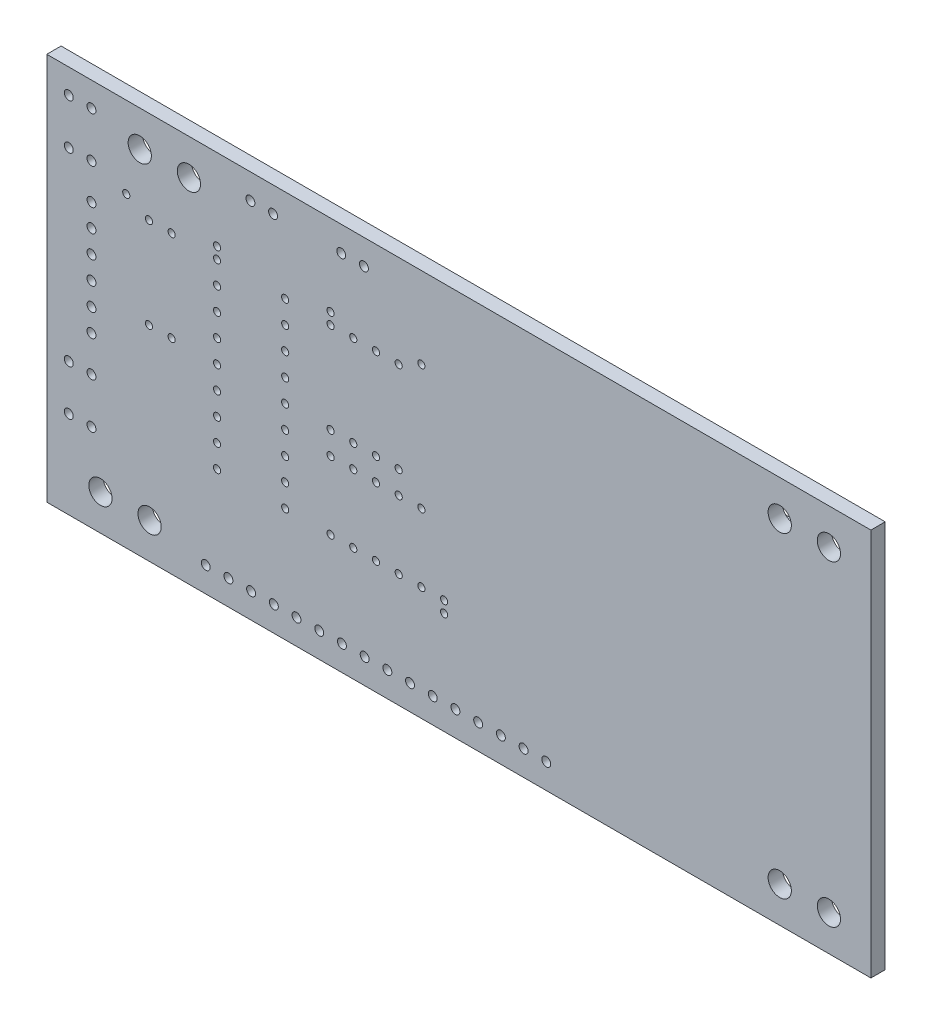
ISO-10303-21;
HEADER;
FILE_DESCRIPTION(('STEP AP214'),'2;1');
FILE_NAME('part.step','',(''),(''),'','','');
FILE_SCHEMA(('AUTOMOTIVE_DESIGN { 1 0 10303 214 1 1 1 1 }'));
ENDSEC;
DATA;
#1=APPLICATION_CONTEXT('core data for automotive mechanical design processes');
#2=APPLICATION_PROTOCOL_DEFINITION('international standard','automotive_design',2000,#1);
#3=PRODUCT_CONTEXT('',#1,'mechanical');
#4=PRODUCT('Part','Part','',(#3));
#5=PRODUCT_RELATED_PRODUCT_CATEGORY('part','',(#4));
#6=PRODUCT_DEFINITION_FORMATION('','',#4);
#7=PRODUCT_DEFINITION_CONTEXT('part definition',#1,'design');
#8=PRODUCT_DEFINITION('design','',#6,#7);
#9=PRODUCT_DEFINITION_SHAPE('','',#8);
#10=(LENGTH_UNIT() NAMED_UNIT(*) SI_UNIT(.MILLI.,.METRE.));
#11=(NAMED_UNIT(*) PLANE_ANGLE_UNIT() SI_UNIT($,.RADIAN.));
#12=(NAMED_UNIT(*) SI_UNIT($,.STERADIAN.) SOLID_ANGLE_UNIT());
#13=UNCERTAINTY_MEASURE_WITH_UNIT(LENGTH_MEASURE(1.E-05),#10,'distance_accuracy_value','');
#14=(GEOMETRIC_REPRESENTATION_CONTEXT(3) GLOBAL_UNCERTAINTY_ASSIGNED_CONTEXT((#13)) GLOBAL_UNIT_ASSIGNED_CONTEXT((#10,
#11,#12)) REPRESENTATION_CONTEXT('',''));
#15=CARTESIAN_POINT('',(0.,0.,0.));
#16=DIRECTION('',(0.,0.,1.));
#17=DIRECTION('',(1.,0.,0.));
#18=AXIS2_PLACEMENT_3D('',#15,#16,#17);
#19=CARTESIAN_POINT('',(0.,43.4,0.));
#20=DIRECTION('',(0.,0.,-1.));
#21=DIRECTION('',(-1.,0.,0.));
#22=AXIS2_PLACEMENT_3D('',#19,#20,#21);
#23=PLANE('',#22);
#24=DIRECTION('',(0.,1.,0.));
#25=VECTOR('',#24,1.);
#26=CARTESIAN_POINT('',(69.4500000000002,32.3,0.));
#27=LINE('',#26,#25);
#28=CARTESIAN_POINT('',(69.4500000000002,26.6119200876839,0.));
#29=VERTEX_POINT('',#28);
#30=CARTESIAN_POINT('',(69.4500000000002,32.3,0.));
#31=VERTEX_POINT('',#30);
#32=EDGE_CURVE('E478',#29,#31,#27,.T.);
#33=ORIENTED_EDGE('',*,*,#32,.F.);
#34=CARTESIAN_POINT('',(72.7500000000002,15.7,0.));
#35=DIRECTION('',(0.,0.,-1.));
#36=DIRECTION('',(-1.,0.,0.));
#37=AXIS2_PLACEMENT_3D('',#34,#35,#36);
#38=CIRCLE('',#37,11.4);
#39=CARTESIAN_POINT('',(76.0500000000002,26.6119200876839,0.));
#40=VERTEX_POINT('',#39);
#41=EDGE_CURVE('E464',#40,#29,#38,.T.);
#42=ORIENTED_EDGE('',*,*,#41,.F.);
#43=DIRECTION('',(0.,-1.,0.));
#44=VECTOR('',#43,1.);
#45=CARTESIAN_POINT('',(76.0500000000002,32.3,0.));
#46=LINE('',#45,#44);
#47=CARTESIAN_POINT('',(76.0500000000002,32.3,0.));
#48=VERTEX_POINT('',#47);
#49=EDGE_CURVE('E483',#48,#40,#46,.T.);
#50=ORIENTED_EDGE('',*,*,#49,.F.);
#51=DIRECTION('',(1.,0.,0.));
#52=VECTOR('',#51,1.);
#53=CARTESIAN_POINT('',(76.0500000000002,32.3,0.));
#54=LINE('',#53,#52);
#55=EDGE_CURVE('E480',#31,#48,#54,.T.);
#56=ORIENTED_EDGE('',*,*,#55,.F.);
#57=EDGE_LOOP('',(#33,#42,#50,#56));
#58=FACE_BOUND('',#57,.T.);
#59=CARTESIAN_POINT('',(41.9100000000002,12.7238027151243,0.));
#60=DIRECTION('',(0.,0.,1.));
#61=DIRECTION('',(1.,0.,0.));
#62=AXIS2_PLACEMENT_3D('',#59,#60,#61);
#63=CIRCLE('',#62,0.400000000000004);
#64=CARTESIAN_POINT('',(42.3100000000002,12.7238027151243,0.));
#65=VERTEX_POINT('',#64);
#66=EDGE_CURVE('E498',#65,#65,#63,.T.);
#67=ORIENTED_EDGE('',*,*,#66,.T.);
#68=EDGE_LOOP('',(#67));
#69=FACE_BOUND('',#68,.T.);
#70=CARTESIAN_POINT('',(41.91,34.3138027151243,0.));
#71=DIRECTION('',(0.,0.,1.));
#72=DIRECTION('',(1.,0.,0.));
#73=AXIS2_PLACEMENT_3D('',#70,#71,#72);
#74=CIRCLE('',#73,0.400000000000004);
#75=CARTESIAN_POINT('',(42.31,34.3138027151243,0.));
#76=VERTEX_POINT('',#75);
#77=EDGE_CURVE('E510',#76,#76,#74,.T.);
#78=ORIENTED_EDGE('',*,*,#77,.T.);
#79=EDGE_LOOP('',(#78));
#80=FACE_BOUND('',#79,.T.);
#81=CARTESIAN_POINT('',(39.3700000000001,20.3438027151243,0.));
#82=DIRECTION('',(0.,0.,1.));
#83=DIRECTION('',(1.,0.,0.));
#84=AXIS2_PLACEMENT_3D('',#81,#82,#83);
#85=CIRCLE('',#84,0.399999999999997);
#86=CARTESIAN_POINT('',(39.7700000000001,20.3438027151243,0.));
#87=VERTEX_POINT('',#86);
#88=EDGE_CURVE('E522',#87,#87,#85,.T.);
#89=ORIENTED_EDGE('',*,*,#88,.T.);
#90=EDGE_LOOP('',(#89));
#91=FACE_BOUND('',#90,.T.);
#92=CARTESIAN_POINT('',(39.37,33.0438027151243,0.));
#93=DIRECTION('',(0.,0.,1.));
#94=DIRECTION('',(1.,0.,0.));
#95=AXIS2_PLACEMENT_3D('',#92,#93,#94);
#96=CIRCLE('',#95,0.400000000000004);
#97=CARTESIAN_POINT('',(39.77,33.0438027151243,0.));
#98=VERTEX_POINT('',#97);
#99=EDGE_CURVE('E534',#98,#98,#96,.T.);
#100=ORIENTED_EDGE('',*,*,#99,.T.);
#101=EDGE_LOOP('',(#100));
#102=FACE_BOUND('',#101,.T.);
#103=CARTESIAN_POINT('',(36.8300000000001,20.3438027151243,0.));
#104=DIRECTION('',(0.,0.,1.));
#105=DIRECTION('',(1.,0.,0.));
#106=AXIS2_PLACEMENT_3D('',#103,#104,#105);
#107=CIRCLE('',#106,0.399999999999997);
#108=CARTESIAN_POINT('',(37.2300000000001,20.3438027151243,0.));
#109=VERTEX_POINT('',#108);
#110=EDGE_CURVE('E546',#109,#109,#107,.T.);
#111=ORIENTED_EDGE('',*,*,#110,.T.);
#112=EDGE_LOOP('',(#111));
#113=FACE_BOUND('',#112,.T.);
#114=CARTESIAN_POINT('',(36.83,33.0438027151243,0.));
#115=DIRECTION('',(0.,0.,1.));
#116=DIRECTION('',(1.,0.,0.));
#117=AXIS2_PLACEMENT_3D('',#114,#115,#116);
#118=CIRCLE('',#117,0.400000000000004);
#119=CARTESIAN_POINT('',(37.23,33.0438027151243,0.));
#120=VERTEX_POINT('',#119);
#121=EDGE_CURVE('E558',#120,#120,#118,.T.);
#122=ORIENTED_EDGE('',*,*,#121,.T.);
#123=EDGE_LOOP('',(#122));
#124=FACE_BOUND('',#123,.T.);
#125=CARTESIAN_POINT('',(34.2900000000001,20.3438027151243,0.));
#126=DIRECTION('',(0.,0.,1.));
#127=DIRECTION('',(1.,0.,0.));
#128=AXIS2_PLACEMENT_3D('',#125,#126,#127);
#129=CIRCLE('',#128,0.399999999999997);
#130=CARTESIAN_POINT('',(34.6900000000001,20.3438027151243,0.));
#131=VERTEX_POINT('',#130);
#132=EDGE_CURVE('E570',#131,#131,#129,.T.);
#133=ORIENTED_EDGE('',*,*,#132,.T.);
#134=EDGE_LOOP('',(#133));
#135=FACE_BOUND('',#134,.T.);
#136=CARTESIAN_POINT('',(34.29,33.0438027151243,0.));
#137=DIRECTION('',(0.,0.,1.));
#138=DIRECTION('',(1.,0.,0.));
#139=AXIS2_PLACEMENT_3D('',#136,#137,#138);
#140=CIRCLE('',#139,0.400000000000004);
#141=CARTESIAN_POINT('',(34.69,33.0438027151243,0.));
#142=VERTEX_POINT('',#141);
#143=EDGE_CURVE('E582',#142,#142,#140,.T.);
#144=ORIENTED_EDGE('',*,*,#143,.T.);
#145=EDGE_LOOP('',(#144));
#146=FACE_BOUND('',#145,.T.);
#147=CARTESIAN_POINT('',(31.7500000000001,20.3438027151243,0.));
#148=DIRECTION('',(0.,0.,1.));
#149=DIRECTION('',(1.,0.,0.));
#150=AXIS2_PLACEMENT_3D('',#147,#148,#149);
#151=CIRCLE('',#150,0.400000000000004);
#152=CARTESIAN_POINT('',(32.1500000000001,20.3438027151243,0.));
#153=VERTEX_POINT('',#152);
#154=EDGE_CURVE('E594',#153,#153,#151,.T.);
#155=ORIENTED_EDGE('',*,*,#154,.T.);
#156=EDGE_LOOP('',(#155));
#157=FACE_BOUND('',#156,.T.);
#158=CARTESIAN_POINT('',(31.75,33.0438027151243,0.));
#159=DIRECTION('',(0.,0.,1.));
#160=DIRECTION('',(1.,0.,0.));
#161=AXIS2_PLACEMENT_3D('',#158,#159,#160);
#162=CIRCLE('',#161,0.400000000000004);
#163=CARTESIAN_POINT('',(32.15,33.0438027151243,0.));
#164=VERTEX_POINT('',#163);
#165=EDGE_CURVE('E606',#164,#164,#162,.T.);
#166=ORIENTED_EDGE('',*,*,#165,.T.);
#167=EDGE_LOOP('',(#166));
#168=FACE_BOUND('',#167,.T.);
#169=CARTESIAN_POINT('',(26.6700000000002,12.7238027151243,0.));
#170=DIRECTION('',(0.,0.,1.));
#171=DIRECTION('',(1.,0.,0.));
#172=AXIS2_PLACEMENT_3D('',#169,#170,#171);
#173=CIRCLE('',#172,0.399999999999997);
#174=CARTESIAN_POINT('',(27.0700000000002,12.7238027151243,0.));
#175=VERTEX_POINT('',#174);
#176=EDGE_CURVE('E618',#175,#175,#173,.T.);
#177=ORIENTED_EDGE('',*,*,#176,.T.);
#178=EDGE_LOOP('',(#177));
#179=FACE_BOUND('',#178,.T.);
#180=CARTESIAN_POINT('',(26.6700000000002,17.8038027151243,0.));
#181=DIRECTION('',(0.,0.,1.));
#182=DIRECTION('',(1.,0.,0.));
#183=AXIS2_PLACEMENT_3D('',#180,#181,#182);
#184=CIRCLE('',#183,0.400000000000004);
#185=CARTESIAN_POINT('',(27.0700000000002,17.8038027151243,0.));
#186=VERTEX_POINT('',#185);
#187=EDGE_CURVE('E630',#186,#186,#184,.T.);
#188=ORIENTED_EDGE('',*,*,#187,.T.);
#189=EDGE_LOOP('',(#188));
#190=FACE_BOUND('',#189,.T.);
#191=CARTESIAN_POINT('',(26.6700000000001,22.8838027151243,0.));
#192=DIRECTION('',(0.,0.,1.));
#193=DIRECTION('',(1.,0.,0.));
#194=AXIS2_PLACEMENT_3D('',#191,#192,#193);
#195=CIRCLE('',#194,0.399999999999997);
#196=CARTESIAN_POINT('',(27.0700000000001,22.8838027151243,0.));
#197=VERTEX_POINT('',#196);
#198=EDGE_CURVE('E642',#197,#197,#195,.T.);
#199=ORIENTED_EDGE('',*,*,#198,.T.);
#200=EDGE_LOOP('',(#199));
#201=FACE_BOUND('',#200,.T.);
#202=CARTESIAN_POINT('',(26.6700000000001,27.9638027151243,0.));
#203=DIRECTION('',(0.,0.,1.));
#204=DIRECTION('',(1.,0.,0.));
#205=AXIS2_PLACEMENT_3D('',#202,#203,#204);
#206=CIRCLE('',#205,0.399999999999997);
#207=CARTESIAN_POINT('',(27.0700000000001,27.9638027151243,0.));
#208=VERTEX_POINT('',#207);
#209=EDGE_CURVE('E654',#208,#208,#206,.T.);
#210=ORIENTED_EDGE('',*,*,#209,.T.);
#211=EDGE_LOOP('',(#210));
#212=FACE_BOUND('',#211,.T.);
#213=CARTESIAN_POINT('',(26.67,33.0438027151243,0.));
#214=DIRECTION('',(0.,0.,1.));
#215=DIRECTION('',(1.,0.,0.));
#216=AXIS2_PLACEMENT_3D('',#213,#214,#215);
#217=CIRCLE('',#216,0.400000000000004);
#218=CARTESIAN_POINT('',(27.07,33.0438027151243,0.));
#219=VERTEX_POINT('',#218);
#220=EDGE_CURVE('E666',#219,#219,#217,.T.);
#221=ORIENTED_EDGE('',*,*,#220,.T.);
#222=EDGE_LOOP('',(#221));
#223=FACE_BOUND('',#222,.T.);
#224=CARTESIAN_POINT('',(5.00000000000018,29.0438027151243,0.));
#225=DIRECTION('',(0.,0.,1.));
#226=DIRECTION('',(1.,0.,0.));
#227=AXIS2_PLACEMENT_3D('',#224,#225,#226);
#228=CIRCLE('',#227,0.500000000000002);
#229=CARTESIAN_POINT('',(5.50000000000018,29.0438027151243,0.));
#230=VERTEX_POINT('',#229);
#231=EDGE_CURVE('E678',#230,#230,#228,.T.);
#232=ORIENTED_EDGE('',*,*,#231,.T.);
#233=EDGE_LOOP('',(#232));
#234=FACE_BOUND('',#233,.T.);
#235=CARTESIAN_POINT('',(5.00000000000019,23.9638027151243,0.));
#236=DIRECTION('',(0.,0.,1.));
#237=DIRECTION('',(1.,0.,0.));
#238=AXIS2_PLACEMENT_3D('',#235,#236,#237);
#239=CIRCLE('',#238,0.500000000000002);
#240=CARTESIAN_POINT('',(5.5000000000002,23.9638027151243,0.));
#241=VERTEX_POINT('',#240);
#242=EDGE_CURVE('E690',#241,#241,#239,.T.);
#243=ORIENTED_EDGE('',*,*,#242,.T.);
#244=EDGE_LOOP('',(#243));
#245=FACE_BOUND('',#244,.T.);
#246=CARTESIAN_POINT('',(44.4500000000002,11.4538027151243,0.));
#247=DIRECTION('',(0.,0.,1.));
#248=DIRECTION('',(1.,0.,0.));
#249=AXIS2_PLACEMENT_3D('',#246,#247,#248);
#250=CIRCLE('',#249,0.400000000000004);
#251=CARTESIAN_POINT('',(44.8500000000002,11.4538027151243,0.));
#252=VERTEX_POINT('',#251);
#253=EDGE_CURVE('E702',#252,#252,#250,.T.);
#254=ORIENTED_EDGE('',*,*,#253,.T.);
#255=EDGE_LOOP('',(#254));
#256=FACE_BOUND('',#255,.T.);
#257=CARTESIAN_POINT('',(19.0500000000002,15.2638027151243,0.));
#258=DIRECTION('',(0.,0.,1.));
#259=DIRECTION('',(1.,0.,0.));
#260=AXIS2_PLACEMENT_3D('',#257,#258,#259);
#261=CIRCLE('',#260,0.400000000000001);
#262=CARTESIAN_POINT('',(19.4500000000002,15.2638027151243,0.));
#263=VERTEX_POINT('',#262);
#264=EDGE_CURVE('E714',#263,#263,#261,.T.);
#265=ORIENTED_EDGE('',*,*,#264,.T.);
#266=EDGE_LOOP('',(#265));
#267=FACE_BOUND('',#266,.T.);
#268=CARTESIAN_POINT('',(19.0500000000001,20.3438027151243,0.));
#269=DIRECTION('',(0.,0.,1.));
#270=DIRECTION('',(1.,0.,0.));
#271=AXIS2_PLACEMENT_3D('',#268,#269,#270);
#272=CIRCLE('',#271,0.400000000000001);
#273=CARTESIAN_POINT('',(19.4500000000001,20.3438027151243,0.));
#274=VERTEX_POINT('',#273);
#275=EDGE_CURVE('E726',#274,#274,#272,.T.);
#276=ORIENTED_EDGE('',*,*,#275,.T.);
#277=EDGE_LOOP('',(#276));
#278=FACE_BOUND('',#277,.T.);
#279=CARTESIAN_POINT('',(19.0500000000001,25.4238027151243,0.));
#280=DIRECTION('',(0.,0.,1.));
#281=DIRECTION('',(1.,0.,0.));
#282=AXIS2_PLACEMENT_3D('',#279,#280,#281);
#283=CIRCLE('',#282,0.400000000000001);
#284=CARTESIAN_POINT('',(19.4500000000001,25.4238027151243,0.));
#285=VERTEX_POINT('',#284);
#286=EDGE_CURVE('E738',#285,#285,#283,.T.);
#287=ORIENTED_EDGE('',*,*,#286,.T.);
#288=EDGE_LOOP('',(#287));
#289=FACE_BOUND('',#288,.T.);
#290=CARTESIAN_POINT('',(19.05,30.5038027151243,0.));
#291=DIRECTION('',(0.,0.,1.));
#292=DIRECTION('',(1.,0.,0.));
#293=AXIS2_PLACEMENT_3D('',#290,#291,#292);
#294=CIRCLE('',#293,0.400000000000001);
#295=CARTESIAN_POINT('',(19.45,30.5038027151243,0.));
#296=VERTEX_POINT('',#295);
#297=EDGE_CURVE('E750',#296,#296,#294,.T.);
#298=ORIENTED_EDGE('',*,*,#297,.T.);
#299=EDGE_LOOP('',(#298));
#300=FACE_BOUND('',#299,.T.);
#301=CARTESIAN_POINT('',(19.05,33.0438027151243,0.));
#302=DIRECTION('',(0.,0.,1.));
#303=DIRECTION('',(1.,0.,0.));
#304=AXIS2_PLACEMENT_3D('',#301,#302,#303);
#305=CIRCLE('',#304,0.400000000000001);
#306=CARTESIAN_POINT('',(19.45,33.0438027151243,0.));
#307=VERTEX_POINT('',#306);
#308=EDGE_CURVE('E762',#307,#307,#305,.T.);
#309=ORIENTED_EDGE('',*,*,#308,.T.);
#310=EDGE_LOOP('',(#309));
#311=FACE_BOUND('',#310,.T.);
#312=CARTESIAN_POINT('',(55.88,2.8,0.));
#313=DIRECTION('',(0.,0.,1.));
#314=DIRECTION('',(1.,0.,0.));
#315=AXIS2_PLACEMENT_3D('',#312,#313,#314);
#316=CIRCLE('',#315,0.499999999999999);
#317=CARTESIAN_POINT('',(56.38,2.8,0.));
#318=VERTEX_POINT('',#317);
#319=EDGE_CURVE('E774',#318,#318,#316,.T.);
#320=ORIENTED_EDGE('',*,*,#319,.T.);
#321=EDGE_LOOP('',(#320));
#322=FACE_BOUND('',#321,.T.);
#323=CARTESIAN_POINT('',(50.8,2.8,0.));
#324=DIRECTION('',(0.,0.,1.));
#325=DIRECTION('',(1.,0.,0.));
#326=AXIS2_PLACEMENT_3D('',#323,#324,#325);
#327=CIRCLE('',#326,0.499999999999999);
#328=CARTESIAN_POINT('',(51.3,2.8,0.));
#329=VERTEX_POINT('',#328);
#330=EDGE_CURVE('E786',#329,#329,#327,.T.);
#331=ORIENTED_EDGE('',*,*,#330,.T.);
#332=EDGE_LOOP('',(#331));
#333=FACE_BOUND('',#332,.T.);
#334=CARTESIAN_POINT('',(45.72,2.8,0.));
#335=DIRECTION('',(0.,0.,1.));
#336=DIRECTION('',(1.,0.,0.));
#337=AXIS2_PLACEMENT_3D('',#334,#335,#336);
#338=CIRCLE('',#337,0.499999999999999);
#339=CARTESIAN_POINT('',(46.22,2.8,0.));
#340=VERTEX_POINT('',#339);
#341=EDGE_CURVE('E798',#340,#340,#338,.T.);
#342=ORIENTED_EDGE('',*,*,#341,.T.);
#343=EDGE_LOOP('',(#342));
#344=FACE_BOUND('',#343,.T.);
#345=CARTESIAN_POINT('',(40.64,2.8,0.));
#346=DIRECTION('',(0.,0.,1.));
#347=DIRECTION('',(1.,0.,0.));
#348=AXIS2_PLACEMENT_3D('',#345,#346,#347);
#349=CIRCLE('',#348,0.499999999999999);
#350=CARTESIAN_POINT('',(41.14,2.8,0.));
#351=VERTEX_POINT('',#350);
#352=EDGE_CURVE('E810',#351,#351,#349,.T.);
#353=ORIENTED_EDGE('',*,*,#352,.T.);
#354=EDGE_LOOP('',(#353));
#355=FACE_BOUND('',#354,.T.);
#356=CARTESIAN_POINT('',(35.56,2.8,0.));
#357=DIRECTION('',(0.,0.,1.));
#358=DIRECTION('',(1.,0.,0.));
#359=AXIS2_PLACEMENT_3D('',#356,#357,#358);
#360=CIRCLE('',#359,0.499999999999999);
#361=CARTESIAN_POINT('',(36.06,2.8,0.));
#362=VERTEX_POINT('',#361);
#363=EDGE_CURVE('E822',#362,#362,#360,.T.);
#364=ORIENTED_EDGE('',*,*,#363,.T.);
#365=EDGE_LOOP('',(#364));
#366=FACE_BOUND('',#365,.T.);
#367=CARTESIAN_POINT('',(30.48,2.8,0.));
#368=DIRECTION('',(0.,0.,1.));
#369=DIRECTION('',(1.,0.,0.));
#370=AXIS2_PLACEMENT_3D('',#367,#368,#369);
#371=CIRCLE('',#370,0.499999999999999);
#372=CARTESIAN_POINT('',(30.98,2.8,0.));
#373=VERTEX_POINT('',#372);
#374=EDGE_CURVE('E834',#373,#373,#371,.T.);
#375=ORIENTED_EDGE('',*,*,#374,.T.);
#376=EDGE_LOOP('',(#375));
#377=FACE_BOUND('',#376,.T.);
#378=CARTESIAN_POINT('',(25.4,2.8,0.));
#379=DIRECTION('',(0.,0.,1.));
#380=DIRECTION('',(1.,0.,0.));
#381=AXIS2_PLACEMENT_3D('',#378,#379,#380);
#382=CIRCLE('',#381,0.499999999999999);
#383=CARTESIAN_POINT('',(25.9,2.8,0.));
#384=VERTEX_POINT('',#383);
#385=EDGE_CURVE('E846',#384,#384,#382,.T.);
#386=ORIENTED_EDGE('',*,*,#385,.T.);
#387=EDGE_LOOP('',(#386));
#388=FACE_BOUND('',#387,.T.);
#389=CARTESIAN_POINT('',(20.32,2.8,0.));
#390=DIRECTION('',(0.,0.,1.));
#391=DIRECTION('',(1.,0.,0.));
#392=AXIS2_PLACEMENT_3D('',#389,#390,#391);
#393=CIRCLE('',#392,0.499999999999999);
#394=CARTESIAN_POINT('',(20.82,2.8,0.));
#395=VERTEX_POINT('',#394);
#396=EDGE_CURVE('E858',#395,#395,#393,.T.);
#397=ORIENTED_EDGE('',*,*,#396,.T.);
#398=EDGE_LOOP('',(#397));
#399=FACE_BOUND('',#398,.T.);
#400=CARTESIAN_POINT('',(35.48,40.6,0.));
#401=DIRECTION('',(0.,0.,1.));
#402=DIRECTION('',(1.,0.,0.));
#403=AXIS2_PLACEMENT_3D('',#400,#401,#402);
#404=CIRCLE('',#403,0.499999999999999);
#405=CARTESIAN_POINT('',(35.98,40.6,0.));
#406=VERTEX_POINT('',#405);
#407=EDGE_CURVE('E870',#406,#406,#404,.T.);
#408=ORIENTED_EDGE('',*,*,#407,.T.);
#409=EDGE_LOOP('',(#408));
#410=FACE_BOUND('',#409,.T.);
#411=CARTESIAN_POINT('',(25.32,40.6,0.));
#412=DIRECTION('',(0.,0.,1.));
#413=DIRECTION('',(1.,0.,0.));
#414=AXIS2_PLACEMENT_3D('',#411,#412,#413);
#415=CIRCLE('',#414,0.499999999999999);
#416=CARTESIAN_POINT('',(25.82,40.6,0.));
#417=VERTEX_POINT('',#416);
#418=EDGE_CURVE('E882',#417,#417,#415,.T.);
#419=ORIENTED_EDGE('',*,*,#418,.T.);
#420=EDGE_LOOP('',(#419));
#421=FACE_BOUND('',#420,.T.);
#422=CARTESIAN_POINT('',(2.46000000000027,14.8838027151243,0.));
#423=DIRECTION('',(0.,0.,1.));
#424=DIRECTION('',(1.,0.,0.));
#425=AXIS2_PLACEMENT_3D('',#422,#423,#424);
#426=CIRCLE('',#425,0.500000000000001);
#427=CARTESIAN_POINT('',(2.96000000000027,14.8838027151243,0.));
#428=VERTEX_POINT('',#427);
#429=EDGE_CURVE('E894',#428,#428,#426,.T.);
#430=ORIENTED_EDGE('',*,*,#429,.T.);
#431=EDGE_LOOP('',(#430));
#432=FACE_BOUND('',#431,.T.);
#433=CARTESIAN_POINT('',(2.46,40.6638027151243,0.));
#434=DIRECTION('',(0.,0.,1.));
#435=DIRECTION('',(1.,0.,0.));
#436=AXIS2_PLACEMENT_3D('',#433,#434,#435);
#437=CIRCLE('',#436,0.500000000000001);
#438=CARTESIAN_POINT('',(2.96,40.6638027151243,0.));
#439=VERTEX_POINT('',#438);
#440=EDGE_CURVE('E906',#439,#439,#437,.T.);
#441=ORIENTED_EDGE('',*,*,#440,.T.);
#442=EDGE_LOOP('',(#441));
#443=FACE_BOUND('',#442,.T.);
#444=CARTESIAN_POINT('',(22.78,40.6,0.));
#445=DIRECTION('',(0.,0.,1.));
#446=DIRECTION('',(1.,0.,0.));
#447=AXIS2_PLACEMENT_3D('',#444,#445,#446);
#448=CIRCLE('',#447,0.499999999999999);
#449=CARTESIAN_POINT('',(23.28,40.6,0.));
#450=VERTEX_POINT('',#449);
#451=EDGE_CURVE('E918',#450,#450,#448,.T.);
#452=ORIENTED_EDGE('',*,*,#451,.T.);
#453=EDGE_LOOP('',(#452));
#454=FACE_BOUND('',#453,.T.);
#455=CARTESIAN_POINT('',(5.00000000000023,18.8838027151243,0.));
#456=DIRECTION('',(0.,0.,1.));
#457=DIRECTION('',(1.,0.,0.));
#458=AXIS2_PLACEMENT_3D('',#455,#456,#457);
#459=CIRCLE('',#458,0.500000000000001);
#460=CARTESIAN_POINT('',(5.50000000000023,18.8838027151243,0.));
#461=VERTEX_POINT('',#460);
#462=EDGE_CURVE('E930',#461,#461,#459,.T.);
#463=ORIENTED_EDGE('',*,*,#462,.T.);
#464=EDGE_LOOP('',(#463));
#465=FACE_BOUND('',#464,.T.);
#466=CARTESIAN_POINT('',(13.9700000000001,22.8838027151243,0.));
#467=DIRECTION('',(0.,0.,1.));
#468=DIRECTION('',(1.,0.,0.));
#469=AXIS2_PLACEMENT_3D('',#466,#467,#468);
#470=CIRCLE('',#469,0.400000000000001);
#471=CARTESIAN_POINT('',(14.3700000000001,22.8838027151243,0.));
#472=VERTEX_POINT('',#471);
#473=EDGE_CURVE('E942',#472,#472,#470,.T.);
#474=ORIENTED_EDGE('',*,*,#473,.T.);
#475=EDGE_LOOP('',(#474));
#476=FACE_BOUND('',#475,.T.);
#477=CARTESIAN_POINT('',(8.89,34.3138027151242,0.));
#478=DIRECTION('',(0.,0.,1.));
#479=DIRECTION('',(1.,0.,0.));
#480=AXIS2_PLACEMENT_3D('',#477,#478,#479);
#481=CIRCLE('',#480,0.400000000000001);
#482=CARTESIAN_POINT('',(9.29,34.3138027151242,0.));
#483=VERTEX_POINT('',#482);
#484=EDGE_CURVE('E954',#483,#483,#481,.T.);
#485=ORIENTED_EDGE('',*,*,#484,.T.);
#486=EDGE_LOOP('',(#485));
#487=FACE_BOUND('',#486,.T.);
#488=CARTESIAN_POINT('',(5.,40.6638027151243,0.));
#489=DIRECTION('',(0.,0.,1.));
#490=DIRECTION('',(1.,0.,0.));
#491=AXIS2_PLACEMENT_3D('',#488,#489,#490);
#492=CIRCLE('',#491,0.500000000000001);
#493=CARTESIAN_POINT('',(5.5,40.6638027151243,0.));
#494=VERTEX_POINT('',#493);
#495=EDGE_CURVE('E966',#494,#494,#492,.T.);
#496=ORIENTED_EDGE('',*,*,#495,.T.);
#497=EDGE_LOOP('',(#496));
#498=FACE_BOUND('',#497,.T.);
#499=CARTESIAN_POINT('',(82.,39.4,0.));
#500=DIRECTION('',(0.,0.,1.));
#501=DIRECTION('',(-1.,0.,0.));
#502=AXIS2_PLACEMENT_3D('',#499,#500,#501);
#503=CIRCLE('',#502,1.3);
#504=CARTESIAN_POINT('',(80.7,39.4,0.));
#505=VERTEX_POINT('',#504);
#506=EDGE_CURVE('E978',#505,#505,#503,.T.);
#507=ORIENTED_EDGE('',*,*,#506,.T.);
#508=EDGE_LOOP('',(#507));
#509=FACE_BOUND('',#508,.T.);
#510=CARTESIAN_POINT('',(10.4,39.3999999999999,0.));
#511=DIRECTION('',(0.,0.,1.));
#512=DIRECTION('',(1.,0.,0.));
#513=AXIS2_PLACEMENT_3D('',#510,#511,#512);
#514=CIRCLE('',#513,1.3);
#515=CARTESIAN_POINT('',(11.7,39.3999999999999,0.));
#516=VERTEX_POINT('',#515);
#517=EDGE_CURVE('E990',#516,#516,#514,.T.);
#518=ORIENTED_EDGE('',*,*,#517,.T.);
#519=EDGE_LOOP('',(#518));
#520=FACE_BOUND('',#519,.T.);
#521=CARTESIAN_POINT('',(82.,4.,0.));
#522=DIRECTION('',(0.,0.,1.));
#523=DIRECTION('',(1.,0.,0.));
#524=AXIS2_PLACEMENT_3D('',#521,#522,#523);
#525=CIRCLE('',#524,1.29999999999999);
#526=CARTESIAN_POINT('',(83.3,4.,0.));
#527=VERTEX_POINT('',#526);
#528=EDGE_CURVE('E1002',#527,#527,#525,.T.);
#529=ORIENTED_EDGE('',*,*,#528,.T.);
#530=EDGE_LOOP('',(#529));
#531=FACE_BOUND('',#530,.T.);
#532=CARTESIAN_POINT('',(6.,4.,0.));
#533=DIRECTION('',(0.,0.,1.));
#534=DIRECTION('',(1.,0.,0.));
#535=AXIS2_PLACEMENT_3D('',#532,#533,#534);
#536=CIRCLE('',#535,1.3);
#537=CARTESIAN_POINT('',(7.3,4.,0.));
#538=VERTEX_POINT('',#537);
#539=EDGE_CURVE('E1014',#538,#538,#536,.T.);
#540=ORIENTED_EDGE('',*,*,#539,.T.);
#541=EDGE_LOOP('',(#540));
#542=FACE_BOUND('',#541,.T.);
#543=DIRECTION('',(0.,-1.,0.));
#544=VECTOR('',#543,1.);
#545=CARTESIAN_POINT('',(0.,0.,0.));
#546=LINE('',#545,#544);
#547=CARTESIAN_POINT('',(0.,43.4,0.));
#548=VERTEX_POINT('',#547);
#549=CARTESIAN_POINT('',(0.,0.,0.));
#550=VERTEX_POINT('',#549);
#551=EDGE_CURVE('E1020',#548,#550,#546,.T.);
#552=ORIENTED_EDGE('',*,*,#551,.F.);
#553=DIRECTION('',(-1.,0.,0.));
#554=VECTOR('',#553,1.);
#555=CARTESIAN_POINT('',(0.,43.4,0.));
#556=LINE('',#555,#554);
#557=CARTESIAN_POINT('',(92.2,43.4,0.));
#558=VERTEX_POINT('',#557);
#559=EDGE_CURVE('E1027',#558,#548,#556,.T.);
#560=ORIENTED_EDGE('',*,*,#559,.F.);
#561=DIRECTION('',(0.,1.,0.));
#562=VECTOR('',#561,1.);
#563=CARTESIAN_POINT('',(92.2,0.,0.));
#564=LINE('',#563,#562);
#565=CARTESIAN_POINT('',(92.2,0.,0.));
#566=VERTEX_POINT('',#565);
#567=EDGE_CURVE('E1038',#566,#558,#564,.T.);
#568=ORIENTED_EDGE('',*,*,#567,.F.);
#569=DIRECTION('',(1.,0.,0.));
#570=VECTOR('',#569,1.);
#571=CARTESIAN_POINT('',(0.,0.,0.));
#572=LINE('',#571,#570);
#573=EDGE_CURVE('E1036',#550,#566,#572,.T.);
#574=ORIENTED_EDGE('',*,*,#573,.F.);
#575=EDGE_LOOP('',(#552,#560,#568,#574));
#576=FACE_BOUND('',#575,.T.);
#577=CARTESIAN_POINT('',(11.5,4.,0.));
#578=DIRECTION('',(0.,0.,1.));
#579=DIRECTION('',(1.,0.,0.));
#580=AXIS2_PLACEMENT_3D('',#577,#578,#579);
#581=CIRCLE('',#580,1.3);
#582=CARTESIAN_POINT('',(12.8,4.,0.));
#583=VERTEX_POINT('',#582);
#584=EDGE_CURVE('E1008',#583,#583,#581,.T.);
#585=ORIENTED_EDGE('',*,*,#584,.T.);
#586=EDGE_LOOP('',(#585));
#587=FACE_BOUND('',#586,.T.);
#588=CARTESIAN_POINT('',(87.5,4.,0.));
#589=DIRECTION('',(0.,0.,1.));
#590=DIRECTION('',(1.,0.,0.));
#591=AXIS2_PLACEMENT_3D('',#588,#589,#590);
#592=CIRCLE('',#591,1.29999999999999);
#593=CARTESIAN_POINT('',(88.8,4.,0.));
#594=VERTEX_POINT('',#593);
#595=EDGE_CURVE('E996',#594,#594,#592,.T.);
#596=ORIENTED_EDGE('',*,*,#595,.T.);
#597=EDGE_LOOP('',(#596));
#598=FACE_BOUND('',#597,.T.);
#599=CARTESIAN_POINT('',(15.9,39.3999999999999,0.));
#600=DIRECTION('',(0.,0.,1.));
#601=DIRECTION('',(1.,0.,0.));
#602=AXIS2_PLACEMENT_3D('',#599,#600,#601);
#603=CIRCLE('',#602,1.3);
#604=CARTESIAN_POINT('',(17.2,39.3999999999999,0.));
#605=VERTEX_POINT('',#604);
#606=EDGE_CURVE('E984',#605,#605,#603,.T.);
#607=ORIENTED_EDGE('',*,*,#606,.T.);
#608=EDGE_LOOP('',(#607));
#609=FACE_BOUND('',#608,.T.);
#610=CARTESIAN_POINT('',(87.5,39.4,0.));
#611=DIRECTION('',(0.,0.,1.));
#612=DIRECTION('',(-1.,0.,0.));
#613=AXIS2_PLACEMENT_3D('',#610,#611,#612);
#614=CIRCLE('',#613,1.3);
#615=CARTESIAN_POINT('',(86.2,39.4,0.));
#616=VERTEX_POINT('',#615);
#617=EDGE_CURVE('E972',#616,#616,#614,.T.);
#618=ORIENTED_EDGE('',*,*,#617,.T.);
#619=EDGE_LOOP('',(#618));
#620=FACE_BOUND('',#619,.T.);
#621=CARTESIAN_POINT('',(5.00000000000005,35.5838027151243,0.));
#622=DIRECTION('',(0.,0.,1.));
#623=DIRECTION('',(1.,0.,0.));
#624=AXIS2_PLACEMENT_3D('',#621,#622,#623);
#625=CIRCLE('',#624,0.500000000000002);
#626=CARTESIAN_POINT('',(5.50000000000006,35.5838027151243,0.));
#627=VERTEX_POINT('',#626);
#628=EDGE_CURVE('E960',#627,#627,#625,.T.);
#629=ORIENTED_EDGE('',*,*,#628,.T.);
#630=EDGE_LOOP('',(#629));
#631=FACE_BOUND('',#630,.T.);
#632=CARTESIAN_POINT('',(13.97,33.0438027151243,0.));
#633=DIRECTION('',(0.,0.,1.));
#634=DIRECTION('',(1.,0.,0.));
#635=AXIS2_PLACEMENT_3D('',#632,#633,#634);
#636=CIRCLE('',#635,0.400000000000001);
#637=CARTESIAN_POINT('',(14.37,33.0438027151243,0.));
#638=VERTEX_POINT('',#637);
#639=EDGE_CURVE('E948',#638,#638,#636,.T.);
#640=ORIENTED_EDGE('',*,*,#639,.T.);
#641=EDGE_LOOP('',(#640));
#642=FACE_BOUND('',#641,.T.);
#643=CARTESIAN_POINT('',(5.0000000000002,21.4238027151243,0.));
#644=DIRECTION('',(0.,0.,1.));
#645=DIRECTION('',(1.,0.,0.));
#646=AXIS2_PLACEMENT_3D('',#643,#644,#645);
#647=CIRCLE('',#646,0.500000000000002);
#648=CARTESIAN_POINT('',(5.5000000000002,21.4238027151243,0.));
#649=VERTEX_POINT('',#648);
#650=EDGE_CURVE('E936',#649,#649,#647,.T.);
#651=ORIENTED_EDGE('',*,*,#650,.T.);
#652=EDGE_LOOP('',(#651));
#653=FACE_BOUND('',#652,.T.);
#654=CARTESIAN_POINT('',(5.00000000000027,14.8838027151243,0.));
#655=DIRECTION('',(0.,0.,1.));
#656=DIRECTION('',(1.,0.,0.));
#657=AXIS2_PLACEMENT_3D('',#654,#655,#656);
#658=CIRCLE('',#657,0.500000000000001);
#659=CARTESIAN_POINT('',(5.50000000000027,14.8838027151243,0.));
#660=VERTEX_POINT('',#659);
#661=EDGE_CURVE('E924',#660,#660,#658,.T.);
#662=ORIENTED_EDGE('',*,*,#661,.T.);
#663=EDGE_LOOP('',(#662));
#664=FACE_BOUND('',#663,.T.);
#665=CARTESIAN_POINT('',(5.00000000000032,9.80380271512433,0.));
#666=DIRECTION('',(0.,0.,1.));
#667=DIRECTION('',(1.,0.,0.));
#668=AXIS2_PLACEMENT_3D('',#665,#666,#667);
#669=CIRCLE('',#668,0.500000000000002);
#670=CARTESIAN_POINT('',(5.50000000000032,9.80380271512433,0.));
#671=VERTEX_POINT('',#670);
#672=EDGE_CURVE('E912',#671,#671,#669,.T.);
#673=ORIENTED_EDGE('',*,*,#672,.T.);
#674=EDGE_LOOP('',(#673));
#675=FACE_BOUND('',#674,.T.);
#676=CARTESIAN_POINT('',(2.46000000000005,35.5838027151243,0.));
#677=DIRECTION('',(0.,0.,1.));
#678=DIRECTION('',(1.,0.,0.));
#679=AXIS2_PLACEMENT_3D('',#676,#677,#678);
#680=CIRCLE('',#679,0.500000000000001);
#681=CARTESIAN_POINT('',(2.96000000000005,35.5838027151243,0.));
#682=VERTEX_POINT('',#681);
#683=EDGE_CURVE('E900',#682,#682,#680,.T.);
#684=ORIENTED_EDGE('',*,*,#683,.T.);
#685=EDGE_LOOP('',(#684));
#686=FACE_BOUND('',#685,.T.);
#687=CARTESIAN_POINT('',(2.46000000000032,9.80380271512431,0.));
#688=DIRECTION('',(0.,0.,1.));
#689=DIRECTION('',(1.,0.,0.));
#690=AXIS2_PLACEMENT_3D('',#687,#688,#689);
#691=CIRCLE('',#690,0.500000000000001);
#692=CARTESIAN_POINT('',(2.96000000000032,9.80380271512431,0.));
#693=VERTEX_POINT('',#692);
#694=EDGE_CURVE('E888',#693,#693,#691,.T.);
#695=ORIENTED_EDGE('',*,*,#694,.T.);
#696=EDGE_LOOP('',(#695));
#697=FACE_BOUND('',#696,.T.);
#698=CARTESIAN_POINT('',(32.94,40.6,0.));
#699=DIRECTION('',(0.,0.,1.));
#700=DIRECTION('',(1.,0.,0.));
#701=AXIS2_PLACEMENT_3D('',#698,#699,#700);
#702=CIRCLE('',#701,0.499999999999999);
#703=CARTESIAN_POINT('',(33.44,40.6,0.));
#704=VERTEX_POINT('',#703);
#705=EDGE_CURVE('E876',#704,#704,#702,.T.);
#706=ORIENTED_EDGE('',*,*,#705,.T.);
#707=EDGE_LOOP('',(#706));
#708=FACE_BOUND('',#707,.T.);
#709=CARTESIAN_POINT('',(17.78,2.8,0.));
#710=DIRECTION('',(0.,0.,1.));
#711=DIRECTION('',(1.,0.,0.));
#712=AXIS2_PLACEMENT_3D('',#709,#710,#711);
#713=CIRCLE('',#712,0.499999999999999);
#714=CARTESIAN_POINT('',(18.28,2.8,0.));
#715=VERTEX_POINT('',#714);
#716=EDGE_CURVE('E864',#715,#715,#713,.T.);
#717=ORIENTED_EDGE('',*,*,#716,.T.);
#718=EDGE_LOOP('',(#717));
#719=FACE_BOUND('',#718,.T.);
#720=CARTESIAN_POINT('',(22.86,2.8,0.));
#721=DIRECTION('',(0.,0.,1.));
#722=DIRECTION('',(1.,0.,0.));
#723=AXIS2_PLACEMENT_3D('',#720,#721,#722);
#724=CIRCLE('',#723,0.499999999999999);
#725=CARTESIAN_POINT('',(23.36,2.8,0.));
#726=VERTEX_POINT('',#725);
#727=EDGE_CURVE('E852',#726,#726,#724,.T.);
#728=ORIENTED_EDGE('',*,*,#727,.T.);
#729=EDGE_LOOP('',(#728));
#730=FACE_BOUND('',#729,.T.);
#731=CARTESIAN_POINT('',(27.94,2.8,0.));
#732=DIRECTION('',(0.,0.,1.));
#733=DIRECTION('',(1.,0.,0.));
#734=AXIS2_PLACEMENT_3D('',#731,#732,#733);
#735=CIRCLE('',#734,0.499999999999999);
#736=CARTESIAN_POINT('',(28.44,2.8,0.));
#737=VERTEX_POINT('',#736);
#738=EDGE_CURVE('E840',#737,#737,#735,.T.);
#739=ORIENTED_EDGE('',*,*,#738,.T.);
#740=EDGE_LOOP('',(#739));
#741=FACE_BOUND('',#740,.T.);
#742=CARTESIAN_POINT('',(33.02,2.8,0.));
#743=DIRECTION('',(0.,0.,1.));
#744=DIRECTION('',(1.,0.,0.));
#745=AXIS2_PLACEMENT_3D('',#742,#743,#744);
#746=CIRCLE('',#745,0.499999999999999);
#747=CARTESIAN_POINT('',(33.52,2.8,0.));
#748=VERTEX_POINT('',#747);
#749=EDGE_CURVE('E828',#748,#748,#746,.T.);
#750=ORIENTED_EDGE('',*,*,#749,.T.);
#751=EDGE_LOOP('',(#750));
#752=FACE_BOUND('',#751,.T.);
#753=CARTESIAN_POINT('',(38.1,2.8,0.));
#754=DIRECTION('',(0.,0.,1.));
#755=DIRECTION('',(1.,0.,0.));
#756=AXIS2_PLACEMENT_3D('',#753,#754,#755);
#757=CIRCLE('',#756,0.499999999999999);
#758=CARTESIAN_POINT('',(38.6,2.8,0.));
#759=VERTEX_POINT('',#758);
#760=EDGE_CURVE('E816',#759,#759,#757,.T.);
#761=ORIENTED_EDGE('',*,*,#760,.T.);
#762=EDGE_LOOP('',(#761));
#763=FACE_BOUND('',#762,.T.);
#764=CARTESIAN_POINT('',(43.18,2.8,0.));
#765=DIRECTION('',(0.,0.,1.));
#766=DIRECTION('',(1.,0.,0.));
#767=AXIS2_PLACEMENT_3D('',#764,#765,#766);
#768=CIRCLE('',#767,0.499999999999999);
#769=CARTESIAN_POINT('',(43.68,2.8,0.));
#770=VERTEX_POINT('',#769);
#771=EDGE_CURVE('E804',#770,#770,#768,.T.);
#772=ORIENTED_EDGE('',*,*,#771,.T.);
#773=EDGE_LOOP('',(#772));
#774=FACE_BOUND('',#773,.T.);
#775=CARTESIAN_POINT('',(48.26,2.8,0.));
#776=DIRECTION('',(0.,0.,1.));
#777=DIRECTION('',(1.,0.,0.));
#778=AXIS2_PLACEMENT_3D('',#775,#776,#777);
#779=CIRCLE('',#778,0.499999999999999);
#780=CARTESIAN_POINT('',(48.76,2.8,0.));
#781=VERTEX_POINT('',#780);
#782=EDGE_CURVE('E792',#781,#781,#779,.T.);
#783=ORIENTED_EDGE('',*,*,#782,.T.);
#784=EDGE_LOOP('',(#783));
#785=FACE_BOUND('',#784,.T.);
#786=CARTESIAN_POINT('',(53.34,2.8,0.));
#787=DIRECTION('',(0.,0.,1.));
#788=DIRECTION('',(1.,0.,0.));
#789=AXIS2_PLACEMENT_3D('',#786,#787,#788);
#790=CIRCLE('',#789,0.499999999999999);
#791=CARTESIAN_POINT('',(53.84,2.8,0.));
#792=VERTEX_POINT('',#791);
#793=EDGE_CURVE('E780',#792,#792,#790,.T.);
#794=ORIENTED_EDGE('',*,*,#793,.T.);
#795=EDGE_LOOP('',(#794));
#796=FACE_BOUND('',#795,.T.);
#797=CARTESIAN_POINT('',(19.05,34.3138027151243,0.));
#798=DIRECTION('',(0.,0.,1.));
#799=DIRECTION('',(1.,0.,0.));
#800=AXIS2_PLACEMENT_3D('',#797,#798,#799);
#801=CIRCLE('',#800,0.400000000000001);
#802=CARTESIAN_POINT('',(19.45,34.3138027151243,0.));
#803=VERTEX_POINT('',#802);
#804=EDGE_CURVE('E768',#803,#803,#801,.T.);
#805=ORIENTED_EDGE('',*,*,#804,.T.);
#806=EDGE_LOOP('',(#805));
#807=FACE_BOUND('',#806,.T.);
#808=CARTESIAN_POINT('',(11.43,33.0438027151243,0.));
#809=DIRECTION('',(0.,0.,1.));
#810=DIRECTION('',(1.,0.,0.));
#811=AXIS2_PLACEMENT_3D('',#808,#809,#810);
#812=CIRCLE('',#811,0.400000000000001);
#813=CARTESIAN_POINT('',(11.83,33.0438027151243,0.));
#814=VERTEX_POINT('',#813);
#815=EDGE_CURVE('E756',#814,#814,#812,.T.);
#816=ORIENTED_EDGE('',*,*,#815,.T.);
#817=EDGE_LOOP('',(#816));
#818=FACE_BOUND('',#817,.T.);
#819=CARTESIAN_POINT('',(19.0500000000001,27.9638027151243,0.));
#820=DIRECTION('',(0.,0.,1.));
#821=DIRECTION('',(1.,0.,0.));
#822=AXIS2_PLACEMENT_3D('',#819,#820,#821);
#823=CIRCLE('',#822,0.400000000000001);
#824=CARTESIAN_POINT('',(19.4500000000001,27.9638027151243,0.));
#825=VERTEX_POINT('',#824);
#826=EDGE_CURVE('E744',#825,#825,#823,.T.);
#827=ORIENTED_EDGE('',*,*,#826,.T.);
#828=EDGE_LOOP('',(#827));
#829=FACE_BOUND('',#828,.T.);
#830=CARTESIAN_POINT('',(19.0500000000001,22.8838027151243,0.));
#831=DIRECTION('',(0.,0.,1.));
#832=DIRECTION('',(1.,0.,0.));
#833=AXIS2_PLACEMENT_3D('',#830,#831,#832);
#834=CIRCLE('',#833,0.400000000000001);
#835=CARTESIAN_POINT('',(19.4500000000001,22.8838027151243,0.));
#836=VERTEX_POINT('',#835);
#837=EDGE_CURVE('E732',#836,#836,#834,.T.);
#838=ORIENTED_EDGE('',*,*,#837,.T.);
#839=EDGE_LOOP('',(#838));
#840=FACE_BOUND('',#839,.T.);
#841=CARTESIAN_POINT('',(19.0500000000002,17.8038027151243,0.));
#842=DIRECTION('',(0.,0.,1.));
#843=DIRECTION('',(1.,0.,0.));
#844=AXIS2_PLACEMENT_3D('',#841,#842,#843);
#845=CIRCLE('',#844,0.400000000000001);
#846=CARTESIAN_POINT('',(19.4500000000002,17.8038027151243,0.));
#847=VERTEX_POINT('',#846);
#848=EDGE_CURVE('E720',#847,#847,#845,.T.);
#849=ORIENTED_EDGE('',*,*,#848,.T.);
#850=EDGE_LOOP('',(#849));
#851=FACE_BOUND('',#850,.T.);
#852=CARTESIAN_POINT('',(19.0500000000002,12.7238027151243,0.));
#853=DIRECTION('',(0.,0.,1.));
#854=DIRECTION('',(1.,0.,0.));
#855=AXIS2_PLACEMENT_3D('',#852,#853,#854);
#856=CIRCLE('',#855,0.400000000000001);
#857=CARTESIAN_POINT('',(19.4500000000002,12.7238027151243,0.));
#858=VERTEX_POINT('',#857);
#859=EDGE_CURVE('E708',#858,#858,#856,.T.);
#860=ORIENTED_EDGE('',*,*,#859,.T.);
#861=EDGE_LOOP('',(#860));
#862=FACE_BOUND('',#861,.T.);
#863=CARTESIAN_POINT('',(11.4300000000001,22.8838027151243,0.));
#864=DIRECTION('',(0.,0.,1.));
#865=DIRECTION('',(1.,0.,0.));
#866=AXIS2_PLACEMENT_3D('',#863,#864,#865);
#867=CIRCLE('',#866,0.400000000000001);
#868=CARTESIAN_POINT('',(11.8300000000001,22.8838027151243,0.));
#869=VERTEX_POINT('',#868);
#870=EDGE_CURVE('E696',#869,#869,#867,.T.);
#871=ORIENTED_EDGE('',*,*,#870,.T.);
#872=EDGE_LOOP('',(#871));
#873=FACE_BOUND('',#872,.T.);
#874=CARTESIAN_POINT('',(5.00000000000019,26.5038027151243,0.));
#875=DIRECTION('',(0.,0.,1.));
#876=DIRECTION('',(1.,0.,0.));
#877=AXIS2_PLACEMENT_3D('',#874,#875,#876);
#878=CIRCLE('',#877,0.500000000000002);
#879=CARTESIAN_POINT('',(5.50000000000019,26.5038027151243,0.));
#880=VERTEX_POINT('',#879);
#881=EDGE_CURVE('E684',#880,#880,#878,.T.);
#882=ORIENTED_EDGE('',*,*,#881,.T.);
#883=EDGE_LOOP('',(#882));
#884=FACE_BOUND('',#883,.T.);
#885=CARTESIAN_POINT('',(5.00000000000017,31.5838027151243,0.));
#886=DIRECTION('',(0.,0.,1.));
#887=DIRECTION('',(1.,0.,0.));
#888=AXIS2_PLACEMENT_3D('',#885,#886,#887);
#889=CIRCLE('',#888,0.500000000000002);
#890=CARTESIAN_POINT('',(5.50000000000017,31.5838027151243,0.));
#891=VERTEX_POINT('',#890);
#892=EDGE_CURVE('E672',#891,#891,#889,.T.);
#893=ORIENTED_EDGE('',*,*,#892,.T.);
#894=EDGE_LOOP('',(#893));
#895=FACE_BOUND('',#894,.T.);
#896=CARTESIAN_POINT('',(26.67,30.5038027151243,0.));
#897=DIRECTION('',(0.,0.,1.));
#898=DIRECTION('',(1.,0.,0.));
#899=AXIS2_PLACEMENT_3D('',#896,#897,#898);
#900=CIRCLE('',#899,0.400000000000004);
#901=CARTESIAN_POINT('',(27.07,30.5038027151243,0.));
#902=VERTEX_POINT('',#901);
#903=EDGE_CURVE('E660',#902,#902,#900,.T.);
#904=ORIENTED_EDGE('',*,*,#903,.T.);
#905=EDGE_LOOP('',(#904));
#906=FACE_BOUND('',#905,.T.);
#907=CARTESIAN_POINT('',(26.6700000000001,25.4238027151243,0.));
#908=DIRECTION('',(0.,0.,1.));
#909=DIRECTION('',(1.,0.,0.));
#910=AXIS2_PLACEMENT_3D('',#907,#908,#909);
#911=CIRCLE('',#910,0.399999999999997);
#912=CARTESIAN_POINT('',(27.0700000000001,25.4238027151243,0.));
#913=VERTEX_POINT('',#912);
#914=EDGE_CURVE('E648',#913,#913,#911,.T.);
#915=ORIENTED_EDGE('',*,*,#914,.T.);
#916=EDGE_LOOP('',(#915));
#917=FACE_BOUND('',#916,.T.);
#918=CARTESIAN_POINT('',(26.6700000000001,20.3438027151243,0.));
#919=DIRECTION('',(0.,0.,1.));
#920=DIRECTION('',(1.,0.,0.));
#921=AXIS2_PLACEMENT_3D('',#918,#919,#920);
#922=CIRCLE('',#921,0.400000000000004);
#923=CARTESIAN_POINT('',(27.0700000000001,20.3438027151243,0.));
#924=VERTEX_POINT('',#923);
#925=EDGE_CURVE('E636',#924,#924,#922,.T.);
#926=ORIENTED_EDGE('',*,*,#925,.T.);
#927=EDGE_LOOP('',(#926));
#928=FACE_BOUND('',#927,.T.);
#929=CARTESIAN_POINT('',(26.6700000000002,15.2638027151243,0.));
#930=DIRECTION('',(0.,0.,1.));
#931=DIRECTION('',(1.,0.,0.));
#932=AXIS2_PLACEMENT_3D('',#929,#930,#931);
#933=CIRCLE('',#932,0.400000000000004);
#934=CARTESIAN_POINT('',(27.0700000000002,15.2638027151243,0.));
#935=VERTEX_POINT('',#934);
#936=EDGE_CURVE('E624',#935,#935,#933,.T.);
#937=ORIENTED_EDGE('',*,*,#936,.T.);
#938=EDGE_LOOP('',(#937));
#939=FACE_BOUND('',#938,.T.);
#940=CARTESIAN_POINT('',(31.75,34.3138027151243,0.));
#941=DIRECTION('',(0.,0.,1.));
#942=DIRECTION('',(1.,0.,0.));
#943=AXIS2_PLACEMENT_3D('',#940,#941,#942);
#944=CIRCLE('',#943,0.400000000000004);
#945=CARTESIAN_POINT('',(32.15,34.3138027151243,0.));
#946=VERTEX_POINT('',#945);
#947=EDGE_CURVE('E612',#946,#946,#944,.T.);
#948=ORIENTED_EDGE('',*,*,#947,.T.);
#949=EDGE_LOOP('',(#948));
#950=FACE_BOUND('',#949,.T.);
#951=CARTESIAN_POINT('',(31.7500000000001,22.8838027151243,0.));
#952=DIRECTION('',(0.,0.,1.));
#953=DIRECTION('',(1.,0.,0.));
#954=AXIS2_PLACEMENT_3D('',#951,#952,#953);
#955=CIRCLE('',#954,0.399999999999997);
#956=CARTESIAN_POINT('',(32.1500000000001,22.8838027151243,0.));
#957=VERTEX_POINT('',#956);
#958=EDGE_CURVE('E600',#957,#957,#955,.T.);
#959=ORIENTED_EDGE('',*,*,#958,.T.);
#960=EDGE_LOOP('',(#959));
#961=FACE_BOUND('',#960,.T.);
#962=CARTESIAN_POINT('',(31.7500000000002,12.7238027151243,0.));
#963=DIRECTION('',(0.,0.,1.));
#964=DIRECTION('',(1.,0.,0.));
#965=AXIS2_PLACEMENT_3D('',#962,#963,#964);
#966=CIRCLE('',#965,0.399999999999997);
#967=CARTESIAN_POINT('',(32.1500000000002,12.7238027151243,0.));
#968=VERTEX_POINT('',#967);
#969=EDGE_CURVE('E588',#968,#968,#966,.T.);
#970=ORIENTED_EDGE('',*,*,#969,.T.);
#971=EDGE_LOOP('',(#970));
#972=FACE_BOUND('',#971,.T.);
#973=CARTESIAN_POINT('',(34.2900000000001,22.8838027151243,0.));
#974=DIRECTION('',(0.,0.,1.));
#975=DIRECTION('',(1.,0.,0.));
#976=AXIS2_PLACEMENT_3D('',#973,#974,#975);
#977=CIRCLE('',#976,0.399999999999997);
#978=CARTESIAN_POINT('',(34.6900000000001,22.8838027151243,0.));
#979=VERTEX_POINT('',#978);
#980=EDGE_CURVE('E576',#979,#979,#977,.T.);
#981=ORIENTED_EDGE('',*,*,#980,.T.);
#982=EDGE_LOOP('',(#981));
#983=FACE_BOUND('',#982,.T.);
#984=CARTESIAN_POINT('',(34.2900000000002,12.7238027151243,0.));
#985=DIRECTION('',(0.,0.,1.));
#986=DIRECTION('',(1.,0.,0.));
#987=AXIS2_PLACEMENT_3D('',#984,#985,#986);
#988=CIRCLE('',#987,0.400000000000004);
#989=CARTESIAN_POINT('',(34.6900000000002,12.7238027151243,0.));
#990=VERTEX_POINT('',#989);
#991=EDGE_CURVE('E564',#990,#990,#988,.T.);
#992=ORIENTED_EDGE('',*,*,#991,.T.);
#993=EDGE_LOOP('',(#992));
#994=FACE_BOUND('',#993,.T.);
#995=CARTESIAN_POINT('',(36.8300000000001,22.8838027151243,0.));
#996=DIRECTION('',(0.,0.,1.));
#997=DIRECTION('',(1.,0.,0.));
#998=AXIS2_PLACEMENT_3D('',#995,#996,#997);
#999=CIRCLE('',#998,0.399999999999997);
#1000=CARTESIAN_POINT('',(37.2300000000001,22.8838027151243,0.));
#1001=VERTEX_POINT('',#1000);
#1002=EDGE_CURVE('E552',#1001,#1001,#999,.T.);
#1003=ORIENTED_EDGE('',*,*,#1002,.T.);
#1004=EDGE_LOOP('',(#1003));
#1005=FACE_BOUND('',#1004,.T.);
#1006=CARTESIAN_POINT('',(36.8300000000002,12.7238027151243,0.));
#1007=DIRECTION('',(0.,0.,1.));
#1008=DIRECTION('',(1.,0.,0.));
#1009=AXIS2_PLACEMENT_3D('',#1006,#1007,#1008);
#1010=CIRCLE('',#1009,0.400000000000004);
#1011=CARTESIAN_POINT('',(37.2300000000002,12.7238027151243,0.));
#1012=VERTEX_POINT('',#1011);
#1013=EDGE_CURVE('E540',#1012,#1012,#1010,.T.);
#1014=ORIENTED_EDGE('',*,*,#1013,.T.);
#1015=EDGE_LOOP('',(#1014));
#1016=FACE_BOUND('',#1015,.T.);
#1017=CARTESIAN_POINT('',(39.3700000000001,22.8838027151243,0.));
#1018=DIRECTION('',(0.,0.,1.));
#1019=DIRECTION('',(1.,0.,0.));
#1020=AXIS2_PLACEMENT_3D('',#1017,#1018,#1019);
#1021=CIRCLE('',#1020,0.399999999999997);
#1022=CARTESIAN_POINT('',(39.7700000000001,22.8838027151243,0.));
#1023=VERTEX_POINT('',#1022);
#1024=EDGE_CURVE('E528',#1023,#1023,#1021,.T.);
#1025=ORIENTED_EDGE('',*,*,#1024,.T.);
#1026=EDGE_LOOP('',(#1025));
#1027=FACE_BOUND('',#1026,.T.);
#1028=CARTESIAN_POINT('',(39.3700000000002,12.7238027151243,0.));
#1029=DIRECTION('',(0.,0.,1.));
#1030=DIRECTION('',(1.,0.,0.));
#1031=AXIS2_PLACEMENT_3D('',#1028,#1029,#1030);
#1032=CIRCLE('',#1031,0.400000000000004);
#1033=CARTESIAN_POINT('',(39.7700000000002,12.7238027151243,0.));
#1034=VERTEX_POINT('',#1033);
#1035=EDGE_CURVE('E516',#1034,#1034,#1032,.T.);
#1036=ORIENTED_EDGE('',*,*,#1035,.T.);
#1037=EDGE_LOOP('',(#1036));
#1038=FACE_BOUND('',#1037,.T.);
#1039=CARTESIAN_POINT('',(41.9100000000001,20.3438027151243,0.));
#1040=DIRECTION('',(0.,0.,1.));
#1041=DIRECTION('',(1.,0.,0.));
#1042=AXIS2_PLACEMENT_3D('',#1039,#1040,#1041);
#1043=CIRCLE('',#1042,0.399999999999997);
#1044=CARTESIAN_POINT('',(42.3100000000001,20.3438027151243,0.));
#1045=VERTEX_POINT('',#1044);
#1046=EDGE_CURVE('E504',#1045,#1045,#1043,.T.);
#1047=ORIENTED_EDGE('',*,*,#1046,.T.);
#1048=EDGE_LOOP('',(#1047));
#1049=FACE_BOUND('',#1048,.T.);
#1050=CARTESIAN_POINT('',(44.4500000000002,12.7238027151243,0.));
#1051=DIRECTION('',(0.,0.,1.));
#1052=DIRECTION('',(1.,0.,0.));
#1053=AXIS2_PLACEMENT_3D('',#1050,#1051,#1052);
#1054=CIRCLE('',#1053,0.400000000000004);
#1055=CARTESIAN_POINT('',(44.8500000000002,12.7238027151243,0.));
#1056=VERTEX_POINT('',#1055);
#1057=EDGE_CURVE('E494',#1056,#1056,#1054,.T.);
#1058=ORIENTED_EDGE('',*,*,#1057,.T.);
#1059=EDGE_LOOP('',(#1058));
#1060=FACE_BOUND('',#1059,.T.);
#1061=DIRECTION('',(0.,-1.,0.));
#1062=VECTOR('',#1061,1.);
#1063=CARTESIAN_POINT('',(55.5,27.1,0.));
#1064=LINE('',#1063,#1062);
#1065=CARTESIAN_POINT('',(55.5,27.1,0.));
#1066=VERTEX_POINT('',#1065);
#1067=CARTESIAN_POINT('',(55.5,19.1,0.));
#1068=VERTEX_POINT('',#1067);
#1069=EDGE_CURVE('E429',#1066,#1068,#1064,.T.);
#1070=ORIENTED_EDGE('',*,*,#1069,.F.);
#1071=CARTESIAN_POINT('',(54.5,27.1,0.));
#1072=DIRECTION('',(0.,0.,-1.));
#1073=DIRECTION('',(-1.,0.,0.));
#1074=AXIS2_PLACEMENT_3D('',#1071,#1072,#1073);
#1075=CIRCLE('',#1074,1.);
#1076=CARTESIAN_POINT('',(54.5,28.1,0.));
#1077=VERTEX_POINT('',#1076);
#1078=EDGE_CURVE('E405',#1077,#1066,#1075,.T.);
#1079=ORIENTED_EDGE('',*,*,#1078,.F.);
#1080=DIRECTION('',(1.,0.,0.));
#1081=VECTOR('',#1080,1.);
#1082=CARTESIAN_POINT('',(54.5,28.1,0.));
#1083=LINE('',#1082,#1081);
#1084=CARTESIAN_POINT('',(45.5,28.1,0.));
#1085=VERTEX_POINT('',#1084);
#1086=EDGE_CURVE('E412',#1085,#1077,#1083,.T.);
#1087=ORIENTED_EDGE('',*,*,#1086,.F.);
#1088=CARTESIAN_POINT('',(45.5,27.1,0.));
#1089=DIRECTION('',(0.,0.,-1.));
#1090=DIRECTION('',(1.,0.,0.));
#1091=AXIS2_PLACEMENT_3D('',#1088,#1089,#1090);
#1092=CIRCLE('',#1091,1.);
#1093=CARTESIAN_POINT('',(44.5,27.1,0.));
#1094=VERTEX_POINT('',#1093);
#1095=EDGE_CURVE('E439',#1094,#1085,#1092,.T.);
#1096=ORIENTED_EDGE('',*,*,#1095,.F.);
#1097=DIRECTION('',(0.,1.,0.));
#1098=VECTOR('',#1097,1.);
#1099=CARTESIAN_POINT('',(44.5,27.1,0.));
#1100=LINE('',#1099,#1098);
#1101=CARTESIAN_POINT('',(44.5,19.1,0.));
#1102=VERTEX_POINT('',#1101);
#1103=EDGE_CURVE('E437',#1102,#1094,#1100,.T.);
#1104=ORIENTED_EDGE('',*,*,#1103,.F.);
#1105=CARTESIAN_POINT('',(45.5,19.1,0.));
#1106=DIRECTION('',(0.,0.,-1.));
#1107=DIRECTION('',(-1.,0.,0.));
#1108=AXIS2_PLACEMENT_3D('',#1105,#1106,#1107);
#1109=CIRCLE('',#1108,1.);
#1110=CARTESIAN_POINT('',(45.5,18.1,0.));
#1111=VERTEX_POINT('',#1110);
#1112=EDGE_CURVE('E435',#1111,#1102,#1109,.T.);
#1113=ORIENTED_EDGE('',*,*,#1112,.F.);
#1114=DIRECTION('',(-1.,0.,0.));
#1115=VECTOR('',#1114,1.);
#1116=CARTESIAN_POINT('',(54.5,18.1,0.));
#1117=LINE('',#1116,#1115);
#1118=CARTESIAN_POINT('',(54.5,18.1,0.));
#1119=VERTEX_POINT('',#1118);
#1120=EDGE_CURVE('E433',#1119,#1111,#1117,.T.);
#1121=ORIENTED_EDGE('',*,*,#1120,.F.);
#1122=CARTESIAN_POINT('',(54.5,19.1,0.));
#1123=DIRECTION('',(0.,0.,-1.));
#1124=DIRECTION('',(-1.,0.,0.));
#1125=AXIS2_PLACEMENT_3D('',#1122,#1123,#1124);
#1126=CIRCLE('',#1125,1.);
#1127=EDGE_CURVE('E431',#1068,#1119,#1126,.T.);
#1128=ORIENTED_EDGE('',*,*,#1127,.F.);
#1129=EDGE_LOOP('',(#1070,#1079,#1087,#1096,#1104,#1113,#1121,#1128));
#1130=FACE_BOUND('',#1129,.T.);
#1131=ADVANCED_FACE('F34',(#58,#69,#80,#91,#102,#113,#124,#135,#146,#157,#168,#179,#190,#201,
#212,#223,#234,#245,#256,#267,#278,#289,#300,#311,#322,#333,#344,#355,#366,#377,#388,#399,#410,
#421,#432,#443,#454,#465,#476,#487,#498,#509,#520,#531,#542,#576,#587,#598,#609,#620,#631,#642,
#653,#664,#675,#686,#697,#708,#719,#730,#741,#752,#763,#774,#785,#796,#807,#818,#829,#840,#851,
#862,#873,#884,#895,#906,#917,#928,#939,#950,#961,#972,#983,#994,#1005,#1016,#1027,#1038,#1049,
#1060,#1130),#23,.T.);
#1132=CARTESIAN_POINT('',(0.,43.4,1.6));
#1133=DIRECTION('',(0.,0.,-1.));
#1134=DIRECTION('',(-1.,0.,0.));
#1135=AXIS2_PLACEMENT_3D('',#1132,#1133,#1134);
#1136=PLANE('',#1135);
#1137=CARTESIAN_POINT('',(41.9100000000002,12.7238027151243,1.6));
#1138=DIRECTION('',(0.,0.,1.));
#1139=DIRECTION('',(1.,0.,0.));
#1140=AXIS2_PLACEMENT_3D('',#1137,#1138,#1139);
#1141=CIRCLE('',#1140,0.400000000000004);
#1142=CARTESIAN_POINT('',(42.3100000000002,12.7238027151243,1.6));
#1143=VERTEX_POINT('',#1142);
#1144=EDGE_CURVE('E501',#1143,#1143,#1141,.T.);
#1145=ORIENTED_EDGE('',*,*,#1144,.F.);
#1146=EDGE_LOOP('',(#1145));
#1147=FACE_BOUND('',#1146,.T.);
#1148=CARTESIAN_POINT('',(41.91,34.3138027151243,1.6));
#1149=DIRECTION('',(0.,0.,1.));
#1150=DIRECTION('',(1.,0.,0.));
#1151=AXIS2_PLACEMENT_3D('',#1148,#1149,#1150);
#1152=CIRCLE('',#1151,0.400000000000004);
#1153=CARTESIAN_POINT('',(42.31,34.3138027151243,1.6));
#1154=VERTEX_POINT('',#1153);
#1155=EDGE_CURVE('E513',#1154,#1154,#1152,.T.);
#1156=ORIENTED_EDGE('',*,*,#1155,.F.);
#1157=EDGE_LOOP('',(#1156));
#1158=FACE_BOUND('',#1157,.T.);
#1159=CARTESIAN_POINT('',(39.3700000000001,20.3438027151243,1.6));
#1160=DIRECTION('',(0.,0.,1.));
#1161=DIRECTION('',(1.,0.,0.));
#1162=AXIS2_PLACEMENT_3D('',#1159,#1160,#1161);
#1163=CIRCLE('',#1162,0.399999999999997);
#1164=CARTESIAN_POINT('',(39.7700000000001,20.3438027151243,1.6));
#1165=VERTEX_POINT('',#1164);
#1166=EDGE_CURVE('E525',#1165,#1165,#1163,.T.);
#1167=ORIENTED_EDGE('',*,*,#1166,.F.);
#1168=EDGE_LOOP('',(#1167));
#1169=FACE_BOUND('',#1168,.T.);
#1170=CARTESIAN_POINT('',(39.37,33.0438027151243,1.6));
#1171=DIRECTION('',(0.,0.,1.));
#1172=DIRECTION('',(1.,0.,0.));
#1173=AXIS2_PLACEMENT_3D('',#1170,#1171,#1172);
#1174=CIRCLE('',#1173,0.400000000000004);
#1175=CARTESIAN_POINT('',(39.77,33.0438027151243,1.6));
#1176=VERTEX_POINT('',#1175);
#1177=EDGE_CURVE('E537',#1176,#1176,#1174,.T.);
#1178=ORIENTED_EDGE('',*,*,#1177,.F.);
#1179=EDGE_LOOP('',(#1178));
#1180=FACE_BOUND('',#1179,.T.);
#1181=CARTESIAN_POINT('',(36.8300000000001,20.3438027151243,1.6));
#1182=DIRECTION('',(0.,0.,1.));
#1183=DIRECTION('',(1.,0.,0.));
#1184=AXIS2_PLACEMENT_3D('',#1181,#1182,#1183);
#1185=CIRCLE('',#1184,0.399999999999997);
#1186=CARTESIAN_POINT('',(37.2300000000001,20.3438027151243,1.6));
#1187=VERTEX_POINT('',#1186);
#1188=EDGE_CURVE('E549',#1187,#1187,#1185,.T.);
#1189=ORIENTED_EDGE('',*,*,#1188,.F.);
#1190=EDGE_LOOP('',(#1189));
#1191=FACE_BOUND('',#1190,.T.);
#1192=CARTESIAN_POINT('',(36.83,33.0438027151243,1.6));
#1193=DIRECTION('',(0.,0.,1.));
#1194=DIRECTION('',(1.,0.,0.));
#1195=AXIS2_PLACEMENT_3D('',#1192,#1193,#1194);
#1196=CIRCLE('',#1195,0.400000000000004);
#1197=CARTESIAN_POINT('',(37.23,33.0438027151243,1.6));
#1198=VERTEX_POINT('',#1197);
#1199=EDGE_CURVE('E561',#1198,#1198,#1196,.T.);
#1200=ORIENTED_EDGE('',*,*,#1199,.F.);
#1201=EDGE_LOOP('',(#1200));
#1202=FACE_BOUND('',#1201,.T.);
#1203=CARTESIAN_POINT('',(34.2900000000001,20.3438027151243,1.6));
#1204=DIRECTION('',(0.,0.,1.));
#1205=DIRECTION('',(1.,0.,0.));
#1206=AXIS2_PLACEMENT_3D('',#1203,#1204,#1205);
#1207=CIRCLE('',#1206,0.399999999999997);
#1208=CARTESIAN_POINT('',(34.6900000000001,20.3438027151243,1.6));
#1209=VERTEX_POINT('',#1208);
#1210=EDGE_CURVE('E573',#1209,#1209,#1207,.T.);
#1211=ORIENTED_EDGE('',*,*,#1210,.F.);
#1212=EDGE_LOOP('',(#1211));
#1213=FACE_BOUND('',#1212,.T.);
#1214=CARTESIAN_POINT('',(34.29,33.0438027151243,1.6));
#1215=DIRECTION('',(0.,0.,1.));
#1216=DIRECTION('',(1.,0.,0.));
#1217=AXIS2_PLACEMENT_3D('',#1214,#1215,#1216);
#1218=CIRCLE('',#1217,0.400000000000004);
#1219=CARTESIAN_POINT('',(34.69,33.0438027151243,1.6));
#1220=VERTEX_POINT('',#1219);
#1221=EDGE_CURVE('E585',#1220,#1220,#1218,.T.);
#1222=ORIENTED_EDGE('',*,*,#1221,.F.);
#1223=EDGE_LOOP('',(#1222));
#1224=FACE_BOUND('',#1223,.T.);
#1225=CARTESIAN_POINT('',(31.7500000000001,20.3438027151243,1.6));
#1226=DIRECTION('',(0.,0.,1.));
#1227=DIRECTION('',(1.,0.,0.));
#1228=AXIS2_PLACEMENT_3D('',#1225,#1226,#1227);
#1229=CIRCLE('',#1228,0.400000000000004);
#1230=CARTESIAN_POINT('',(32.1500000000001,20.3438027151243,1.6));
#1231=VERTEX_POINT('',#1230);
#1232=EDGE_CURVE('E597',#1231,#1231,#1229,.T.);
#1233=ORIENTED_EDGE('',*,*,#1232,.F.);
#1234=EDGE_LOOP('',(#1233));
#1235=FACE_BOUND('',#1234,.T.);
#1236=CARTESIAN_POINT('',(31.75,33.0438027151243,1.6));
#1237=DIRECTION('',(0.,0.,1.));
#1238=DIRECTION('',(1.,0.,0.));
#1239=AXIS2_PLACEMENT_3D('',#1236,#1237,#1238);
#1240=CIRCLE('',#1239,0.400000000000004);
#1241=CARTESIAN_POINT('',(32.15,33.0438027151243,1.6));
#1242=VERTEX_POINT('',#1241);
#1243=EDGE_CURVE('E609',#1242,#1242,#1240,.T.);
#1244=ORIENTED_EDGE('',*,*,#1243,.F.);
#1245=EDGE_LOOP('',(#1244));
#1246=FACE_BOUND('',#1245,.T.);
#1247=CARTESIAN_POINT('',(26.6700000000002,12.7238027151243,1.6));
#1248=DIRECTION('',(0.,0.,1.));
#1249=DIRECTION('',(1.,0.,0.));
#1250=AXIS2_PLACEMENT_3D('',#1247,#1248,#1249);
#1251=CIRCLE('',#1250,0.399999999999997);
#1252=CARTESIAN_POINT('',(27.0700000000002,12.7238027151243,1.6));
#1253=VERTEX_POINT('',#1252);
#1254=EDGE_CURVE('E621',#1253,#1253,#1251,.T.);
#1255=ORIENTED_EDGE('',*,*,#1254,.F.);
#1256=EDGE_LOOP('',(#1255));
#1257=FACE_BOUND('',#1256,.T.);
#1258=CARTESIAN_POINT('',(26.6700000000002,17.8038027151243,1.6));
#1259=DIRECTION('',(0.,0.,1.));
#1260=DIRECTION('',(1.,0.,0.));
#1261=AXIS2_PLACEMENT_3D('',#1258,#1259,#1260);
#1262=CIRCLE('',#1261,0.400000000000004);
#1263=CARTESIAN_POINT('',(27.0700000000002,17.8038027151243,1.6));
#1264=VERTEX_POINT('',#1263);
#1265=EDGE_CURVE('E633',#1264,#1264,#1262,.T.);
#1266=ORIENTED_EDGE('',*,*,#1265,.F.);
#1267=EDGE_LOOP('',(#1266));
#1268=FACE_BOUND('',#1267,.T.);
#1269=CARTESIAN_POINT('',(26.6700000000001,22.8838027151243,1.6));
#1270=DIRECTION('',(0.,0.,1.));
#1271=DIRECTION('',(1.,0.,0.));
#1272=AXIS2_PLACEMENT_3D('',#1269,#1270,#1271);
#1273=CIRCLE('',#1272,0.399999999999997);
#1274=CARTESIAN_POINT('',(27.0700000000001,22.8838027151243,1.6));
#1275=VERTEX_POINT('',#1274);
#1276=EDGE_CURVE('E645',#1275,#1275,#1273,.T.);
#1277=ORIENTED_EDGE('',*,*,#1276,.F.);
#1278=EDGE_LOOP('',(#1277));
#1279=FACE_BOUND('',#1278,.T.);
#1280=CARTESIAN_POINT('',(26.6700000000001,27.9638027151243,1.6));
#1281=DIRECTION('',(0.,0.,1.));
#1282=DIRECTION('',(1.,0.,0.));
#1283=AXIS2_PLACEMENT_3D('',#1280,#1281,#1282);
#1284=CIRCLE('',#1283,0.399999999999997);
#1285=CARTESIAN_POINT('',(27.0700000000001,27.9638027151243,1.6));
#1286=VERTEX_POINT('',#1285);
#1287=EDGE_CURVE('E657',#1286,#1286,#1284,.T.);
#1288=ORIENTED_EDGE('',*,*,#1287,.F.);
#1289=EDGE_LOOP('',(#1288));
#1290=FACE_BOUND('',#1289,.T.);
#1291=CARTESIAN_POINT('',(26.67,33.0438027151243,1.6));
#1292=DIRECTION('',(0.,0.,1.));
#1293=DIRECTION('',(1.,0.,0.));
#1294=AXIS2_PLACEMENT_3D('',#1291,#1292,#1293);
#1295=CIRCLE('',#1294,0.400000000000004);
#1296=CARTESIAN_POINT('',(27.07,33.0438027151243,1.6));
#1297=VERTEX_POINT('',#1296);
#1298=EDGE_CURVE('E669',#1297,#1297,#1295,.T.);
#1299=ORIENTED_EDGE('',*,*,#1298,.F.);
#1300=EDGE_LOOP('',(#1299));
#1301=FACE_BOUND('',#1300,.T.);
#1302=CARTESIAN_POINT('',(5.00000000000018,29.0438027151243,1.6));
#1303=DIRECTION('',(0.,0.,1.));
#1304=DIRECTION('',(1.,0.,0.));
#1305=AXIS2_PLACEMENT_3D('',#1302,#1303,#1304);
#1306=CIRCLE('',#1305,0.500000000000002);
#1307=CARTESIAN_POINT('',(5.50000000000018,29.0438027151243,1.6));
#1308=VERTEX_POINT('',#1307);
#1309=EDGE_CURVE('E681',#1308,#1308,#1306,.T.);
#1310=ORIENTED_EDGE('',*,*,#1309,.F.);
#1311=EDGE_LOOP('',(#1310));
#1312=FACE_BOUND('',#1311,.T.);
#1313=CARTESIAN_POINT('',(5.00000000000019,23.9638027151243,1.6));
#1314=DIRECTION('',(0.,0.,1.));
#1315=DIRECTION('',(1.,0.,0.));
#1316=AXIS2_PLACEMENT_3D('',#1313,#1314,#1315);
#1317=CIRCLE('',#1316,0.500000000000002);
#1318=CARTESIAN_POINT('',(5.5000000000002,23.9638027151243,1.6));
#1319=VERTEX_POINT('',#1318);
#1320=EDGE_CURVE('E693',#1319,#1319,#1317,.T.);
#1321=ORIENTED_EDGE('',*,*,#1320,.F.);
#1322=EDGE_LOOP('',(#1321));
#1323=FACE_BOUND('',#1322,.T.);
#1324=CARTESIAN_POINT('',(44.4500000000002,11.4538027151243,1.6));
#1325=DIRECTION('',(0.,0.,1.));
#1326=DIRECTION('',(1.,0.,0.));
#1327=AXIS2_PLACEMENT_3D('',#1324,#1325,#1326);
#1328=CIRCLE('',#1327,0.400000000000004);
#1329=CARTESIAN_POINT('',(44.8500000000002,11.4538027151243,1.6));
#1330=VERTEX_POINT('',#1329);
#1331=EDGE_CURVE('E705',#1330,#1330,#1328,.T.);
#1332=ORIENTED_EDGE('',*,*,#1331,.F.);
#1333=EDGE_LOOP('',(#1332));
#1334=FACE_BOUND('',#1333,.T.);
#1335=CARTESIAN_POINT('',(19.0500000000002,15.2638027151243,1.6));
#1336=DIRECTION('',(0.,0.,1.));
#1337=DIRECTION('',(1.,0.,0.));
#1338=AXIS2_PLACEMENT_3D('',#1335,#1336,#1337);
#1339=CIRCLE('',#1338,0.400000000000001);
#1340=CARTESIAN_POINT('',(19.4500000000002,15.2638027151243,1.6));
#1341=VERTEX_POINT('',#1340);
#1342=EDGE_CURVE('E717',#1341,#1341,#1339,.T.);
#1343=ORIENTED_EDGE('',*,*,#1342,.F.);
#1344=EDGE_LOOP('',(#1343));
#1345=FACE_BOUND('',#1344,.T.);
#1346=CARTESIAN_POINT('',(19.0500000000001,20.3438027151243,1.6));
#1347=DIRECTION('',(0.,0.,1.));
#1348=DIRECTION('',(1.,0.,0.));
#1349=AXIS2_PLACEMENT_3D('',#1346,#1347,#1348);
#1350=CIRCLE('',#1349,0.400000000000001);
#1351=CARTESIAN_POINT('',(19.4500000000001,20.3438027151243,1.6));
#1352=VERTEX_POINT('',#1351);
#1353=EDGE_CURVE('E729',#1352,#1352,#1350,.T.);
#1354=ORIENTED_EDGE('',*,*,#1353,.F.);
#1355=EDGE_LOOP('',(#1354));
#1356=FACE_BOUND('',#1355,.T.);
#1357=CARTESIAN_POINT('',(19.0500000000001,25.4238027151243,1.6));
#1358=DIRECTION('',(0.,0.,1.));
#1359=DIRECTION('',(1.,0.,0.));
#1360=AXIS2_PLACEMENT_3D('',#1357,#1358,#1359);
#1361=CIRCLE('',#1360,0.400000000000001);
#1362=CARTESIAN_POINT('',(19.4500000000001,25.4238027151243,1.6));
#1363=VERTEX_POINT('',#1362);
#1364=EDGE_CURVE('E741',#1363,#1363,#1361,.T.);
#1365=ORIENTED_EDGE('',*,*,#1364,.F.);
#1366=EDGE_LOOP('',(#1365));
#1367=FACE_BOUND('',#1366,.T.);
#1368=CARTESIAN_POINT('',(19.05,30.5038027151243,1.6));
#1369=DIRECTION('',(0.,0.,1.));
#1370=DIRECTION('',(1.,0.,0.));
#1371=AXIS2_PLACEMENT_3D('',#1368,#1369,#1370);
#1372=CIRCLE('',#1371,0.400000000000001);
#1373=CARTESIAN_POINT('',(19.45,30.5038027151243,1.6));
#1374=VERTEX_POINT('',#1373);
#1375=EDGE_CURVE('E753',#1374,#1374,#1372,.T.);
#1376=ORIENTED_EDGE('',*,*,#1375,.F.);
#1377=EDGE_LOOP('',(#1376));
#1378=FACE_BOUND('',#1377,.T.);
#1379=CARTESIAN_POINT('',(19.05,33.0438027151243,1.6));
#1380=DIRECTION('',(0.,0.,1.));
#1381=DIRECTION('',(1.,0.,0.));
#1382=AXIS2_PLACEMENT_3D('',#1379,#1380,#1381);
#1383=CIRCLE('',#1382,0.400000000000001);
#1384=CARTESIAN_POINT('',(19.45,33.0438027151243,1.6));
#1385=VERTEX_POINT('',#1384);
#1386=EDGE_CURVE('E765',#1385,#1385,#1383,.T.);
#1387=ORIENTED_EDGE('',*,*,#1386,.F.);
#1388=EDGE_LOOP('',(#1387));
#1389=FACE_BOUND('',#1388,.T.);
#1390=CARTESIAN_POINT('',(55.88,2.8,1.6));
#1391=DIRECTION('',(0.,0.,1.));
#1392=DIRECTION('',(1.,0.,0.));
#1393=AXIS2_PLACEMENT_3D('',#1390,#1391,#1392);
#1394=CIRCLE('',#1393,0.499999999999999);
#1395=CARTESIAN_POINT('',(56.38,2.8,1.6));
#1396=VERTEX_POINT('',#1395);
#1397=EDGE_CURVE('E777',#1396,#1396,#1394,.T.);
#1398=ORIENTED_EDGE('',*,*,#1397,.F.);
#1399=EDGE_LOOP('',(#1398));
#1400=FACE_BOUND('',#1399,.T.);
#1401=CARTESIAN_POINT('',(50.8,2.8,1.6));
#1402=DIRECTION('',(0.,0.,1.));
#1403=DIRECTION('',(1.,0.,0.));
#1404=AXIS2_PLACEMENT_3D('',#1401,#1402,#1403);
#1405=CIRCLE('',#1404,0.499999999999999);
#1406=CARTESIAN_POINT('',(51.3,2.8,1.6));
#1407=VERTEX_POINT('',#1406);
#1408=EDGE_CURVE('E789',#1407,#1407,#1405,.T.);
#1409=ORIENTED_EDGE('',*,*,#1408,.F.);
#1410=EDGE_LOOP('',(#1409));
#1411=FACE_BOUND('',#1410,.T.);
#1412=CARTESIAN_POINT('',(45.72,2.8,1.6));
#1413=DIRECTION('',(0.,0.,1.));
#1414=DIRECTION('',(1.,0.,0.));
#1415=AXIS2_PLACEMENT_3D('',#1412,#1413,#1414);
#1416=CIRCLE('',#1415,0.499999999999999);
#1417=CARTESIAN_POINT('',(46.22,2.8,1.6));
#1418=VERTEX_POINT('',#1417);
#1419=EDGE_CURVE('E801',#1418,#1418,#1416,.T.);
#1420=ORIENTED_EDGE('',*,*,#1419,.F.);
#1421=EDGE_LOOP('',(#1420));
#1422=FACE_BOUND('',#1421,.T.);
#1423=CARTESIAN_POINT('',(40.64,2.8,1.6));
#1424=DIRECTION('',(0.,0.,1.));
#1425=DIRECTION('',(1.,0.,0.));
#1426=AXIS2_PLACEMENT_3D('',#1423,#1424,#1425);
#1427=CIRCLE('',#1426,0.499999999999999);
#1428=CARTESIAN_POINT('',(41.14,2.8,1.6));
#1429=VERTEX_POINT('',#1428);
#1430=EDGE_CURVE('E813',#1429,#1429,#1427,.T.);
#1431=ORIENTED_EDGE('',*,*,#1430,.F.);
#1432=EDGE_LOOP('',(#1431));
#1433=FACE_BOUND('',#1432,.T.);
#1434=CARTESIAN_POINT('',(35.56,2.8,1.6));
#1435=DIRECTION('',(0.,0.,1.));
#1436=DIRECTION('',(1.,0.,0.));
#1437=AXIS2_PLACEMENT_3D('',#1434,#1435,#1436);
#1438=CIRCLE('',#1437,0.499999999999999);
#1439=CARTESIAN_POINT('',(36.06,2.8,1.6));
#1440=VERTEX_POINT('',#1439);
#1441=EDGE_CURVE('E825',#1440,#1440,#1438,.T.);
#1442=ORIENTED_EDGE('',*,*,#1441,.F.);
#1443=EDGE_LOOP('',(#1442));
#1444=FACE_BOUND('',#1443,.T.);
#1445=CARTESIAN_POINT('',(30.48,2.8,1.6));
#1446=DIRECTION('',(0.,0.,1.));
#1447=DIRECTION('',(1.,0.,0.));
#1448=AXIS2_PLACEMENT_3D('',#1445,#1446,#1447);
#1449=CIRCLE('',#1448,0.499999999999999);
#1450=CARTESIAN_POINT('',(30.98,2.8,1.6));
#1451=VERTEX_POINT('',#1450);
#1452=EDGE_CURVE('E837',#1451,#1451,#1449,.T.);
#1453=ORIENTED_EDGE('',*,*,#1452,.F.);
#1454=EDGE_LOOP('',(#1453));
#1455=FACE_BOUND('',#1454,.T.);
#1456=CARTESIAN_POINT('',(25.4,2.8,1.6));
#1457=DIRECTION('',(0.,0.,1.));
#1458=DIRECTION('',(1.,0.,0.));
#1459=AXIS2_PLACEMENT_3D('',#1456,#1457,#1458);
#1460=CIRCLE('',#1459,0.499999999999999);
#1461=CARTESIAN_POINT('',(25.9,2.8,1.6));
#1462=VERTEX_POINT('',#1461);
#1463=EDGE_CURVE('E849',#1462,#1462,#1460,.T.);
#1464=ORIENTED_EDGE('',*,*,#1463,.F.);
#1465=EDGE_LOOP('',(#1464));
#1466=FACE_BOUND('',#1465,.T.);
#1467=CARTESIAN_POINT('',(20.32,2.8,1.6));
#1468=DIRECTION('',(0.,0.,1.));
#1469=DIRECTION('',(1.,0.,0.));
#1470=AXIS2_PLACEMENT_3D('',#1467,#1468,#1469);
#1471=CIRCLE('',#1470,0.499999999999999);
#1472=CARTESIAN_POINT('',(20.82,2.8,1.6));
#1473=VERTEX_POINT('',#1472);
#1474=EDGE_CURVE('E861',#1473,#1473,#1471,.T.);
#1475=ORIENTED_EDGE('',*,*,#1474,.F.);
#1476=EDGE_LOOP('',(#1475));
#1477=FACE_BOUND('',#1476,.T.);
#1478=CARTESIAN_POINT('',(35.48,40.6,1.6));
#1479=DIRECTION('',(0.,0.,1.));
#1480=DIRECTION('',(1.,0.,0.));
#1481=AXIS2_PLACEMENT_3D('',#1478,#1479,#1480);
#1482=CIRCLE('',#1481,0.499999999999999);
#1483=CARTESIAN_POINT('',(35.98,40.6,1.6));
#1484=VERTEX_POINT('',#1483);
#1485=EDGE_CURVE('E873',#1484,#1484,#1482,.T.);
#1486=ORIENTED_EDGE('',*,*,#1485,.F.);
#1487=EDGE_LOOP('',(#1486));
#1488=FACE_BOUND('',#1487,.T.);
#1489=CARTESIAN_POINT('',(25.32,40.6,1.6));
#1490=DIRECTION('',(0.,0.,1.));
#1491=DIRECTION('',(1.,0.,0.));
#1492=AXIS2_PLACEMENT_3D('',#1489,#1490,#1491);
#1493=CIRCLE('',#1492,0.499999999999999);
#1494=CARTESIAN_POINT('',(25.82,40.6,1.6));
#1495=VERTEX_POINT('',#1494);
#1496=EDGE_CURVE('E885',#1495,#1495,#1493,.T.);
#1497=ORIENTED_EDGE('',*,*,#1496,.F.);
#1498=EDGE_LOOP('',(#1497));
#1499=FACE_BOUND('',#1498,.T.);
#1500=CARTESIAN_POINT('',(2.46000000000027,14.8838027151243,1.6));
#1501=DIRECTION('',(0.,0.,1.));
#1502=DIRECTION('',(1.,0.,0.));
#1503=AXIS2_PLACEMENT_3D('',#1500,#1501,#1502);
#1504=CIRCLE('',#1503,0.500000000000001);
#1505=CARTESIAN_POINT('',(2.96000000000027,14.8838027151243,1.6));
#1506=VERTEX_POINT('',#1505);
#1507=EDGE_CURVE('E897',#1506,#1506,#1504,.T.);
#1508=ORIENTED_EDGE('',*,*,#1507,.F.);
#1509=EDGE_LOOP('',(#1508));
#1510=FACE_BOUND('',#1509,.T.);
#1511=CARTESIAN_POINT('',(2.46,40.6638027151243,1.6));
#1512=DIRECTION('',(0.,0.,1.));
#1513=DIRECTION('',(1.,0.,0.));
#1514=AXIS2_PLACEMENT_3D('',#1511,#1512,#1513);
#1515=CIRCLE('',#1514,0.500000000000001);
#1516=CARTESIAN_POINT('',(2.96,40.6638027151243,1.6));
#1517=VERTEX_POINT('',#1516);
#1518=EDGE_CURVE('E909',#1517,#1517,#1515,.T.);
#1519=ORIENTED_EDGE('',*,*,#1518,.F.);
#1520=EDGE_LOOP('',(#1519));
#1521=FACE_BOUND('',#1520,.T.);
#1522=CARTESIAN_POINT('',(22.78,40.6,1.6));
#1523=DIRECTION('',(0.,0.,1.));
#1524=DIRECTION('',(1.,0.,0.));
#1525=AXIS2_PLACEMENT_3D('',#1522,#1523,#1524);
#1526=CIRCLE('',#1525,0.499999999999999);
#1527=CARTESIAN_POINT('',(23.28,40.6,1.6));
#1528=VERTEX_POINT('',#1527);
#1529=EDGE_CURVE('E921',#1528,#1528,#1526,.T.);
#1530=ORIENTED_EDGE('',*,*,#1529,.F.);
#1531=EDGE_LOOP('',(#1530));
#1532=FACE_BOUND('',#1531,.T.);
#1533=CARTESIAN_POINT('',(5.00000000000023,18.8838027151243,1.6));
#1534=DIRECTION('',(0.,0.,1.));
#1535=DIRECTION('',(1.,0.,0.));
#1536=AXIS2_PLACEMENT_3D('',#1533,#1534,#1535);
#1537=CIRCLE('',#1536,0.500000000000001);
#1538=CARTESIAN_POINT('',(5.50000000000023,18.8838027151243,1.6));
#1539=VERTEX_POINT('',#1538);
#1540=EDGE_CURVE('E933',#1539,#1539,#1537,.T.);
#1541=ORIENTED_EDGE('',*,*,#1540,.F.);
#1542=EDGE_LOOP('',(#1541));
#1543=FACE_BOUND('',#1542,.T.);
#1544=CARTESIAN_POINT('',(13.9700000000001,22.8838027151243,1.6));
#1545=DIRECTION('',(0.,0.,1.));
#1546=DIRECTION('',(1.,0.,0.));
#1547=AXIS2_PLACEMENT_3D('',#1544,#1545,#1546);
#1548=CIRCLE('',#1547,0.400000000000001);
#1549=CARTESIAN_POINT('',(14.3700000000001,22.8838027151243,1.6));
#1550=VERTEX_POINT('',#1549);
#1551=EDGE_CURVE('E945',#1550,#1550,#1548,.T.);
#1552=ORIENTED_EDGE('',*,*,#1551,.F.);
#1553=EDGE_LOOP('',(#1552));
#1554=FACE_BOUND('',#1553,.T.);
#1555=CARTESIAN_POINT('',(8.89,34.3138027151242,1.6));
#1556=DIRECTION('',(0.,0.,1.));
#1557=DIRECTION('',(1.,0.,0.));
#1558=AXIS2_PLACEMENT_3D('',#1555,#1556,#1557);
#1559=CIRCLE('',#1558,0.400000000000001);
#1560=CARTESIAN_POINT('',(9.29,34.3138027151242,1.6));
#1561=VERTEX_POINT('',#1560);
#1562=EDGE_CURVE('E957',#1561,#1561,#1559,.T.);
#1563=ORIENTED_EDGE('',*,*,#1562,.F.);
#1564=EDGE_LOOP('',(#1563));
#1565=FACE_BOUND('',#1564,.T.);
#1566=CARTESIAN_POINT('',(5.,40.6638027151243,1.6));
#1567=DIRECTION('',(0.,0.,1.));
#1568=DIRECTION('',(1.,0.,0.));
#1569=AXIS2_PLACEMENT_3D('',#1566,#1567,#1568);
#1570=CIRCLE('',#1569,0.500000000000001);
#1571=CARTESIAN_POINT('',(5.5,40.6638027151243,1.6));
#1572=VERTEX_POINT('',#1571);
#1573=EDGE_CURVE('E969',#1572,#1572,#1570,.T.);
#1574=ORIENTED_EDGE('',*,*,#1573,.F.);
#1575=EDGE_LOOP('',(#1574));
#1576=FACE_BOUND('',#1575,.T.);
#1577=CARTESIAN_POINT('',(82.,39.4,1.6));
#1578=DIRECTION('',(0.,0.,1.));
#1579=DIRECTION('',(-1.,0.,0.));
#1580=AXIS2_PLACEMENT_3D('',#1577,#1578,#1579);
#1581=CIRCLE('',#1580,1.3);
#1582=CARTESIAN_POINT('',(80.7,39.4,1.6));
#1583=VERTEX_POINT('',#1582);
#1584=EDGE_CURVE('E981',#1583,#1583,#1581,.T.);
#1585=ORIENTED_EDGE('',*,*,#1584,.F.);
#1586=EDGE_LOOP('',(#1585));
#1587=FACE_BOUND('',#1586,.T.);
#1588=CARTESIAN_POINT('',(10.4,39.3999999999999,1.6));
#1589=DIRECTION('',(0.,0.,1.));
#1590=DIRECTION('',(1.,0.,0.));
#1591=AXIS2_PLACEMENT_3D('',#1588,#1589,#1590);
#1592=CIRCLE('',#1591,1.3);
#1593=CARTESIAN_POINT('',(11.7,39.3999999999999,1.6));
#1594=VERTEX_POINT('',#1593);
#1595=EDGE_CURVE('E993',#1594,#1594,#1592,.T.);
#1596=ORIENTED_EDGE('',*,*,#1595,.F.);
#1597=EDGE_LOOP('',(#1596));
#1598=FACE_BOUND('',#1597,.T.);
#1599=CARTESIAN_POINT('',(82.,4.,1.6));
#1600=DIRECTION('',(0.,0.,1.));
#1601=DIRECTION('',(1.,0.,0.));
#1602=AXIS2_PLACEMENT_3D('',#1599,#1600,#1601);
#1603=CIRCLE('',#1602,1.29999999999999);
#1604=CARTESIAN_POINT('',(83.3,4.,1.6));
#1605=VERTEX_POINT('',#1604);
#1606=EDGE_CURVE('E1005',#1605,#1605,#1603,.T.);
#1607=ORIENTED_EDGE('',*,*,#1606,.F.);
#1608=EDGE_LOOP('',(#1607));
#1609=FACE_BOUND('',#1608,.T.);
#1610=CARTESIAN_POINT('',(6.,4.,1.6));
#1611=DIRECTION('',(0.,0.,1.));
#1612=DIRECTION('',(1.,0.,0.));
#1613=AXIS2_PLACEMENT_3D('',#1610,#1611,#1612);
#1614=CIRCLE('',#1613,1.3);
#1615=CARTESIAN_POINT('',(7.3,4.,1.6));
#1616=VERTEX_POINT('',#1615);
#1617=EDGE_CURVE('E1017',#1616,#1616,#1614,.T.);
#1618=ORIENTED_EDGE('',*,*,#1617,.F.);
#1619=EDGE_LOOP('',(#1618));
#1620=FACE_BOUND('',#1619,.T.);
#1621=DIRECTION('',(0.,-1.,0.));
#1622=VECTOR('',#1621,1.);
#1623=CARTESIAN_POINT('',(0.,0.,1.6));
#1624=LINE('',#1623,#1622);
#1625=CARTESIAN_POINT('',(0.,43.4,1.6));
#1626=VERTEX_POINT('',#1625);
#1627=CARTESIAN_POINT('',(0.,0.,1.6));
#1628=VERTEX_POINT('',#1627);
#1629=EDGE_CURVE('E1023',#1626,#1628,#1624,.T.);
#1630=ORIENTED_EDGE('',*,*,#1629,.T.);
#1631=DIRECTION('',(1.,0.,0.));
#1632=VECTOR('',#1631,1.);
#1633=CARTESIAN_POINT('',(0.,0.,1.6));
#1634=LINE('',#1633,#1632);
#1635=CARTESIAN_POINT('',(92.2,0.,1.6));
#1636=VERTEX_POINT('',#1635);
#1637=EDGE_CURVE('E1026',#1628,#1636,#1634,.T.);
#1638=ORIENTED_EDGE('',*,*,#1637,.T.);
#1639=DIRECTION('',(0.,1.,0.));
#1640=VECTOR('',#1639,1.);
#1641=CARTESIAN_POINT('',(92.2,0.,1.6));
#1642=LINE('',#1641,#1640);
#1643=CARTESIAN_POINT('',(92.2,43.4,1.6));
#1644=VERTEX_POINT('',#1643);
#1645=EDGE_CURVE('E1029',#1636,#1644,#1642,.T.);
#1646=ORIENTED_EDGE('',*,*,#1645,.T.);
#1647=DIRECTION('',(-1.,0.,0.));
#1648=VECTOR('',#1647,1.);
#1649=CARTESIAN_POINT('',(0.,43.4,1.6));
#1650=LINE('',#1649,#1648);
#1651=EDGE_CURVE('E1031',#1644,#1626,#1650,.T.);
#1652=ORIENTED_EDGE('',*,*,#1651,.T.);
#1653=EDGE_LOOP('',(#1630,#1638,#1646,#1652));
#1654=FACE_BOUND('',#1653,.T.);
#1655=CARTESIAN_POINT('',(11.5,4.,1.6));
#1656=DIRECTION('',(0.,0.,1.));
#1657=DIRECTION('',(1.,0.,0.));
#1658=AXIS2_PLACEMENT_3D('',#1655,#1656,#1657);
#1659=CIRCLE('',#1658,1.3);
#1660=CARTESIAN_POINT('',(12.8,4.,1.6));
#1661=VERTEX_POINT('',#1660);
#1662=EDGE_CURVE('E1011',#1661,#1661,#1659,.T.);
#1663=ORIENTED_EDGE('',*,*,#1662,.F.);
#1664=EDGE_LOOP('',(#1663));
#1665=FACE_BOUND('',#1664,.T.);
#1666=CARTESIAN_POINT('',(87.5,4.,1.6));
#1667=DIRECTION('',(0.,0.,1.));
#1668=DIRECTION('',(1.,0.,0.));
#1669=AXIS2_PLACEMENT_3D('',#1666,#1667,#1668);
#1670=CIRCLE('',#1669,1.29999999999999);
#1671=CARTESIAN_POINT('',(88.8,4.,1.6));
#1672=VERTEX_POINT('',#1671);
#1673=EDGE_CURVE('E999',#1672,#1672,#1670,.T.);
#1674=ORIENTED_EDGE('',*,*,#1673,.F.);
#1675=EDGE_LOOP('',(#1674));
#1676=FACE_BOUND('',#1675,.T.);
#1677=CARTESIAN_POINT('',(15.9,39.3999999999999,1.6));
#1678=DIRECTION('',(0.,0.,1.));
#1679=DIRECTION('',(1.,0.,0.));
#1680=AXIS2_PLACEMENT_3D('',#1677,#1678,#1679);
#1681=CIRCLE('',#1680,1.3);
#1682=CARTESIAN_POINT('',(17.2,39.3999999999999,1.6));
#1683=VERTEX_POINT('',#1682);
#1684=EDGE_CURVE('E987',#1683,#1683,#1681,.T.);
#1685=ORIENTED_EDGE('',*,*,#1684,.F.);
#1686=EDGE_LOOP('',(#1685));
#1687=FACE_BOUND('',#1686,.T.);
#1688=CARTESIAN_POINT('',(87.5,39.4,1.6));
#1689=DIRECTION('',(0.,0.,1.));
#1690=DIRECTION('',(-1.,0.,0.));
#1691=AXIS2_PLACEMENT_3D('',#1688,#1689,#1690);
#1692=CIRCLE('',#1691,1.3);
#1693=CARTESIAN_POINT('',(86.2,39.4,1.6));
#1694=VERTEX_POINT('',#1693);
#1695=EDGE_CURVE('E975',#1694,#1694,#1692,.T.);
#1696=ORIENTED_EDGE('',*,*,#1695,.F.);
#1697=EDGE_LOOP('',(#1696));
#1698=FACE_BOUND('',#1697,.T.);
#1699=CARTESIAN_POINT('',(5.00000000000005,35.5838027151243,1.6));
#1700=DIRECTION('',(0.,0.,1.));
#1701=DIRECTION('',(1.,0.,0.));
#1702=AXIS2_PLACEMENT_3D('',#1699,#1700,#1701);
#1703=CIRCLE('',#1702,0.500000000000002);
#1704=CARTESIAN_POINT('',(5.50000000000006,35.5838027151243,1.6));
#1705=VERTEX_POINT('',#1704);
#1706=EDGE_CURVE('E963',#1705,#1705,#1703,.T.);
#1707=ORIENTED_EDGE('',*,*,#1706,.F.);
#1708=EDGE_LOOP('',(#1707));
#1709=FACE_BOUND('',#1708,.T.);
#1710=CARTESIAN_POINT('',(13.97,33.0438027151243,1.6));
#1711=DIRECTION('',(0.,0.,1.));
#1712=DIRECTION('',(1.,0.,0.));
#1713=AXIS2_PLACEMENT_3D('',#1710,#1711,#1712);
#1714=CIRCLE('',#1713,0.400000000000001);
#1715=CARTESIAN_POINT('',(14.37,33.0438027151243,1.6));
#1716=VERTEX_POINT('',#1715);
#1717=EDGE_CURVE('E951',#1716,#1716,#1714,.T.);
#1718=ORIENTED_EDGE('',*,*,#1717,.F.);
#1719=EDGE_LOOP('',(#1718));
#1720=FACE_BOUND('',#1719,.T.);
#1721=CARTESIAN_POINT('',(5.0000000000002,21.4238027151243,1.6));
#1722=DIRECTION('',(0.,0.,1.));
#1723=DIRECTION('',(1.,0.,0.));
#1724=AXIS2_PLACEMENT_3D('',#1721,#1722,#1723);
#1725=CIRCLE('',#1724,0.500000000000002);
#1726=CARTESIAN_POINT('',(5.5000000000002,21.4238027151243,1.6));
#1727=VERTEX_POINT('',#1726);
#1728=EDGE_CURVE('E939',#1727,#1727,#1725,.T.);
#1729=ORIENTED_EDGE('',*,*,#1728,.F.);
#1730=EDGE_LOOP('',(#1729));
#1731=FACE_BOUND('',#1730,.T.);
#1732=CARTESIAN_POINT('',(5.00000000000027,14.8838027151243,1.6));
#1733=DIRECTION('',(0.,0.,1.));
#1734=DIRECTION('',(1.,0.,0.));
#1735=AXIS2_PLACEMENT_3D('',#1732,#1733,#1734);
#1736=CIRCLE('',#1735,0.500000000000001);
#1737=CARTESIAN_POINT('',(5.50000000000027,14.8838027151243,1.6));
#1738=VERTEX_POINT('',#1737);
#1739=EDGE_CURVE('E927',#1738,#1738,#1736,.T.);
#1740=ORIENTED_EDGE('',*,*,#1739,.F.);
#1741=EDGE_LOOP('',(#1740));
#1742=FACE_BOUND('',#1741,.T.);
#1743=CARTESIAN_POINT('',(5.00000000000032,9.80380271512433,1.6));
#1744=DIRECTION('',(0.,0.,1.));
#1745=DIRECTION('',(1.,0.,0.));
#1746=AXIS2_PLACEMENT_3D('',#1743,#1744,#1745);
#1747=CIRCLE('',#1746,0.500000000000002);
#1748=CARTESIAN_POINT('',(5.50000000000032,9.80380271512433,1.6));
#1749=VERTEX_POINT('',#1748);
#1750=EDGE_CURVE('E915',#1749,#1749,#1747,.T.);
#1751=ORIENTED_EDGE('',*,*,#1750,.F.);
#1752=EDGE_LOOP('',(#1751));
#1753=FACE_BOUND('',#1752,.T.);
#1754=CARTESIAN_POINT('',(2.46000000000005,35.5838027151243,1.6));
#1755=DIRECTION('',(0.,0.,1.));
#1756=DIRECTION('',(1.,0.,0.));
#1757=AXIS2_PLACEMENT_3D('',#1754,#1755,#1756);
#1758=CIRCLE('',#1757,0.500000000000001);
#1759=CARTESIAN_POINT('',(2.96000000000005,35.5838027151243,1.6));
#1760=VERTEX_POINT('',#1759);
#1761=EDGE_CURVE('E903',#1760,#1760,#1758,.T.);
#1762=ORIENTED_EDGE('',*,*,#1761,.F.);
#1763=EDGE_LOOP('',(#1762));
#1764=FACE_BOUND('',#1763,.T.);
#1765=CARTESIAN_POINT('',(2.46000000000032,9.80380271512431,1.6));
#1766=DIRECTION('',(0.,0.,1.));
#1767=DIRECTION('',(1.,0.,0.));
#1768=AXIS2_PLACEMENT_3D('',#1765,#1766,#1767);
#1769=CIRCLE('',#1768,0.500000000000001);
#1770=CARTESIAN_POINT('',(2.96000000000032,9.80380271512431,1.6));
#1771=VERTEX_POINT('',#1770);
#1772=EDGE_CURVE('E891',#1771,#1771,#1769,.T.);
#1773=ORIENTED_EDGE('',*,*,#1772,.F.);
#1774=EDGE_LOOP('',(#1773));
#1775=FACE_BOUND('',#1774,.T.);
#1776=CARTESIAN_POINT('',(32.94,40.6,1.6));
#1777=DIRECTION('',(0.,0.,1.));
#1778=DIRECTION('',(1.,0.,0.));
#1779=AXIS2_PLACEMENT_3D('',#1776,#1777,#1778);
#1780=CIRCLE('',#1779,0.499999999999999);
#1781=CARTESIAN_POINT('',(33.44,40.6,1.6));
#1782=VERTEX_POINT('',#1781);
#1783=EDGE_CURVE('E879',#1782,#1782,#1780,.T.);
#1784=ORIENTED_EDGE('',*,*,#1783,.F.);
#1785=EDGE_LOOP('',(#1784));
#1786=FACE_BOUND('',#1785,.T.);
#1787=CARTESIAN_POINT('',(17.78,2.8,1.6));
#1788=DIRECTION('',(0.,0.,1.));
#1789=DIRECTION('',(1.,0.,0.));
#1790=AXIS2_PLACEMENT_3D('',#1787,#1788,#1789);
#1791=CIRCLE('',#1790,0.499999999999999);
#1792=CARTESIAN_POINT('',(18.28,2.8,1.6));
#1793=VERTEX_POINT('',#1792);
#1794=EDGE_CURVE('E867',#1793,#1793,#1791,.T.);
#1795=ORIENTED_EDGE('',*,*,#1794,.F.);
#1796=EDGE_LOOP('',(#1795));
#1797=FACE_BOUND('',#1796,.T.);
#1798=CARTESIAN_POINT('',(22.86,2.8,1.6));
#1799=DIRECTION('',(0.,0.,1.));
#1800=DIRECTION('',(1.,0.,0.));
#1801=AXIS2_PLACEMENT_3D('',#1798,#1799,#1800);
#1802=CIRCLE('',#1801,0.499999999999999);
#1803=CARTESIAN_POINT('',(23.36,2.8,1.6));
#1804=VERTEX_POINT('',#1803);
#1805=EDGE_CURVE('E855',#1804,#1804,#1802,.T.);
#1806=ORIENTED_EDGE('',*,*,#1805,.F.);
#1807=EDGE_LOOP('',(#1806));
#1808=FACE_BOUND('',#1807,.T.);
#1809=CARTESIAN_POINT('',(27.94,2.8,1.6));
#1810=DIRECTION('',(0.,0.,1.));
#1811=DIRECTION('',(1.,0.,0.));
#1812=AXIS2_PLACEMENT_3D('',#1809,#1810,#1811);
#1813=CIRCLE('',#1812,0.499999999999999);
#1814=CARTESIAN_POINT('',(28.44,2.8,1.6));
#1815=VERTEX_POINT('',#1814);
#1816=EDGE_CURVE('E843',#1815,#1815,#1813,.T.);
#1817=ORIENTED_EDGE('',*,*,#1816,.F.);
#1818=EDGE_LOOP('',(#1817));
#1819=FACE_BOUND('',#1818,.T.);
#1820=CARTESIAN_POINT('',(33.02,2.8,1.6));
#1821=DIRECTION('',(0.,0.,1.));
#1822=DIRECTION('',(1.,0.,0.));
#1823=AXIS2_PLACEMENT_3D('',#1820,#1821,#1822);
#1824=CIRCLE('',#1823,0.499999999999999);
#1825=CARTESIAN_POINT('',(33.52,2.8,1.6));
#1826=VERTEX_POINT('',#1825);
#1827=EDGE_CURVE('E831',#1826,#1826,#1824,.T.);
#1828=ORIENTED_EDGE('',*,*,#1827,.F.);
#1829=EDGE_LOOP('',(#1828));
#1830=FACE_BOUND('',#1829,.T.);
#1831=CARTESIAN_POINT('',(38.1,2.8,1.6));
#1832=DIRECTION('',(0.,0.,1.));
#1833=DIRECTION('',(1.,0.,0.));
#1834=AXIS2_PLACEMENT_3D('',#1831,#1832,#1833);
#1835=CIRCLE('',#1834,0.499999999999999);
#1836=CARTESIAN_POINT('',(38.6,2.8,1.6));
#1837=VERTEX_POINT('',#1836);
#1838=EDGE_CURVE('E819',#1837,#1837,#1835,.T.);
#1839=ORIENTED_EDGE('',*,*,#1838,.F.);
#1840=EDGE_LOOP('',(#1839));
#1841=FACE_BOUND('',#1840,.T.);
#1842=CARTESIAN_POINT('',(43.18,2.8,1.6));
#1843=DIRECTION('',(0.,0.,1.));
#1844=DIRECTION('',(1.,0.,0.));
#1845=AXIS2_PLACEMENT_3D('',#1842,#1843,#1844);
#1846=CIRCLE('',#1845,0.499999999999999);
#1847=CARTESIAN_POINT('',(43.68,2.8,1.6));
#1848=VERTEX_POINT('',#1847);
#1849=EDGE_CURVE('E807',#1848,#1848,#1846,.T.);
#1850=ORIENTED_EDGE('',*,*,#1849,.F.);
#1851=EDGE_LOOP('',(#1850));
#1852=FACE_BOUND('',#1851,.T.);
#1853=CARTESIAN_POINT('',(48.26,2.8,1.6));
#1854=DIRECTION('',(0.,0.,1.));
#1855=DIRECTION('',(1.,0.,0.));
#1856=AXIS2_PLACEMENT_3D('',#1853,#1854,#1855);
#1857=CIRCLE('',#1856,0.499999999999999);
#1858=CARTESIAN_POINT('',(48.76,2.8,1.6));
#1859=VERTEX_POINT('',#1858);
#1860=EDGE_CURVE('E795',#1859,#1859,#1857,.T.);
#1861=ORIENTED_EDGE('',*,*,#1860,.F.);
#1862=EDGE_LOOP('',(#1861));
#1863=FACE_BOUND('',#1862,.T.);
#1864=CARTESIAN_POINT('',(53.34,2.8,1.6));
#1865=DIRECTION('',(0.,0.,1.));
#1866=DIRECTION('',(1.,0.,0.));
#1867=AXIS2_PLACEMENT_3D('',#1864,#1865,#1866);
#1868=CIRCLE('',#1867,0.499999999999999);
#1869=CARTESIAN_POINT('',(53.84,2.8,1.6));
#1870=VERTEX_POINT('',#1869);
#1871=EDGE_CURVE('E783',#1870,#1870,#1868,.T.);
#1872=ORIENTED_EDGE('',*,*,#1871,.F.);
#1873=EDGE_LOOP('',(#1872));
#1874=FACE_BOUND('',#1873,.T.);
#1875=CARTESIAN_POINT('',(19.05,34.3138027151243,1.6));
#1876=DIRECTION('',(0.,0.,1.));
#1877=DIRECTION('',(1.,0.,0.));
#1878=AXIS2_PLACEMENT_3D('',#1875,#1876,#1877);
#1879=CIRCLE('',#1878,0.400000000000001);
#1880=CARTESIAN_POINT('',(19.45,34.3138027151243,1.6));
#1881=VERTEX_POINT('',#1880);
#1882=EDGE_CURVE('E771',#1881,#1881,#1879,.T.);
#1883=ORIENTED_EDGE('',*,*,#1882,.F.);
#1884=EDGE_LOOP('',(#1883));
#1885=FACE_BOUND('',#1884,.T.);
#1886=CARTESIAN_POINT('',(11.43,33.0438027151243,1.6));
#1887=DIRECTION('',(0.,0.,1.));
#1888=DIRECTION('',(1.,0.,0.));
#1889=AXIS2_PLACEMENT_3D('',#1886,#1887,#1888);
#1890=CIRCLE('',#1889,0.400000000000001);
#1891=CARTESIAN_POINT('',(11.83,33.0438027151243,1.6));
#1892=VERTEX_POINT('',#1891);
#1893=EDGE_CURVE('E759',#1892,#1892,#1890,.T.);
#1894=ORIENTED_EDGE('',*,*,#1893,.F.);
#1895=EDGE_LOOP('',(#1894));
#1896=FACE_BOUND('',#1895,.T.);
#1897=CARTESIAN_POINT('',(19.0500000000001,27.9638027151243,1.6));
#1898=DIRECTION('',(0.,0.,1.));
#1899=DIRECTION('',(1.,0.,0.));
#1900=AXIS2_PLACEMENT_3D('',#1897,#1898,#1899);
#1901=CIRCLE('',#1900,0.400000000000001);
#1902=CARTESIAN_POINT('',(19.4500000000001,27.9638027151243,1.6));
#1903=VERTEX_POINT('',#1902);
#1904=EDGE_CURVE('E747',#1903,#1903,#1901,.T.);
#1905=ORIENTED_EDGE('',*,*,#1904,.F.);
#1906=EDGE_LOOP('',(#1905));
#1907=FACE_BOUND('',#1906,.T.);
#1908=CARTESIAN_POINT('',(19.0500000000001,22.8838027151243,1.6));
#1909=DIRECTION('',(0.,0.,1.));
#1910=DIRECTION('',(1.,0.,0.));
#1911=AXIS2_PLACEMENT_3D('',#1908,#1909,#1910);
#1912=CIRCLE('',#1911,0.400000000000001);
#1913=CARTESIAN_POINT('',(19.4500000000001,22.8838027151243,1.6));
#1914=VERTEX_POINT('',#1913);
#1915=EDGE_CURVE('E735',#1914,#1914,#1912,.T.);
#1916=ORIENTED_EDGE('',*,*,#1915,.F.);
#1917=EDGE_LOOP('',(#1916));
#1918=FACE_BOUND('',#1917,.T.);
#1919=CARTESIAN_POINT('',(19.0500000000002,17.8038027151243,1.6));
#1920=DIRECTION('',(0.,0.,1.));
#1921=DIRECTION('',(1.,0.,0.));
#1922=AXIS2_PLACEMENT_3D('',#1919,#1920,#1921);
#1923=CIRCLE('',#1922,0.400000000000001);
#1924=CARTESIAN_POINT('',(19.4500000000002,17.8038027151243,1.6));
#1925=VERTEX_POINT('',#1924);
#1926=EDGE_CURVE('E723',#1925,#1925,#1923,.T.);
#1927=ORIENTED_EDGE('',*,*,#1926,.F.);
#1928=EDGE_LOOP('',(#1927));
#1929=FACE_BOUND('',#1928,.T.);
#1930=CARTESIAN_POINT('',(19.0500000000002,12.7238027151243,1.6));
#1931=DIRECTION('',(0.,0.,1.));
#1932=DIRECTION('',(1.,0.,0.));
#1933=AXIS2_PLACEMENT_3D('',#1930,#1931,#1932);
#1934=CIRCLE('',#1933,0.400000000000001);
#1935=CARTESIAN_POINT('',(19.4500000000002,12.7238027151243,1.6));
#1936=VERTEX_POINT('',#1935);
#1937=EDGE_CURVE('E711',#1936,#1936,#1934,.T.);
#1938=ORIENTED_EDGE('',*,*,#1937,.F.);
#1939=EDGE_LOOP('',(#1938));
#1940=FACE_BOUND('',#1939,.T.);
#1941=CARTESIAN_POINT('',(11.4300000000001,22.8838027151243,1.6));
#1942=DIRECTION('',(0.,0.,1.));
#1943=DIRECTION('',(1.,0.,0.));
#1944=AXIS2_PLACEMENT_3D('',#1941,#1942,#1943);
#1945=CIRCLE('',#1944,0.400000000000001);
#1946=CARTESIAN_POINT('',(11.8300000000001,22.8838027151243,1.6));
#1947=VERTEX_POINT('',#1946);
#1948=EDGE_CURVE('E699',#1947,#1947,#1945,.T.);
#1949=ORIENTED_EDGE('',*,*,#1948,.F.);
#1950=EDGE_LOOP('',(#1949));
#1951=FACE_BOUND('',#1950,.T.);
#1952=CARTESIAN_POINT('',(5.00000000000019,26.5038027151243,1.6));
#1953=DIRECTION('',(0.,0.,1.));
#1954=DIRECTION('',(1.,0.,0.));
#1955=AXIS2_PLACEMENT_3D('',#1952,#1953,#1954);
#1956=CIRCLE('',#1955,0.500000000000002);
#1957=CARTESIAN_POINT('',(5.50000000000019,26.5038027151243,1.6));
#1958=VERTEX_POINT('',#1957);
#1959=EDGE_CURVE('E687',#1958,#1958,#1956,.T.);
#1960=ORIENTED_EDGE('',*,*,#1959,.F.);
#1961=EDGE_LOOP('',(#1960));
#1962=FACE_BOUND('',#1961,.T.);
#1963=CARTESIAN_POINT('',(5.00000000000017,31.5838027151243,1.6));
#1964=DIRECTION('',(0.,0.,1.));
#1965=DIRECTION('',(1.,0.,0.));
#1966=AXIS2_PLACEMENT_3D('',#1963,#1964,#1965);
#1967=CIRCLE('',#1966,0.500000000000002);
#1968=CARTESIAN_POINT('',(5.50000000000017,31.5838027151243,1.6));
#1969=VERTEX_POINT('',#1968);
#1970=EDGE_CURVE('E675',#1969,#1969,#1967,.T.);
#1971=ORIENTED_EDGE('',*,*,#1970,.F.);
#1972=EDGE_LOOP('',(#1971));
#1973=FACE_BOUND('',#1972,.T.);
#1974=CARTESIAN_POINT('',(26.67,30.5038027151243,1.6));
#1975=DIRECTION('',(0.,0.,1.));
#1976=DIRECTION('',(1.,0.,0.));
#1977=AXIS2_PLACEMENT_3D('',#1974,#1975,#1976);
#1978=CIRCLE('',#1977,0.400000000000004);
#1979=CARTESIAN_POINT('',(27.07,30.5038027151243,1.6));
#1980=VERTEX_POINT('',#1979);
#1981=EDGE_CURVE('E663',#1980,#1980,#1978,.T.);
#1982=ORIENTED_EDGE('',*,*,#1981,.F.);
#1983=EDGE_LOOP('',(#1982));
#1984=FACE_BOUND('',#1983,.T.);
#1985=CARTESIAN_POINT('',(26.6700000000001,25.4238027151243,1.6));
#1986=DIRECTION('',(0.,0.,1.));
#1987=DIRECTION('',(1.,0.,0.));
#1988=AXIS2_PLACEMENT_3D('',#1985,#1986,#1987);
#1989=CIRCLE('',#1988,0.399999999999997);
#1990=CARTESIAN_POINT('',(27.0700000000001,25.4238027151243,1.6));
#1991=VERTEX_POINT('',#1990);
#1992=EDGE_CURVE('E651',#1991,#1991,#1989,.T.);
#1993=ORIENTED_EDGE('',*,*,#1992,.F.);
#1994=EDGE_LOOP('',(#1993));
#1995=FACE_BOUND('',#1994,.T.);
#1996=CARTESIAN_POINT('',(26.6700000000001,20.3438027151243,1.6));
#1997=DIRECTION('',(0.,0.,1.));
#1998=DIRECTION('',(1.,0.,0.));
#1999=AXIS2_PLACEMENT_3D('',#1996,#1997,#1998);
#2000=CIRCLE('',#1999,0.400000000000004);
#2001=CARTESIAN_POINT('',(27.0700000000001,20.3438027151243,1.6));
#2002=VERTEX_POINT('',#2001);
#2003=EDGE_CURVE('E639',#2002,#2002,#2000,.T.);
#2004=ORIENTED_EDGE('',*,*,#2003,.F.);
#2005=EDGE_LOOP('',(#2004));
#2006=FACE_BOUND('',#2005,.T.);
#2007=CARTESIAN_POINT('',(26.6700000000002,15.2638027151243,1.6));
#2008=DIRECTION('',(0.,0.,1.));
#2009=DIRECTION('',(1.,0.,0.));
#2010=AXIS2_PLACEMENT_3D('',#2007,#2008,#2009);
#2011=CIRCLE('',#2010,0.400000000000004);
#2012=CARTESIAN_POINT('',(27.0700000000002,15.2638027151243,1.6));
#2013=VERTEX_POINT('',#2012);
#2014=EDGE_CURVE('E627',#2013,#2013,#2011,.T.);
#2015=ORIENTED_EDGE('',*,*,#2014,.F.);
#2016=EDGE_LOOP('',(#2015));
#2017=FACE_BOUND('',#2016,.T.);
#2018=CARTESIAN_POINT('',(31.75,34.3138027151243,1.6));
#2019=DIRECTION('',(0.,0.,1.));
#2020=DIRECTION('',(1.,0.,0.));
#2021=AXIS2_PLACEMENT_3D('',#2018,#2019,#2020);
#2022=CIRCLE('',#2021,0.400000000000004);
#2023=CARTESIAN_POINT('',(32.15,34.3138027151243,1.6));
#2024=VERTEX_POINT('',#2023);
#2025=EDGE_CURVE('E615',#2024,#2024,#2022,.T.);
#2026=ORIENTED_EDGE('',*,*,#2025,.F.);
#2027=EDGE_LOOP('',(#2026));
#2028=FACE_BOUND('',#2027,.T.);
#2029=CARTESIAN_POINT('',(31.7500000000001,22.8838027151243,1.6));
#2030=DIRECTION('',(0.,0.,1.));
#2031=DIRECTION('',(1.,0.,0.));
#2032=AXIS2_PLACEMENT_3D('',#2029,#2030,#2031);
#2033=CIRCLE('',#2032,0.399999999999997);
#2034=CARTESIAN_POINT('',(32.1500000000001,22.8838027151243,1.6));
#2035=VERTEX_POINT('',#2034);
#2036=EDGE_CURVE('E603',#2035,#2035,#2033,.T.);
#2037=ORIENTED_EDGE('',*,*,#2036,.F.);
#2038=EDGE_LOOP('',(#2037));
#2039=FACE_BOUND('',#2038,.T.);
#2040=CARTESIAN_POINT('',(31.7500000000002,12.7238027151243,1.6));
#2041=DIRECTION('',(0.,0.,1.));
#2042=DIRECTION('',(1.,0.,0.));
#2043=AXIS2_PLACEMENT_3D('',#2040,#2041,#2042);
#2044=CIRCLE('',#2043,0.399999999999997);
#2045=CARTESIAN_POINT('',(32.1500000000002,12.7238027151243,1.6));
#2046=VERTEX_POINT('',#2045);
#2047=EDGE_CURVE('E591',#2046,#2046,#2044,.T.);
#2048=ORIENTED_EDGE('',*,*,#2047,.F.);
#2049=EDGE_LOOP('',(#2048));
#2050=FACE_BOUND('',#2049,.T.);
#2051=CARTESIAN_POINT('',(34.2900000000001,22.8838027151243,1.6));
#2052=DIRECTION('',(0.,0.,1.));
#2053=DIRECTION('',(1.,0.,0.));
#2054=AXIS2_PLACEMENT_3D('',#2051,#2052,#2053);
#2055=CIRCLE('',#2054,0.399999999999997);
#2056=CARTESIAN_POINT('',(34.6900000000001,22.8838027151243,1.6));
#2057=VERTEX_POINT('',#2056);
#2058=EDGE_CURVE('E579',#2057,#2057,#2055,.T.);
#2059=ORIENTED_EDGE('',*,*,#2058,.F.);
#2060=EDGE_LOOP('',(#2059));
#2061=FACE_BOUND('',#2060,.T.);
#2062=CARTESIAN_POINT('',(34.2900000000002,12.7238027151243,1.6));
#2063=DIRECTION('',(0.,0.,1.));
#2064=DIRECTION('',(1.,0.,0.));
#2065=AXIS2_PLACEMENT_3D('',#2062,#2063,#2064);
#2066=CIRCLE('',#2065,0.400000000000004);
#2067=CARTESIAN_POINT('',(34.6900000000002,12.7238027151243,1.6));
#2068=VERTEX_POINT('',#2067);
#2069=EDGE_CURVE('E567',#2068,#2068,#2066,.T.);
#2070=ORIENTED_EDGE('',*,*,#2069,.F.);
#2071=EDGE_LOOP('',(#2070));
#2072=FACE_BOUND('',#2071,.T.);
#2073=CARTESIAN_POINT('',(36.8300000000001,22.8838027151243,1.6));
#2074=DIRECTION('',(0.,0.,1.));
#2075=DIRECTION('',(1.,0.,0.));
#2076=AXIS2_PLACEMENT_3D('',#2073,#2074,#2075);
#2077=CIRCLE('',#2076,0.399999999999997);
#2078=CARTESIAN_POINT('',(37.2300000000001,22.8838027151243,1.6));
#2079=VERTEX_POINT('',#2078);
#2080=EDGE_CURVE('E555',#2079,#2079,#2077,.T.);
#2081=ORIENTED_EDGE('',*,*,#2080,.F.);
#2082=EDGE_LOOP('',(#2081));
#2083=FACE_BOUND('',#2082,.T.);
#2084=CARTESIAN_POINT('',(36.8300000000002,12.7238027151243,1.6));
#2085=DIRECTION('',(0.,0.,1.));
#2086=DIRECTION('',(1.,0.,0.));
#2087=AXIS2_PLACEMENT_3D('',#2084,#2085,#2086);
#2088=CIRCLE('',#2087,0.400000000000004);
#2089=CARTESIAN_POINT('',(37.2300000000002,12.7238027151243,1.6));
#2090=VERTEX_POINT('',#2089);
#2091=EDGE_CURVE('E543',#2090,#2090,#2088,.T.);
#2092=ORIENTED_EDGE('',*,*,#2091,.F.);
#2093=EDGE_LOOP('',(#2092));
#2094=FACE_BOUND('',#2093,.T.);
#2095=CARTESIAN_POINT('',(39.3700000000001,22.8838027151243,1.6));
#2096=DIRECTION('',(0.,0.,1.));
#2097=DIRECTION('',(1.,0.,0.));
#2098=AXIS2_PLACEMENT_3D('',#2095,#2096,#2097);
#2099=CIRCLE('',#2098,0.399999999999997);
#2100=CARTESIAN_POINT('',(39.7700000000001,22.8838027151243,1.6));
#2101=VERTEX_POINT('',#2100);
#2102=EDGE_CURVE('E531',#2101,#2101,#2099,.T.);
#2103=ORIENTED_EDGE('',*,*,#2102,.F.);
#2104=EDGE_LOOP('',(#2103));
#2105=FACE_BOUND('',#2104,.T.);
#2106=CARTESIAN_POINT('',(39.3700000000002,12.7238027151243,1.6));
#2107=DIRECTION('',(0.,0.,1.));
#2108=DIRECTION('',(1.,0.,0.));
#2109=AXIS2_PLACEMENT_3D('',#2106,#2107,#2108);
#2110=CIRCLE('',#2109,0.400000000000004);
#2111=CARTESIAN_POINT('',(39.7700000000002,12.7238027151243,1.6));
#2112=VERTEX_POINT('',#2111);
#2113=EDGE_CURVE('E519',#2112,#2112,#2110,.T.);
#2114=ORIENTED_EDGE('',*,*,#2113,.F.);
#2115=EDGE_LOOP('',(#2114));
#2116=FACE_BOUND('',#2115,.T.);
#2117=CARTESIAN_POINT('',(41.9100000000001,20.3438027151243,1.6));
#2118=DIRECTION('',(0.,0.,1.));
#2119=DIRECTION('',(1.,0.,0.));
#2120=AXIS2_PLACEMENT_3D('',#2117,#2118,#2119);
#2121=CIRCLE('',#2120,0.399999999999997);
#2122=CARTESIAN_POINT('',(42.3100000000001,20.3438027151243,1.6));
#2123=VERTEX_POINT('',#2122);
#2124=EDGE_CURVE('E507',#2123,#2123,#2121,.T.);
#2125=ORIENTED_EDGE('',*,*,#2124,.F.);
#2126=EDGE_LOOP('',(#2125));
#2127=FACE_BOUND('',#2126,.T.);
#2128=CARTESIAN_POINT('',(44.4500000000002,12.7238027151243,1.6));
#2129=DIRECTION('',(0.,0.,1.));
#2130=DIRECTION('',(1.,0.,0.));
#2131=AXIS2_PLACEMENT_3D('',#2128,#2129,#2130);
#2132=CIRCLE('',#2131,0.400000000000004);
#2133=CARTESIAN_POINT('',(44.8500000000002,12.7238027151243,1.6));
#2134=VERTEX_POINT('',#2133);
#2135=EDGE_CURVE('E495',#2134,#2134,#2132,.T.);
#2136=ORIENTED_EDGE('',*,*,#2135,.F.);
#2137=EDGE_LOOP('',(#2136));
#2138=FACE_BOUND('',#2137,.T.);
#2139=ADVANCED_FACE('F1088',(#1147,#1158,#1169,#1180,#1191,#1202,#1213,#1224,#1235,#1246,#1257,
#1268,#1279,#1290,#1301,#1312,#1323,#1334,#1345,#1356,#1367,#1378,#1389,#1400,#1411,#1422,#1433,
#1444,#1455,#1466,#1477,#1488,#1499,#1510,#1521,#1532,#1543,#1554,#1565,#1576,#1587,#1598,#1609,
#1620,#1654,#1665,#1676,#1687,#1698,#1709,#1720,#1731,#1742,#1753,#1764,#1775,#1786,#1797,#1808,
#1819,#1830,#1841,#1852,#1863,#1874,#1885,#1896,#1907,#1918,#1929,#1940,#1951,#1962,#1973,#1984,
#1995,#2006,#2017,#2028,#2039,#2050,#2061,#2072,#2083,#2094,#2105,#2116,#2127,#2138),#1136,.F.);
#2140=CARTESIAN_POINT('',(0.,0.,1.6));
#2141=DIRECTION('',(1.,0.,0.));
#2142=DIRECTION('',(0.,0.,-1.));
#2143=AXIS2_PLACEMENT_3D('',#2140,#2141,#2142);
#2144=PLANE('',#2143);
#2145=ORIENTED_EDGE('',*,*,#551,.T.);
#2146=DIRECTION('',(0.,0.,-1.));
#2147=VECTOR('',#2146,1.);
#2148=CARTESIAN_POINT('',(0.,0.,1.6));
#2149=LINE('',#2148,#2147);
#2150=EDGE_CURVE('E1049',#1628,#550,#2149,.T.);
#2151=ORIENTED_EDGE('',*,*,#2150,.F.);
#2152=ORIENTED_EDGE('',*,*,#1629,.F.);
#2153=DIRECTION('',(0.,0.,-1.));
#2154=VECTOR('',#2153,1.);
#2155=CARTESIAN_POINT('',(0.,43.4,1.6));
#2156=LINE('',#2155,#2154);
#2157=EDGE_CURVE('E1033',#1626,#548,#2156,.T.);
#2158=ORIENTED_EDGE('',*,*,#2157,.T.);
#2159=EDGE_LOOP('',(#2145,#2151,#2152,#2158));
#2160=FACE_BOUND('',#2159,.T.);
#2161=ADVANCED_FACE('F36',(#2160),#2144,.F.);
#2162=CARTESIAN_POINT('',(0.,0.,1.6));
#2163=DIRECTION('',(0.,1.,0.));
#2164=DIRECTION('',(0.,0.,1.));
#2165=AXIS2_PLACEMENT_3D('',#2162,#2163,#2164);
#2166=PLANE('',#2165);
#2167=ORIENTED_EDGE('',*,*,#573,.T.);
#2168=DIRECTION('',(0.,0.,-1.));
#2169=VECTOR('',#2168,1.);
#2170=CARTESIAN_POINT('',(92.2,0.,1.6));
#2171=LINE('',#2170,#2169);
#2172=EDGE_CURVE('E1046',#1636,#566,#2171,.T.);
#2173=ORIENTED_EDGE('',*,*,#2172,.F.);
#2174=ORIENTED_EDGE('',*,*,#1637,.F.);
#2175=ORIENTED_EDGE('',*,*,#2150,.T.);
#2176=EDGE_LOOP('',(#2167,#2173,#2174,#2175));
#2177=FACE_BOUND('',#2176,.T.);
#2178=ADVANCED_FACE('F1107',(#2177),#2166,.F.);
#2179=CARTESIAN_POINT('',(92.2,0.,1.6));
#2180=DIRECTION('',(-1.,0.,0.));
#2181=DIRECTION('',(0.,0.,1.));
#2182=AXIS2_PLACEMENT_3D('',#2179,#2180,#2181);
#2183=PLANE('',#2182);
#2184=ORIENTED_EDGE('',*,*,#567,.T.);
#2185=DIRECTION('',(0.,0.,-1.));
#2186=VECTOR('',#2185,1.);
#2187=CARTESIAN_POINT('',(92.2,43.4,1.6));
#2188=LINE('',#2187,#2186);
#2189=EDGE_CURVE('E1043',#1644,#558,#2188,.T.);
#2190=ORIENTED_EDGE('',*,*,#2189,.F.);
#2191=ORIENTED_EDGE('',*,*,#1645,.F.);
#2192=ORIENTED_EDGE('',*,*,#2172,.T.);
#2193=EDGE_LOOP('',(#2184,#2190,#2191,#2192));
#2194=FACE_BOUND('',#2193,.T.);
#2195=ADVANCED_FACE('F1104',(#2194),#2183,.F.);
#2196=CARTESIAN_POINT('',(0.,43.4,1.6));
#2197=DIRECTION('',(0.,-1.,0.));
#2198=DIRECTION('',(0.,0.,-1.));
#2199=AXIS2_PLACEMENT_3D('',#2196,#2197,#2198);
#2200=PLANE('',#2199);
#2201=ORIENTED_EDGE('',*,*,#559,.T.);
#2202=ORIENTED_EDGE('',*,*,#2157,.F.);
#2203=ORIENTED_EDGE('',*,*,#1651,.F.);
#2204=ORIENTED_EDGE('',*,*,#2189,.T.);
#2205=EDGE_LOOP('',(#2201,#2202,#2203,#2204));
#2206=FACE_BOUND('',#2205,.T.);
#2207=ADVANCED_FACE('F1100',(#2206),#2200,.F.);
#2208=CARTESIAN_POINT('',(6.,4.,1.6));
#2209=DIRECTION('',(0.,0.,-1.));
#2210=DIRECTION('',(-1.,0.,0.));
#2211=AXIS2_PLACEMENT_3D('',#2208,#2209,#2210);
#2212=CYLINDRICAL_SURFACE('',#2211,1.3);
#2213=ORIENTED_EDGE('',*,*,#1617,.T.);
#2214=EDGE_LOOP('',(#2213));
#2215=FACE_BOUND('',#2214,.T.);
#2216=ORIENTED_EDGE('',*,*,#539,.F.);
#2217=EDGE_LOOP('',(#2216));
#2218=FACE_BOUND('',#2217,.T.);
#2219=ADVANCED_FACE('F1103',(#2215,#2218),#2212,.F.);
#2220=CARTESIAN_POINT('',(11.5,4.,1.6));
#2221=DIRECTION('',(0.,0.,-1.));
#2222=DIRECTION('',(-1.,0.,0.));
#2223=AXIS2_PLACEMENT_3D('',#2220,#2221,#2222);
#2224=CYLINDRICAL_SURFACE('',#2223,1.3);
#2225=ORIENTED_EDGE('',*,*,#1662,.T.);
#2226=EDGE_LOOP('',(#2225));
#2227=FACE_BOUND('',#2226,.T.);
#2228=ORIENTED_EDGE('',*,*,#584,.F.);
#2229=EDGE_LOOP('',(#2228));
#2230=FACE_BOUND('',#2229,.T.);
#2231=ADVANCED_FACE('F1634',(#2227,#2230),#2224,.F.);
#2232=CARTESIAN_POINT('',(82.,4.,1.6));
#2233=DIRECTION('',(0.,0.,-1.));
#2234=DIRECTION('',(-1.,0.,0.));
#2235=AXIS2_PLACEMENT_3D('',#2232,#2233,#2234);
#2236=CYLINDRICAL_SURFACE('',#2235,1.29999999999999);
#2237=ORIENTED_EDGE('',*,*,#1606,.T.);
#2238=EDGE_LOOP('',(#2237));
#2239=FACE_BOUND('',#2238,.T.);
#2240=ORIENTED_EDGE('',*,*,#528,.F.);
#2241=EDGE_LOOP('',(#2240));
#2242=FACE_BOUND('',#2241,.T.);
#2243=ADVANCED_FACE('F1630',(#2239,#2242),#2236,.F.);
#2244=CARTESIAN_POINT('',(87.5,4.,1.6));
#2245=DIRECTION('',(0.,0.,-1.));
#2246=DIRECTION('',(-1.,0.,0.));
#2247=AXIS2_PLACEMENT_3D('',#2244,#2245,#2246);
#2248=CYLINDRICAL_SURFACE('',#2247,1.29999999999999);
#2249=ORIENTED_EDGE('',*,*,#1673,.T.);
#2250=EDGE_LOOP('',(#2249));
#2251=FACE_BOUND('',#2250,.T.);
#2252=ORIENTED_EDGE('',*,*,#595,.F.);
#2253=EDGE_LOOP('',(#2252));
#2254=FACE_BOUND('',#2253,.T.);
#2255=ADVANCED_FACE('F1626',(#2251,#2254),#2248,.F.);
#2256=CARTESIAN_POINT('',(10.4,39.3999999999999,1.6));
#2257=DIRECTION('',(0.,0.,-1.));
#2258=DIRECTION('',(-1.,0.,0.));
#2259=AXIS2_PLACEMENT_3D('',#2256,#2257,#2258);
#2260=CYLINDRICAL_SURFACE('',#2259,1.3);
#2261=ORIENTED_EDGE('',*,*,#1595,.T.);
#2262=EDGE_LOOP('',(#2261));
#2263=FACE_BOUND('',#2262,.T.);
#2264=ORIENTED_EDGE('',*,*,#517,.F.);
#2265=EDGE_LOOP('',(#2264));
#2266=FACE_BOUND('',#2265,.T.);
#2267=ADVANCED_FACE('F1622',(#2263,#2266),#2260,.F.);
#2268=CARTESIAN_POINT('',(15.9,39.3999999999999,1.6));
#2269=DIRECTION('',(0.,0.,-1.));
#2270=DIRECTION('',(-1.,0.,0.));
#2271=AXIS2_PLACEMENT_3D('',#2268,#2269,#2270);
#2272=CYLINDRICAL_SURFACE('',#2271,1.3);
#2273=ORIENTED_EDGE('',*,*,#1684,.T.);
#2274=EDGE_LOOP('',(#2273));
#2275=FACE_BOUND('',#2274,.T.);
#2276=ORIENTED_EDGE('',*,*,#606,.F.);
#2277=EDGE_LOOP('',(#2276));
#2278=FACE_BOUND('',#2277,.T.);
#2279=ADVANCED_FACE('F1618',(#2275,#2278),#2272,.F.);
#2280=CARTESIAN_POINT('',(82.,39.4,1.6));
#2281=DIRECTION('',(0.,0.,-1.));
#2282=DIRECTION('',(-1.,0.,0.));
#2283=AXIS2_PLACEMENT_3D('',#2280,#2281,#2282);
#2284=CYLINDRICAL_SURFACE('',#2283,1.3);
#2285=ORIENTED_EDGE('',*,*,#1584,.T.);
#2286=EDGE_LOOP('',(#2285));
#2287=FACE_BOUND('',#2286,.T.);
#2288=ORIENTED_EDGE('',*,*,#506,.F.);
#2289=EDGE_LOOP('',(#2288));
#2290=FACE_BOUND('',#2289,.T.);
#2291=ADVANCED_FACE('F1614',(#2287,#2290),#2284,.F.);
#2292=CARTESIAN_POINT('',(87.5,39.4,1.6));
#2293=DIRECTION('',(0.,0.,-1.));
#2294=DIRECTION('',(-1.,0.,0.));
#2295=AXIS2_PLACEMENT_3D('',#2292,#2293,#2294);
#2296=CYLINDRICAL_SURFACE('',#2295,1.3);
#2297=ORIENTED_EDGE('',*,*,#1695,.T.);
#2298=EDGE_LOOP('',(#2297));
#2299=FACE_BOUND('',#2298,.T.);
#2300=ORIENTED_EDGE('',*,*,#617,.F.);
#2301=EDGE_LOOP('',(#2300));
#2302=FACE_BOUND('',#2301,.T.);
#2303=ADVANCED_FACE('F1610',(#2299,#2302),#2296,.F.);
#2304=CARTESIAN_POINT('',(5.,40.6638027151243,1.6));
#2305=DIRECTION('',(0.,0.,-1.));
#2306=DIRECTION('',(-1.,0.,0.));
#2307=AXIS2_PLACEMENT_3D('',#2304,#2305,#2306);
#2308=CYLINDRICAL_SURFACE('',#2307,0.500000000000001);
#2309=ORIENTED_EDGE('',*,*,#1573,.T.);
#2310=EDGE_LOOP('',(#2309));
#2311=FACE_BOUND('',#2310,.T.);
#2312=ORIENTED_EDGE('',*,*,#495,.F.);
#2313=EDGE_LOOP('',(#2312));
#2314=FACE_BOUND('',#2313,.T.);
#2315=ADVANCED_FACE('F1606',(#2311,#2314),#2308,.F.);
#2316=CARTESIAN_POINT('',(5.00000000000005,35.5838027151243,1.6));
#2317=DIRECTION('',(0.,0.,-1.));
#2318=DIRECTION('',(-1.,0.,0.));
#2319=AXIS2_PLACEMENT_3D('',#2316,#2317,#2318);
#2320=CYLINDRICAL_SURFACE('',#2319,0.500000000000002);
#2321=ORIENTED_EDGE('',*,*,#1706,.T.);
#2322=EDGE_LOOP('',(#2321));
#2323=FACE_BOUND('',#2322,.T.);
#2324=ORIENTED_EDGE('',*,*,#628,.F.);
#2325=EDGE_LOOP('',(#2324));
#2326=FACE_BOUND('',#2325,.T.);
#2327=ADVANCED_FACE('F1602',(#2323,#2326),#2320,.F.);
#2328=CARTESIAN_POINT('',(8.89,34.3138027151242,1.6));
#2329=DIRECTION('',(0.,0.,-1.));
#2330=DIRECTION('',(-1.,0.,0.));
#2331=AXIS2_PLACEMENT_3D('',#2328,#2329,#2330);
#2332=CYLINDRICAL_SURFACE('',#2331,0.400000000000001);
#2333=ORIENTED_EDGE('',*,*,#1562,.T.);
#2334=EDGE_LOOP('',(#2333));
#2335=FACE_BOUND('',#2334,.T.);
#2336=ORIENTED_EDGE('',*,*,#484,.F.);
#2337=EDGE_LOOP('',(#2336));
#2338=FACE_BOUND('',#2337,.T.);
#2339=ADVANCED_FACE('F1598',(#2335,#2338),#2332,.F.);
#2340=CARTESIAN_POINT('',(13.97,33.0438027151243,1.6));
#2341=DIRECTION('',(0.,0.,-1.));
#2342=DIRECTION('',(-1.,0.,0.));
#2343=AXIS2_PLACEMENT_3D('',#2340,#2341,#2342);
#2344=CYLINDRICAL_SURFACE('',#2343,0.400000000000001);
#2345=ORIENTED_EDGE('',*,*,#1717,.T.);
#2346=EDGE_LOOP('',(#2345));
#2347=FACE_BOUND('',#2346,.T.);
#2348=ORIENTED_EDGE('',*,*,#639,.F.);
#2349=EDGE_LOOP('',(#2348));
#2350=FACE_BOUND('',#2349,.T.);
#2351=ADVANCED_FACE('F1594',(#2347,#2350),#2344,.F.);
#2352=CARTESIAN_POINT('',(13.9700000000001,22.8838027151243,1.6));
#2353=DIRECTION('',(0.,0.,-1.));
#2354=DIRECTION('',(-1.,0.,0.));
#2355=AXIS2_PLACEMENT_3D('',#2352,#2353,#2354);
#2356=CYLINDRICAL_SURFACE('',#2355,0.400000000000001);
#2357=ORIENTED_EDGE('',*,*,#1551,.T.);
#2358=EDGE_LOOP('',(#2357));
#2359=FACE_BOUND('',#2358,.T.);
#2360=ORIENTED_EDGE('',*,*,#473,.F.);
#2361=EDGE_LOOP('',(#2360));
#2362=FACE_BOUND('',#2361,.T.);
#2363=ADVANCED_FACE('F1590',(#2359,#2362),#2356,.F.);
#2364=CARTESIAN_POINT('',(5.0000000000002,21.4238027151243,1.6));
#2365=DIRECTION('',(0.,0.,-1.));
#2366=DIRECTION('',(-1.,0.,0.));
#2367=AXIS2_PLACEMENT_3D('',#2364,#2365,#2366);
#2368=CYLINDRICAL_SURFACE('',#2367,0.500000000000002);
#2369=ORIENTED_EDGE('',*,*,#1728,.T.);
#2370=EDGE_LOOP('',(#2369));
#2371=FACE_BOUND('',#2370,.T.);
#2372=ORIENTED_EDGE('',*,*,#650,.F.);
#2373=EDGE_LOOP('',(#2372));
#2374=FACE_BOUND('',#2373,.T.);
#2375=ADVANCED_FACE('F1586',(#2371,#2374),#2368,.F.);
#2376=CARTESIAN_POINT('',(5.00000000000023,18.8838027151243,1.6));
#2377=DIRECTION('',(0.,0.,-1.));
#2378=DIRECTION('',(-1.,0.,0.));
#2379=AXIS2_PLACEMENT_3D('',#2376,#2377,#2378);
#2380=CYLINDRICAL_SURFACE('',#2379,0.500000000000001);
#2381=ORIENTED_EDGE('',*,*,#1540,.T.);
#2382=EDGE_LOOP('',(#2381));
#2383=FACE_BOUND('',#2382,.T.);
#2384=ORIENTED_EDGE('',*,*,#462,.F.);
#2385=EDGE_LOOP('',(#2384));
#2386=FACE_BOUND('',#2385,.T.);
#2387=ADVANCED_FACE('F1582',(#2383,#2386),#2380,.F.);
#2388=CARTESIAN_POINT('',(5.00000000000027,14.8838027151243,1.6));
#2389=DIRECTION('',(0.,0.,-1.));
#2390=DIRECTION('',(-1.,0.,0.));
#2391=AXIS2_PLACEMENT_3D('',#2388,#2389,#2390);
#2392=CYLINDRICAL_SURFACE('',#2391,0.500000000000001);
#2393=ORIENTED_EDGE('',*,*,#1739,.T.);
#2394=EDGE_LOOP('',(#2393));
#2395=FACE_BOUND('',#2394,.T.);
#2396=ORIENTED_EDGE('',*,*,#661,.F.);
#2397=EDGE_LOOP('',(#2396));
#2398=FACE_BOUND('',#2397,.T.);
#2399=ADVANCED_FACE('F1578',(#2395,#2398),#2392,.F.);
#2400=CARTESIAN_POINT('',(22.78,40.6,1.6));
#2401=DIRECTION('',(0.,0.,-1.));
#2402=DIRECTION('',(-1.,0.,0.));
#2403=AXIS2_PLACEMENT_3D('',#2400,#2401,#2402);
#2404=CYLINDRICAL_SURFACE('',#2403,0.499999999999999);
#2405=ORIENTED_EDGE('',*,*,#1529,.T.);
#2406=EDGE_LOOP('',(#2405));
#2407=FACE_BOUND('',#2406,.T.);
#2408=ORIENTED_EDGE('',*,*,#451,.F.);
#2409=EDGE_LOOP('',(#2408));
#2410=FACE_BOUND('',#2409,.T.);
#2411=ADVANCED_FACE('F1574',(#2407,#2410),#2404,.F.);
#2412=CARTESIAN_POINT('',(5.00000000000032,9.80380271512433,1.6));
#2413=DIRECTION('',(0.,0.,-1.));
#2414=DIRECTION('',(-1.,0.,0.));
#2415=AXIS2_PLACEMENT_3D('',#2412,#2413,#2414);
#2416=CYLINDRICAL_SURFACE('',#2415,0.500000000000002);
#2417=ORIENTED_EDGE('',*,*,#1750,.T.);
#2418=EDGE_LOOP('',(#2417));
#2419=FACE_BOUND('',#2418,.T.);
#2420=ORIENTED_EDGE('',*,*,#672,.F.);
#2421=EDGE_LOOP('',(#2420));
#2422=FACE_BOUND('',#2421,.T.);
#2423=ADVANCED_FACE('F1570',(#2419,#2422),#2416,.F.);
#2424=CARTESIAN_POINT('',(2.46,40.6638027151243,1.6));
#2425=DIRECTION('',(0.,0.,-1.));
#2426=DIRECTION('',(-1.,0.,0.));
#2427=AXIS2_PLACEMENT_3D('',#2424,#2425,#2426);
#2428=CYLINDRICAL_SURFACE('',#2427,0.500000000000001);
#2429=ORIENTED_EDGE('',*,*,#1518,.T.);
#2430=EDGE_LOOP('',(#2429));
#2431=FACE_BOUND('',#2430,.T.);
#2432=ORIENTED_EDGE('',*,*,#440,.F.);
#2433=EDGE_LOOP('',(#2432));
#2434=FACE_BOUND('',#2433,.T.);
#2435=ADVANCED_FACE('F1566',(#2431,#2434),#2428,.F.);
#2436=CARTESIAN_POINT('',(2.46000000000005,35.5838027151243,1.6));
#2437=DIRECTION('',(0.,0.,-1.));
#2438=DIRECTION('',(-1.,0.,0.));
#2439=AXIS2_PLACEMENT_3D('',#2436,#2437,#2438);
#2440=CYLINDRICAL_SURFACE('',#2439,0.500000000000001);
#2441=ORIENTED_EDGE('',*,*,#1761,.T.);
#2442=EDGE_LOOP('',(#2441));
#2443=FACE_BOUND('',#2442,.T.);
#2444=ORIENTED_EDGE('',*,*,#683,.F.);
#2445=EDGE_LOOP('',(#2444));
#2446=FACE_BOUND('',#2445,.T.);
#2447=ADVANCED_FACE('F1562',(#2443,#2446),#2440,.F.);
#2448=CARTESIAN_POINT('',(2.46000000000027,14.8838027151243,1.6));
#2449=DIRECTION('',(0.,0.,-1.));
#2450=DIRECTION('',(-1.,0.,0.));
#2451=AXIS2_PLACEMENT_3D('',#2448,#2449,#2450);
#2452=CYLINDRICAL_SURFACE('',#2451,0.500000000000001);
#2453=ORIENTED_EDGE('',*,*,#1507,.T.);
#2454=EDGE_LOOP('',(#2453));
#2455=FACE_BOUND('',#2454,.T.);
#2456=ORIENTED_EDGE('',*,*,#429,.F.);
#2457=EDGE_LOOP('',(#2456));
#2458=FACE_BOUND('',#2457,.T.);
#2459=ADVANCED_FACE('F1558',(#2455,#2458),#2452,.F.);
#2460=CARTESIAN_POINT('',(2.46000000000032,9.80380271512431,1.6));
#2461=DIRECTION('',(0.,0.,-1.));
#2462=DIRECTION('',(-1.,0.,0.));
#2463=AXIS2_PLACEMENT_3D('',#2460,#2461,#2462);
#2464=CYLINDRICAL_SURFACE('',#2463,0.500000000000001);
#2465=ORIENTED_EDGE('',*,*,#1772,.T.);
#2466=EDGE_LOOP('',(#2465));
#2467=FACE_BOUND('',#2466,.T.);
#2468=ORIENTED_EDGE('',*,*,#694,.F.);
#2469=EDGE_LOOP('',(#2468));
#2470=FACE_BOUND('',#2469,.T.);
#2471=ADVANCED_FACE('F1554',(#2467,#2470),#2464,.F.);
#2472=CARTESIAN_POINT('',(25.32,40.6,1.6));
#2473=DIRECTION('',(0.,0.,-1.));
#2474=DIRECTION('',(-1.,0.,0.));
#2475=AXIS2_PLACEMENT_3D('',#2472,#2473,#2474);
#2476=CYLINDRICAL_SURFACE('',#2475,0.499999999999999);
#2477=ORIENTED_EDGE('',*,*,#1496,.T.);
#2478=EDGE_LOOP('',(#2477));
#2479=FACE_BOUND('',#2478,.T.);
#2480=ORIENTED_EDGE('',*,*,#418,.F.);
#2481=EDGE_LOOP('',(#2480));
#2482=FACE_BOUND('',#2481,.T.);
#2483=ADVANCED_FACE('F1550',(#2479,#2482),#2476,.F.);
#2484=CARTESIAN_POINT('',(32.94,40.6,1.6));
#2485=DIRECTION('',(0.,0.,-1.));
#2486=DIRECTION('',(-1.,0.,0.));
#2487=AXIS2_PLACEMENT_3D('',#2484,#2485,#2486);
#2488=CYLINDRICAL_SURFACE('',#2487,0.499999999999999);
#2489=ORIENTED_EDGE('',*,*,#1783,.T.);
#2490=EDGE_LOOP('',(#2489));
#2491=FACE_BOUND('',#2490,.T.);
#2492=ORIENTED_EDGE('',*,*,#705,.F.);
#2493=EDGE_LOOP('',(#2492));
#2494=FACE_BOUND('',#2493,.T.);
#2495=ADVANCED_FACE('F1546',(#2491,#2494),#2488,.F.);
#2496=CARTESIAN_POINT('',(35.48,40.6,1.6));
#2497=DIRECTION('',(0.,0.,-1.));
#2498=DIRECTION('',(-1.,0.,0.));
#2499=AXIS2_PLACEMENT_3D('',#2496,#2497,#2498);
#2500=CYLINDRICAL_SURFACE('',#2499,0.499999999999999);
#2501=ORIENTED_EDGE('',*,*,#1485,.T.);
#2502=EDGE_LOOP('',(#2501));
#2503=FACE_BOUND('',#2502,.T.);
#2504=ORIENTED_EDGE('',*,*,#407,.F.);
#2505=EDGE_LOOP('',(#2504));
#2506=FACE_BOUND('',#2505,.T.);
#2507=ADVANCED_FACE('F1542',(#2503,#2506),#2500,.F.);
#2508=CARTESIAN_POINT('',(17.78,2.8,1.6));
#2509=DIRECTION('',(0.,0.,-1.));
#2510=DIRECTION('',(-1.,0.,0.));
#2511=AXIS2_PLACEMENT_3D('',#2508,#2509,#2510);
#2512=CYLINDRICAL_SURFACE('',#2511,0.499999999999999);
#2513=ORIENTED_EDGE('',*,*,#1794,.T.);
#2514=EDGE_LOOP('',(#2513));
#2515=FACE_BOUND('',#2514,.T.);
#2516=ORIENTED_EDGE('',*,*,#716,.F.);
#2517=EDGE_LOOP('',(#2516));
#2518=FACE_BOUND('',#2517,.T.);
#2519=ADVANCED_FACE('F1538',(#2515,#2518),#2512,.F.);
#2520=CARTESIAN_POINT('',(20.32,2.8,1.6));
#2521=DIRECTION('',(0.,0.,-1.));
#2522=DIRECTION('',(-1.,0.,0.));
#2523=AXIS2_PLACEMENT_3D('',#2520,#2521,#2522);
#2524=CYLINDRICAL_SURFACE('',#2523,0.499999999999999);
#2525=ORIENTED_EDGE('',*,*,#1474,.T.);
#2526=EDGE_LOOP('',(#2525));
#2527=FACE_BOUND('',#2526,.T.);
#2528=ORIENTED_EDGE('',*,*,#396,.F.);
#2529=EDGE_LOOP('',(#2528));
#2530=FACE_BOUND('',#2529,.T.);
#2531=ADVANCED_FACE('F1534',(#2527,#2530),#2524,.F.);
#2532=CARTESIAN_POINT('',(22.86,2.8,1.6));
#2533=DIRECTION('',(0.,0.,-1.));
#2534=DIRECTION('',(-1.,0.,0.));
#2535=AXIS2_PLACEMENT_3D('',#2532,#2533,#2534);
#2536=CYLINDRICAL_SURFACE('',#2535,0.499999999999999);
#2537=ORIENTED_EDGE('',*,*,#1805,.T.);
#2538=EDGE_LOOP('',(#2537));
#2539=FACE_BOUND('',#2538,.T.);
#2540=ORIENTED_EDGE('',*,*,#727,.F.);
#2541=EDGE_LOOP('',(#2540));
#2542=FACE_BOUND('',#2541,.T.);
#2543=ADVANCED_FACE('F1530',(#2539,#2542),#2536,.F.);
#2544=CARTESIAN_POINT('',(25.4,2.8,1.6));
#2545=DIRECTION('',(0.,0.,-1.));
#2546=DIRECTION('',(-1.,0.,0.));
#2547=AXIS2_PLACEMENT_3D('',#2544,#2545,#2546);
#2548=CYLINDRICAL_SURFACE('',#2547,0.499999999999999);
#2549=ORIENTED_EDGE('',*,*,#1463,.T.);
#2550=EDGE_LOOP('',(#2549));
#2551=FACE_BOUND('',#2550,.T.);
#2552=ORIENTED_EDGE('',*,*,#385,.F.);
#2553=EDGE_LOOP('',(#2552));
#2554=FACE_BOUND('',#2553,.T.);
#2555=ADVANCED_FACE('F1526',(#2551,#2554),#2548,.F.);
#2556=CARTESIAN_POINT('',(27.94,2.8,1.6));
#2557=DIRECTION('',(0.,0.,-1.));
#2558=DIRECTION('',(-1.,0.,0.));
#2559=AXIS2_PLACEMENT_3D('',#2556,#2557,#2558);
#2560=CYLINDRICAL_SURFACE('',#2559,0.499999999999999);
#2561=ORIENTED_EDGE('',*,*,#1816,.T.);
#2562=EDGE_LOOP('',(#2561));
#2563=FACE_BOUND('',#2562,.T.);
#2564=ORIENTED_EDGE('',*,*,#738,.F.);
#2565=EDGE_LOOP('',(#2564));
#2566=FACE_BOUND('',#2565,.T.);
#2567=ADVANCED_FACE('F1522',(#2563,#2566),#2560,.F.);
#2568=CARTESIAN_POINT('',(30.48,2.8,1.6));
#2569=DIRECTION('',(0.,0.,-1.));
#2570=DIRECTION('',(-1.,0.,0.));
#2571=AXIS2_PLACEMENT_3D('',#2568,#2569,#2570);
#2572=CYLINDRICAL_SURFACE('',#2571,0.499999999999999);
#2573=ORIENTED_EDGE('',*,*,#1452,.T.);
#2574=EDGE_LOOP('',(#2573));
#2575=FACE_BOUND('',#2574,.T.);
#2576=ORIENTED_EDGE('',*,*,#374,.F.);
#2577=EDGE_LOOP('',(#2576));
#2578=FACE_BOUND('',#2577,.T.);
#2579=ADVANCED_FACE('F1518',(#2575,#2578),#2572,.F.);
#2580=CARTESIAN_POINT('',(33.02,2.8,1.6));
#2581=DIRECTION('',(0.,0.,-1.));
#2582=DIRECTION('',(-1.,0.,0.));
#2583=AXIS2_PLACEMENT_3D('',#2580,#2581,#2582);
#2584=CYLINDRICAL_SURFACE('',#2583,0.499999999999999);
#2585=ORIENTED_EDGE('',*,*,#1827,.T.);
#2586=EDGE_LOOP('',(#2585));
#2587=FACE_BOUND('',#2586,.T.);
#2588=ORIENTED_EDGE('',*,*,#749,.F.);
#2589=EDGE_LOOP('',(#2588));
#2590=FACE_BOUND('',#2589,.T.);
#2591=ADVANCED_FACE('F1514',(#2587,#2590),#2584,.F.);
#2592=CARTESIAN_POINT('',(35.56,2.8,1.6));
#2593=DIRECTION('',(0.,0.,-1.));
#2594=DIRECTION('',(-1.,0.,0.));
#2595=AXIS2_PLACEMENT_3D('',#2592,#2593,#2594);
#2596=CYLINDRICAL_SURFACE('',#2595,0.499999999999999);
#2597=ORIENTED_EDGE('',*,*,#1441,.T.);
#2598=EDGE_LOOP('',(#2597));
#2599=FACE_BOUND('',#2598,.T.);
#2600=ORIENTED_EDGE('',*,*,#363,.F.);
#2601=EDGE_LOOP('',(#2600));
#2602=FACE_BOUND('',#2601,.T.);
#2603=ADVANCED_FACE('F1510',(#2599,#2602),#2596,.F.);
#2604=CARTESIAN_POINT('',(38.1,2.8,1.6));
#2605=DIRECTION('',(0.,0.,-1.));
#2606=DIRECTION('',(-1.,0.,0.));
#2607=AXIS2_PLACEMENT_3D('',#2604,#2605,#2606);
#2608=CYLINDRICAL_SURFACE('',#2607,0.499999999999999);
#2609=ORIENTED_EDGE('',*,*,#1838,.T.);
#2610=EDGE_LOOP('',(#2609));
#2611=FACE_BOUND('',#2610,.T.);
#2612=ORIENTED_EDGE('',*,*,#760,.F.);
#2613=EDGE_LOOP('',(#2612));
#2614=FACE_BOUND('',#2613,.T.);
#2615=ADVANCED_FACE('F1506',(#2611,#2614),#2608,.F.);
#2616=CARTESIAN_POINT('',(40.64,2.8,1.6));
#2617=DIRECTION('',(0.,0.,-1.));
#2618=DIRECTION('',(-1.,0.,0.));
#2619=AXIS2_PLACEMENT_3D('',#2616,#2617,#2618);
#2620=CYLINDRICAL_SURFACE('',#2619,0.499999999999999);
#2621=ORIENTED_EDGE('',*,*,#1430,.T.);
#2622=EDGE_LOOP('',(#2621));
#2623=FACE_BOUND('',#2622,.T.);
#2624=ORIENTED_EDGE('',*,*,#352,.F.);
#2625=EDGE_LOOP('',(#2624));
#2626=FACE_BOUND('',#2625,.T.);
#2627=ADVANCED_FACE('F1502',(#2623,#2626),#2620,.F.);
#2628=CARTESIAN_POINT('',(43.18,2.8,1.6));
#2629=DIRECTION('',(0.,0.,-1.));
#2630=DIRECTION('',(-1.,0.,0.));
#2631=AXIS2_PLACEMENT_3D('',#2628,#2629,#2630);
#2632=CYLINDRICAL_SURFACE('',#2631,0.499999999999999);
#2633=ORIENTED_EDGE('',*,*,#1849,.T.);
#2634=EDGE_LOOP('',(#2633));
#2635=FACE_BOUND('',#2634,.T.);
#2636=ORIENTED_EDGE('',*,*,#771,.F.);
#2637=EDGE_LOOP('',(#2636));
#2638=FACE_BOUND('',#2637,.T.);
#2639=ADVANCED_FACE('F1498',(#2635,#2638),#2632,.F.);
#2640=CARTESIAN_POINT('',(45.72,2.8,1.6));
#2641=DIRECTION('',(0.,0.,-1.));
#2642=DIRECTION('',(-1.,0.,0.));
#2643=AXIS2_PLACEMENT_3D('',#2640,#2641,#2642);
#2644=CYLINDRICAL_SURFACE('',#2643,0.499999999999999);
#2645=ORIENTED_EDGE('',*,*,#1419,.T.);
#2646=EDGE_LOOP('',(#2645));
#2647=FACE_BOUND('',#2646,.T.);
#2648=ORIENTED_EDGE('',*,*,#341,.F.);
#2649=EDGE_LOOP('',(#2648));
#2650=FACE_BOUND('',#2649,.T.);
#2651=ADVANCED_FACE('F1494',(#2647,#2650),#2644,.F.);
#2652=CARTESIAN_POINT('',(48.26,2.8,1.6));
#2653=DIRECTION('',(0.,0.,-1.));
#2654=DIRECTION('',(-1.,0.,0.));
#2655=AXIS2_PLACEMENT_3D('',#2652,#2653,#2654);
#2656=CYLINDRICAL_SURFACE('',#2655,0.499999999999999);
#2657=ORIENTED_EDGE('',*,*,#1860,.T.);
#2658=EDGE_LOOP('',(#2657));
#2659=FACE_BOUND('',#2658,.T.);
#2660=ORIENTED_EDGE('',*,*,#782,.F.);
#2661=EDGE_LOOP('',(#2660));
#2662=FACE_BOUND('',#2661,.T.);
#2663=ADVANCED_FACE('F1490',(#2659,#2662),#2656,.F.);
#2664=CARTESIAN_POINT('',(50.8,2.8,1.6));
#2665=DIRECTION('',(0.,0.,-1.));
#2666=DIRECTION('',(-1.,0.,0.));
#2667=AXIS2_PLACEMENT_3D('',#2664,#2665,#2666);
#2668=CYLINDRICAL_SURFACE('',#2667,0.499999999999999);
#2669=ORIENTED_EDGE('',*,*,#1408,.T.);
#2670=EDGE_LOOP('',(#2669));
#2671=FACE_BOUND('',#2670,.T.);
#2672=ORIENTED_EDGE('',*,*,#330,.F.);
#2673=EDGE_LOOP('',(#2672));
#2674=FACE_BOUND('',#2673,.T.);
#2675=ADVANCED_FACE('F1486',(#2671,#2674),#2668,.F.);
#2676=CARTESIAN_POINT('',(53.34,2.8,1.6));
#2677=DIRECTION('',(0.,0.,-1.));
#2678=DIRECTION('',(-1.,0.,0.));
#2679=AXIS2_PLACEMENT_3D('',#2676,#2677,#2678);
#2680=CYLINDRICAL_SURFACE('',#2679,0.499999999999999);
#2681=ORIENTED_EDGE('',*,*,#1871,.T.);
#2682=EDGE_LOOP('',(#2681));
#2683=FACE_BOUND('',#2682,.T.);
#2684=ORIENTED_EDGE('',*,*,#793,.F.);
#2685=EDGE_LOOP('',(#2684));
#2686=FACE_BOUND('',#2685,.T.);
#2687=ADVANCED_FACE('F1482',(#2683,#2686),#2680,.F.);
#2688=CARTESIAN_POINT('',(55.88,2.8,1.6));
#2689=DIRECTION('',(0.,0.,-1.));
#2690=DIRECTION('',(-1.,0.,0.));
#2691=AXIS2_PLACEMENT_3D('',#2688,#2689,#2690);
#2692=CYLINDRICAL_SURFACE('',#2691,0.499999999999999);
#2693=ORIENTED_EDGE('',*,*,#1397,.T.);
#2694=EDGE_LOOP('',(#2693));
#2695=FACE_BOUND('',#2694,.T.);
#2696=ORIENTED_EDGE('',*,*,#319,.F.);
#2697=EDGE_LOOP('',(#2696));
#2698=FACE_BOUND('',#2697,.T.);
#2699=ADVANCED_FACE('F1478',(#2695,#2698),#2692,.F.);
#2700=CARTESIAN_POINT('',(19.05,34.3138027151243,1.6));
#2701=DIRECTION('',(0.,0.,-1.));
#2702=DIRECTION('',(-1.,0.,0.));
#2703=AXIS2_PLACEMENT_3D('',#2700,#2701,#2702);
#2704=CYLINDRICAL_SURFACE('',#2703,0.400000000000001);
#2705=ORIENTED_EDGE('',*,*,#1882,.T.);
#2706=EDGE_LOOP('',(#2705));
#2707=FACE_BOUND('',#2706,.T.);
#2708=ORIENTED_EDGE('',*,*,#804,.F.);
#2709=EDGE_LOOP('',(#2708));
#2710=FACE_BOUND('',#2709,.T.);
#2711=ADVANCED_FACE('F1474',(#2707,#2710),#2704,.F.);
#2712=CARTESIAN_POINT('',(19.05,33.0438027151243,1.6));
#2713=DIRECTION('',(0.,0.,-1.));
#2714=DIRECTION('',(-1.,0.,0.));
#2715=AXIS2_PLACEMENT_3D('',#2712,#2713,#2714);
#2716=CYLINDRICAL_SURFACE('',#2715,0.400000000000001);
#2717=ORIENTED_EDGE('',*,*,#1386,.T.);
#2718=EDGE_LOOP('',(#2717));
#2719=FACE_BOUND('',#2718,.T.);
#2720=ORIENTED_EDGE('',*,*,#308,.F.);
#2721=EDGE_LOOP('',(#2720));
#2722=FACE_BOUND('',#2721,.T.);
#2723=ADVANCED_FACE('F1470',(#2719,#2722),#2716,.F.);
#2724=CARTESIAN_POINT('',(11.43,33.0438027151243,1.6));
#2725=DIRECTION('',(0.,0.,-1.));
#2726=DIRECTION('',(-1.,0.,0.));
#2727=AXIS2_PLACEMENT_3D('',#2724,#2725,#2726);
#2728=CYLINDRICAL_SURFACE('',#2727,0.400000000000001);
#2729=ORIENTED_EDGE('',*,*,#1893,.T.);
#2730=EDGE_LOOP('',(#2729));
#2731=FACE_BOUND('',#2730,.T.);
#2732=ORIENTED_EDGE('',*,*,#815,.F.);
#2733=EDGE_LOOP('',(#2732));
#2734=FACE_BOUND('',#2733,.T.);
#2735=ADVANCED_FACE('F1466',(#2731,#2734),#2728,.F.);
#2736=CARTESIAN_POINT('',(19.05,30.5038027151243,1.6));
#2737=DIRECTION('',(0.,0.,-1.));
#2738=DIRECTION('',(-1.,0.,0.));
#2739=AXIS2_PLACEMENT_3D('',#2736,#2737,#2738);
#2740=CYLINDRICAL_SURFACE('',#2739,0.400000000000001);
#2741=ORIENTED_EDGE('',*,*,#1375,.T.);
#2742=EDGE_LOOP('',(#2741));
#2743=FACE_BOUND('',#2742,.T.);
#2744=ORIENTED_EDGE('',*,*,#297,.F.);
#2745=EDGE_LOOP('',(#2744));
#2746=FACE_BOUND('',#2745,.T.);
#2747=ADVANCED_FACE('F1462',(#2743,#2746),#2740,.F.);
#2748=CARTESIAN_POINT('',(19.0500000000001,27.9638027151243,1.6));
#2749=DIRECTION('',(0.,0.,-1.));
#2750=DIRECTION('',(-1.,0.,0.));
#2751=AXIS2_PLACEMENT_3D('',#2748,#2749,#2750);
#2752=CYLINDRICAL_SURFACE('',#2751,0.400000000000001);
#2753=ORIENTED_EDGE('',*,*,#1904,.T.);
#2754=EDGE_LOOP('',(#2753));
#2755=FACE_BOUND('',#2754,.T.);
#2756=ORIENTED_EDGE('',*,*,#826,.F.);
#2757=EDGE_LOOP('',(#2756));
#2758=FACE_BOUND('',#2757,.T.);
#2759=ADVANCED_FACE('F1458',(#2755,#2758),#2752,.F.);
#2760=CARTESIAN_POINT('',(19.0500000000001,25.4238027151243,1.6));
#2761=DIRECTION('',(0.,0.,-1.));
#2762=DIRECTION('',(-1.,0.,0.));
#2763=AXIS2_PLACEMENT_3D('',#2760,#2761,#2762);
#2764=CYLINDRICAL_SURFACE('',#2763,0.400000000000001);
#2765=ORIENTED_EDGE('',*,*,#1364,.T.);
#2766=EDGE_LOOP('',(#2765));
#2767=FACE_BOUND('',#2766,.T.);
#2768=ORIENTED_EDGE('',*,*,#286,.F.);
#2769=EDGE_LOOP('',(#2768));
#2770=FACE_BOUND('',#2769,.T.);
#2771=ADVANCED_FACE('F1454',(#2767,#2770),#2764,.F.);
#2772=CARTESIAN_POINT('',(19.0500000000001,22.8838027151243,1.6));
#2773=DIRECTION('',(0.,0.,-1.));
#2774=DIRECTION('',(-1.,0.,0.));
#2775=AXIS2_PLACEMENT_3D('',#2772,#2773,#2774);
#2776=CYLINDRICAL_SURFACE('',#2775,0.400000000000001);
#2777=ORIENTED_EDGE('',*,*,#1915,.T.);
#2778=EDGE_LOOP('',(#2777));
#2779=FACE_BOUND('',#2778,.T.);
#2780=ORIENTED_EDGE('',*,*,#837,.F.);
#2781=EDGE_LOOP('',(#2780));
#2782=FACE_BOUND('',#2781,.T.);
#2783=ADVANCED_FACE('F1450',(#2779,#2782),#2776,.F.);
#2784=CARTESIAN_POINT('',(19.0500000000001,20.3438027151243,1.6));
#2785=DIRECTION('',(0.,0.,-1.));
#2786=DIRECTION('',(-1.,0.,0.));
#2787=AXIS2_PLACEMENT_3D('',#2784,#2785,#2786);
#2788=CYLINDRICAL_SURFACE('',#2787,0.400000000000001);
#2789=ORIENTED_EDGE('',*,*,#1353,.T.);
#2790=EDGE_LOOP('',(#2789));
#2791=FACE_BOUND('',#2790,.T.);
#2792=ORIENTED_EDGE('',*,*,#275,.F.);
#2793=EDGE_LOOP('',(#2792));
#2794=FACE_BOUND('',#2793,.T.);
#2795=ADVANCED_FACE('F1446',(#2791,#2794),#2788,.F.);
#2796=CARTESIAN_POINT('',(19.0500000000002,17.8038027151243,1.6));
#2797=DIRECTION('',(0.,0.,-1.));
#2798=DIRECTION('',(-1.,0.,0.));
#2799=AXIS2_PLACEMENT_3D('',#2796,#2797,#2798);
#2800=CYLINDRICAL_SURFACE('',#2799,0.400000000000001);
#2801=ORIENTED_EDGE('',*,*,#1926,.T.);
#2802=EDGE_LOOP('',(#2801));
#2803=FACE_BOUND('',#2802,.T.);
#2804=ORIENTED_EDGE('',*,*,#848,.F.);
#2805=EDGE_LOOP('',(#2804));
#2806=FACE_BOUND('',#2805,.T.);
#2807=ADVANCED_FACE('F1442',(#2803,#2806),#2800,.F.);
#2808=CARTESIAN_POINT('',(19.0500000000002,15.2638027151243,1.6));
#2809=DIRECTION('',(0.,0.,-1.));
#2810=DIRECTION('',(-1.,0.,0.));
#2811=AXIS2_PLACEMENT_3D('',#2808,#2809,#2810);
#2812=CYLINDRICAL_SURFACE('',#2811,0.400000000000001);
#2813=ORIENTED_EDGE('',*,*,#1342,.T.);
#2814=EDGE_LOOP('',(#2813));
#2815=FACE_BOUND('',#2814,.T.);
#2816=ORIENTED_EDGE('',*,*,#264,.F.);
#2817=EDGE_LOOP('',(#2816));
#2818=FACE_BOUND('',#2817,.T.);
#2819=ADVANCED_FACE('F1438',(#2815,#2818),#2812,.F.);
#2820=CARTESIAN_POINT('',(19.0500000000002,12.7238027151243,1.6));
#2821=DIRECTION('',(0.,0.,-1.));
#2822=DIRECTION('',(-1.,0.,0.));
#2823=AXIS2_PLACEMENT_3D('',#2820,#2821,#2822);
#2824=CYLINDRICAL_SURFACE('',#2823,0.400000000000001);
#2825=ORIENTED_EDGE('',*,*,#1937,.T.);
#2826=EDGE_LOOP('',(#2825));
#2827=FACE_BOUND('',#2826,.T.);
#2828=ORIENTED_EDGE('',*,*,#859,.F.);
#2829=EDGE_LOOP('',(#2828));
#2830=FACE_BOUND('',#2829,.T.);
#2831=ADVANCED_FACE('F1434',(#2827,#2830),#2824,.F.);
#2832=CARTESIAN_POINT('',(44.4500000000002,11.4538027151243,1.6));
#2833=DIRECTION('',(0.,0.,-1.));
#2834=DIRECTION('',(-1.,0.,0.));
#2835=AXIS2_PLACEMENT_3D('',#2832,#2833,#2834);
#2836=CYLINDRICAL_SURFACE('',#2835,0.400000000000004);
#2837=ORIENTED_EDGE('',*,*,#1331,.T.);
#2838=EDGE_LOOP('',(#2837));
#2839=FACE_BOUND('',#2838,.T.);
#2840=ORIENTED_EDGE('',*,*,#253,.F.);
#2841=EDGE_LOOP('',(#2840));
#2842=FACE_BOUND('',#2841,.T.);
#2843=ADVANCED_FACE('F1430',(#2839,#2842),#2836,.F.);
#2844=CARTESIAN_POINT('',(11.4300000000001,22.8838027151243,1.6));
#2845=DIRECTION('',(0.,0.,-1.));
#2846=DIRECTION('',(-1.,0.,0.));
#2847=AXIS2_PLACEMENT_3D('',#2844,#2845,#2846);
#2848=CYLINDRICAL_SURFACE('',#2847,0.400000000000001);
#2849=ORIENTED_EDGE('',*,*,#1948,.T.);
#2850=EDGE_LOOP('',(#2849));
#2851=FACE_BOUND('',#2850,.T.);
#2852=ORIENTED_EDGE('',*,*,#870,.F.);
#2853=EDGE_LOOP('',(#2852));
#2854=FACE_BOUND('',#2853,.T.);
#2855=ADVANCED_FACE('F1426',(#2851,#2854),#2848,.F.);
#2856=CARTESIAN_POINT('',(5.00000000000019,23.9638027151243,1.6));
#2857=DIRECTION('',(0.,0.,-1.));
#2858=DIRECTION('',(-1.,0.,0.));
#2859=AXIS2_PLACEMENT_3D('',#2856,#2857,#2858);
#2860=CYLINDRICAL_SURFACE('',#2859,0.500000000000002);
#2861=ORIENTED_EDGE('',*,*,#1320,.T.);
#2862=EDGE_LOOP('',(#2861));
#2863=FACE_BOUND('',#2862,.T.);
#2864=ORIENTED_EDGE('',*,*,#242,.F.);
#2865=EDGE_LOOP('',(#2864));
#2866=FACE_BOUND('',#2865,.T.);
#2867=ADVANCED_FACE('F1422',(#2863,#2866),#2860,.F.);
#2868=CARTESIAN_POINT('',(5.00000000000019,26.5038027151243,1.6));
#2869=DIRECTION('',(0.,0.,-1.));
#2870=DIRECTION('',(-1.,0.,0.));
#2871=AXIS2_PLACEMENT_3D('',#2868,#2869,#2870);
#2872=CYLINDRICAL_SURFACE('',#2871,0.500000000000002);
#2873=ORIENTED_EDGE('',*,*,#1959,.T.);
#2874=EDGE_LOOP('',(#2873));
#2875=FACE_BOUND('',#2874,.T.);
#2876=ORIENTED_EDGE('',*,*,#881,.F.);
#2877=EDGE_LOOP('',(#2876));
#2878=FACE_BOUND('',#2877,.T.);
#2879=ADVANCED_FACE('F1418',(#2875,#2878),#2872,.F.);
#2880=CARTESIAN_POINT('',(5.00000000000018,29.0438027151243,1.6));
#2881=DIRECTION('',(0.,0.,-1.));
#2882=DIRECTION('',(-1.,0.,0.));
#2883=AXIS2_PLACEMENT_3D('',#2880,#2881,#2882);
#2884=CYLINDRICAL_SURFACE('',#2883,0.500000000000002);
#2885=ORIENTED_EDGE('',*,*,#1309,.T.);
#2886=EDGE_LOOP('',(#2885));
#2887=FACE_BOUND('',#2886,.T.);
#2888=ORIENTED_EDGE('',*,*,#231,.F.);
#2889=EDGE_LOOP('',(#2888));
#2890=FACE_BOUND('',#2889,.T.);
#2891=ADVANCED_FACE('F1414',(#2887,#2890),#2884,.F.);
#2892=CARTESIAN_POINT('',(5.00000000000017,31.5838027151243,1.6));
#2893=DIRECTION('',(0.,0.,-1.));
#2894=DIRECTION('',(-1.,0.,0.));
#2895=AXIS2_PLACEMENT_3D('',#2892,#2893,#2894);
#2896=CYLINDRICAL_SURFACE('',#2895,0.500000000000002);
#2897=ORIENTED_EDGE('',*,*,#1970,.T.);
#2898=EDGE_LOOP('',(#2897));
#2899=FACE_BOUND('',#2898,.T.);
#2900=ORIENTED_EDGE('',*,*,#892,.F.);
#2901=EDGE_LOOP('',(#2900));
#2902=FACE_BOUND('',#2901,.T.);
#2903=ADVANCED_FACE('F1410',(#2899,#2902),#2896,.F.);
#2904=CARTESIAN_POINT('',(26.67,33.0438027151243,1.6));
#2905=DIRECTION('',(0.,0.,-1.));
#2906=DIRECTION('',(-1.,0.,0.));
#2907=AXIS2_PLACEMENT_3D('',#2904,#2905,#2906);
#2908=CYLINDRICAL_SURFACE('',#2907,0.400000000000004);
#2909=ORIENTED_EDGE('',*,*,#1298,.T.);
#2910=EDGE_LOOP('',(#2909));
#2911=FACE_BOUND('',#2910,.T.);
#2912=ORIENTED_EDGE('',*,*,#220,.F.);
#2913=EDGE_LOOP('',(#2912));
#2914=FACE_BOUND('',#2913,.T.);
#2915=ADVANCED_FACE('F1406',(#2911,#2914),#2908,.F.);
#2916=CARTESIAN_POINT('',(26.67,30.5038027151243,1.6));
#2917=DIRECTION('',(0.,0.,-1.));
#2918=DIRECTION('',(-1.,0.,0.));
#2919=AXIS2_PLACEMENT_3D('',#2916,#2917,#2918);
#2920=CYLINDRICAL_SURFACE('',#2919,0.400000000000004);
#2921=ORIENTED_EDGE('',*,*,#1981,.T.);
#2922=EDGE_LOOP('',(#2921));
#2923=FACE_BOUND('',#2922,.T.);
#2924=ORIENTED_EDGE('',*,*,#903,.F.);
#2925=EDGE_LOOP('',(#2924));
#2926=FACE_BOUND('',#2925,.T.);
#2927=ADVANCED_FACE('F1402',(#2923,#2926),#2920,.F.);
#2928=CARTESIAN_POINT('',(26.6700000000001,27.9638027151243,1.6));
#2929=DIRECTION('',(0.,0.,-1.));
#2930=DIRECTION('',(-1.,0.,0.));
#2931=AXIS2_PLACEMENT_3D('',#2928,#2929,#2930);
#2932=CYLINDRICAL_SURFACE('',#2931,0.399999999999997);
#2933=ORIENTED_EDGE('',*,*,#1287,.T.);
#2934=EDGE_LOOP('',(#2933));
#2935=FACE_BOUND('',#2934,.T.);
#2936=ORIENTED_EDGE('',*,*,#209,.F.);
#2937=EDGE_LOOP('',(#2936));
#2938=FACE_BOUND('',#2937,.T.);
#2939=ADVANCED_FACE('F1398',(#2935,#2938),#2932,.F.);
#2940=CARTESIAN_POINT('',(26.6700000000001,25.4238027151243,1.6));
#2941=DIRECTION('',(0.,0.,-1.));
#2942=DIRECTION('',(-1.,0.,0.));
#2943=AXIS2_PLACEMENT_3D('',#2940,#2941,#2942);
#2944=CYLINDRICAL_SURFACE('',#2943,0.399999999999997);
#2945=ORIENTED_EDGE('',*,*,#1992,.T.);
#2946=EDGE_LOOP('',(#2945));
#2947=FACE_BOUND('',#2946,.T.);
#2948=ORIENTED_EDGE('',*,*,#914,.F.);
#2949=EDGE_LOOP('',(#2948));
#2950=FACE_BOUND('',#2949,.T.);
#2951=ADVANCED_FACE('F1394',(#2947,#2950),#2944,.F.);
#2952=CARTESIAN_POINT('',(26.6700000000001,22.8838027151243,1.6));
#2953=DIRECTION('',(0.,0.,-1.));
#2954=DIRECTION('',(-1.,0.,0.));
#2955=AXIS2_PLACEMENT_3D('',#2952,#2953,#2954);
#2956=CYLINDRICAL_SURFACE('',#2955,0.399999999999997);
#2957=ORIENTED_EDGE('',*,*,#1276,.T.);
#2958=EDGE_LOOP('',(#2957));
#2959=FACE_BOUND('',#2958,.T.);
#2960=ORIENTED_EDGE('',*,*,#198,.F.);
#2961=EDGE_LOOP('',(#2960));
#2962=FACE_BOUND('',#2961,.T.);
#2963=ADVANCED_FACE('F1390',(#2959,#2962),#2956,.F.);
#2964=CARTESIAN_POINT('',(26.6700000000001,20.3438027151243,1.6));
#2965=DIRECTION('',(0.,0.,-1.));
#2966=DIRECTION('',(-1.,0.,0.));
#2967=AXIS2_PLACEMENT_3D('',#2964,#2965,#2966);
#2968=CYLINDRICAL_SURFACE('',#2967,0.400000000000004);
#2969=ORIENTED_EDGE('',*,*,#2003,.T.);
#2970=EDGE_LOOP('',(#2969));
#2971=FACE_BOUND('',#2970,.T.);
#2972=ORIENTED_EDGE('',*,*,#925,.F.);
#2973=EDGE_LOOP('',(#2972));
#2974=FACE_BOUND('',#2973,.T.);
#2975=ADVANCED_FACE('F1386',(#2971,#2974),#2968,.F.);
#2976=CARTESIAN_POINT('',(26.6700000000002,17.8038027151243,1.6));
#2977=DIRECTION('',(0.,0.,-1.));
#2978=DIRECTION('',(-1.,0.,0.));
#2979=AXIS2_PLACEMENT_3D('',#2976,#2977,#2978);
#2980=CYLINDRICAL_SURFACE('',#2979,0.400000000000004);
#2981=ORIENTED_EDGE('',*,*,#1265,.T.);
#2982=EDGE_LOOP('',(#2981));
#2983=FACE_BOUND('',#2982,.T.);
#2984=ORIENTED_EDGE('',*,*,#187,.F.);
#2985=EDGE_LOOP('',(#2984));
#2986=FACE_BOUND('',#2985,.T.);
#2987=ADVANCED_FACE('F1382',(#2983,#2986),#2980,.F.);
#2988=CARTESIAN_POINT('',(26.6700000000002,15.2638027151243,1.6));
#2989=DIRECTION('',(0.,0.,-1.));
#2990=DIRECTION('',(-1.,0.,0.));
#2991=AXIS2_PLACEMENT_3D('',#2988,#2989,#2990);
#2992=CYLINDRICAL_SURFACE('',#2991,0.400000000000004);
#2993=ORIENTED_EDGE('',*,*,#2014,.T.);
#2994=EDGE_LOOP('',(#2993));
#2995=FACE_BOUND('',#2994,.T.);
#2996=ORIENTED_EDGE('',*,*,#936,.F.);
#2997=EDGE_LOOP('',(#2996));
#2998=FACE_BOUND('',#2997,.T.);
#2999=ADVANCED_FACE('F1378',(#2995,#2998),#2992,.F.);
#3000=CARTESIAN_POINT('',(26.6700000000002,12.7238027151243,1.6));
#3001=DIRECTION('',(0.,0.,-1.));
#3002=DIRECTION('',(-1.,0.,0.));
#3003=AXIS2_PLACEMENT_3D('',#3000,#3001,#3002);
#3004=CYLINDRICAL_SURFACE('',#3003,0.399999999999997);
#3005=ORIENTED_EDGE('',*,*,#1254,.T.);
#3006=EDGE_LOOP('',(#3005));
#3007=FACE_BOUND('',#3006,.T.);
#3008=ORIENTED_EDGE('',*,*,#176,.F.);
#3009=EDGE_LOOP('',(#3008));
#3010=FACE_BOUND('',#3009,.T.);
#3011=ADVANCED_FACE('F1374',(#3007,#3010),#3004,.F.);
#3012=CARTESIAN_POINT('',(31.75,34.3138027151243,1.6));
#3013=DIRECTION('',(0.,0.,-1.));
#3014=DIRECTION('',(-1.,0.,0.));
#3015=AXIS2_PLACEMENT_3D('',#3012,#3013,#3014);
#3016=CYLINDRICAL_SURFACE('',#3015,0.400000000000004);
#3017=ORIENTED_EDGE('',*,*,#2025,.T.);
#3018=EDGE_LOOP('',(#3017));
#3019=FACE_BOUND('',#3018,.T.);
#3020=ORIENTED_EDGE('',*,*,#947,.F.);
#3021=EDGE_LOOP('',(#3020));
#3022=FACE_BOUND('',#3021,.T.);
#3023=ADVANCED_FACE('F1370',(#3019,#3022),#3016,.F.);
#3024=CARTESIAN_POINT('',(31.75,33.0438027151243,1.6));
#3025=DIRECTION('',(0.,0.,-1.));
#3026=DIRECTION('',(-1.,0.,0.));
#3027=AXIS2_PLACEMENT_3D('',#3024,#3025,#3026);
#3028=CYLINDRICAL_SURFACE('',#3027,0.400000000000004);
#3029=ORIENTED_EDGE('',*,*,#1243,.T.);
#3030=EDGE_LOOP('',(#3029));
#3031=FACE_BOUND('',#3030,.T.);
#3032=ORIENTED_EDGE('',*,*,#165,.F.);
#3033=EDGE_LOOP('',(#3032));
#3034=FACE_BOUND('',#3033,.T.);
#3035=ADVANCED_FACE('F1366',(#3031,#3034),#3028,.F.);
#3036=CARTESIAN_POINT('',(31.7500000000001,22.8838027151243,1.6));
#3037=DIRECTION('',(0.,0.,-1.));
#3038=DIRECTION('',(-1.,0.,0.));
#3039=AXIS2_PLACEMENT_3D('',#3036,#3037,#3038);
#3040=CYLINDRICAL_SURFACE('',#3039,0.399999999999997);
#3041=ORIENTED_EDGE('',*,*,#2036,.T.);
#3042=EDGE_LOOP('',(#3041));
#3043=FACE_BOUND('',#3042,.T.);
#3044=ORIENTED_EDGE('',*,*,#958,.F.);
#3045=EDGE_LOOP('',(#3044));
#3046=FACE_BOUND('',#3045,.T.);
#3047=ADVANCED_FACE('F1362',(#3043,#3046),#3040,.F.);
#3048=CARTESIAN_POINT('',(31.7500000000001,20.3438027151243,1.6));
#3049=DIRECTION('',(0.,0.,-1.));
#3050=DIRECTION('',(-1.,0.,0.));
#3051=AXIS2_PLACEMENT_3D('',#3048,#3049,#3050);
#3052=CYLINDRICAL_SURFACE('',#3051,0.400000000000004);
#3053=ORIENTED_EDGE('',*,*,#1232,.T.);
#3054=EDGE_LOOP('',(#3053));
#3055=FACE_BOUND('',#3054,.T.);
#3056=ORIENTED_EDGE('',*,*,#154,.F.);
#3057=EDGE_LOOP('',(#3056));
#3058=FACE_BOUND('',#3057,.T.);
#3059=ADVANCED_FACE('F1358',(#3055,#3058),#3052,.F.);
#3060=CARTESIAN_POINT('',(31.7500000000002,12.7238027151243,1.6));
#3061=DIRECTION('',(0.,0.,-1.));
#3062=DIRECTION('',(-1.,0.,0.));
#3063=AXIS2_PLACEMENT_3D('',#3060,#3061,#3062);
#3064=CYLINDRICAL_SURFACE('',#3063,0.399999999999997);
#3065=ORIENTED_EDGE('',*,*,#2047,.T.);
#3066=EDGE_LOOP('',(#3065));
#3067=FACE_BOUND('',#3066,.T.);
#3068=ORIENTED_EDGE('',*,*,#969,.F.);
#3069=EDGE_LOOP('',(#3068));
#3070=FACE_BOUND('',#3069,.T.);
#3071=ADVANCED_FACE('F1354',(#3067,#3070),#3064,.F.);
#3072=CARTESIAN_POINT('',(34.29,33.0438027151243,1.6));
#3073=DIRECTION('',(0.,0.,-1.));
#3074=DIRECTION('',(-1.,0.,0.));
#3075=AXIS2_PLACEMENT_3D('',#3072,#3073,#3074);
#3076=CYLINDRICAL_SURFACE('',#3075,0.400000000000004);
#3077=ORIENTED_EDGE('',*,*,#1221,.T.);
#3078=EDGE_LOOP('',(#3077));
#3079=FACE_BOUND('',#3078,.T.);
#3080=ORIENTED_EDGE('',*,*,#143,.F.);
#3081=EDGE_LOOP('',(#3080));
#3082=FACE_BOUND('',#3081,.T.);
#3083=ADVANCED_FACE('F1350',(#3079,#3082),#3076,.F.);
#3084=CARTESIAN_POINT('',(34.2900000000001,22.8838027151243,1.6));
#3085=DIRECTION('',(0.,0.,-1.));
#3086=DIRECTION('',(-1.,0.,0.));
#3087=AXIS2_PLACEMENT_3D('',#3084,#3085,#3086);
#3088=CYLINDRICAL_SURFACE('',#3087,0.399999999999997);
#3089=ORIENTED_EDGE('',*,*,#2058,.T.);
#3090=EDGE_LOOP('',(#3089));
#3091=FACE_BOUND('',#3090,.T.);
#3092=ORIENTED_EDGE('',*,*,#980,.F.);
#3093=EDGE_LOOP('',(#3092));
#3094=FACE_BOUND('',#3093,.T.);
#3095=ADVANCED_FACE('F1346',(#3091,#3094),#3088,.F.);
#3096=CARTESIAN_POINT('',(34.2900000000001,20.3438027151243,1.6));
#3097=DIRECTION('',(0.,0.,-1.));
#3098=DIRECTION('',(-1.,0.,0.));
#3099=AXIS2_PLACEMENT_3D('',#3096,#3097,#3098);
#3100=CYLINDRICAL_SURFACE('',#3099,0.399999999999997);
#3101=ORIENTED_EDGE('',*,*,#1210,.T.);
#3102=EDGE_LOOP('',(#3101));
#3103=FACE_BOUND('',#3102,.T.);
#3104=ORIENTED_EDGE('',*,*,#132,.F.);
#3105=EDGE_LOOP('',(#3104));
#3106=FACE_BOUND('',#3105,.T.);
#3107=ADVANCED_FACE('F1342',(#3103,#3106),#3100,.F.);
#3108=CARTESIAN_POINT('',(34.2900000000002,12.7238027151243,1.6));
#3109=DIRECTION('',(0.,0.,-1.));
#3110=DIRECTION('',(-1.,0.,0.));
#3111=AXIS2_PLACEMENT_3D('',#3108,#3109,#3110);
#3112=CYLINDRICAL_SURFACE('',#3111,0.400000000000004);
#3113=ORIENTED_EDGE('',*,*,#2069,.T.);
#3114=EDGE_LOOP('',(#3113));
#3115=FACE_BOUND('',#3114,.T.);
#3116=ORIENTED_EDGE('',*,*,#991,.F.);
#3117=EDGE_LOOP('',(#3116));
#3118=FACE_BOUND('',#3117,.T.);
#3119=ADVANCED_FACE('F1338',(#3115,#3118),#3112,.F.);
#3120=CARTESIAN_POINT('',(36.83,33.0438027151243,1.6));
#3121=DIRECTION('',(0.,0.,-1.));
#3122=DIRECTION('',(-1.,0.,0.));
#3123=AXIS2_PLACEMENT_3D('',#3120,#3121,#3122);
#3124=CYLINDRICAL_SURFACE('',#3123,0.400000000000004);
#3125=ORIENTED_EDGE('',*,*,#1199,.T.);
#3126=EDGE_LOOP('',(#3125));
#3127=FACE_BOUND('',#3126,.T.);
#3128=ORIENTED_EDGE('',*,*,#121,.F.);
#3129=EDGE_LOOP('',(#3128));
#3130=FACE_BOUND('',#3129,.T.);
#3131=ADVANCED_FACE('F1334',(#3127,#3130),#3124,.F.);
#3132=CARTESIAN_POINT('',(36.8300000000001,22.8838027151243,1.6));
#3133=DIRECTION('',(0.,0.,-1.));
#3134=DIRECTION('',(-1.,0.,0.));
#3135=AXIS2_PLACEMENT_3D('',#3132,#3133,#3134);
#3136=CYLINDRICAL_SURFACE('',#3135,0.399999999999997);
#3137=ORIENTED_EDGE('',*,*,#2080,.T.);
#3138=EDGE_LOOP('',(#3137));
#3139=FACE_BOUND('',#3138,.T.);
#3140=ORIENTED_EDGE('',*,*,#1002,.F.);
#3141=EDGE_LOOP('',(#3140));
#3142=FACE_BOUND('',#3141,.T.);
#3143=ADVANCED_FACE('F1330',(#3139,#3142),#3136,.F.);
#3144=CARTESIAN_POINT('',(36.8300000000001,20.3438027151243,1.6));
#3145=DIRECTION('',(0.,0.,-1.));
#3146=DIRECTION('',(-1.,0.,0.));
#3147=AXIS2_PLACEMENT_3D('',#3144,#3145,#3146);
#3148=CYLINDRICAL_SURFACE('',#3147,0.399999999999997);
#3149=ORIENTED_EDGE('',*,*,#1188,.T.);
#3150=EDGE_LOOP('',(#3149));
#3151=FACE_BOUND('',#3150,.T.);
#3152=ORIENTED_EDGE('',*,*,#110,.F.);
#3153=EDGE_LOOP('',(#3152));
#3154=FACE_BOUND('',#3153,.T.);
#3155=ADVANCED_FACE('F1326',(#3151,#3154),#3148,.F.);
#3156=CARTESIAN_POINT('',(36.8300000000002,12.7238027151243,1.6));
#3157=DIRECTION('',(0.,0.,-1.));
#3158=DIRECTION('',(-1.,0.,0.));
#3159=AXIS2_PLACEMENT_3D('',#3156,#3157,#3158);
#3160=CYLINDRICAL_SURFACE('',#3159,0.400000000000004);
#3161=ORIENTED_EDGE('',*,*,#2091,.T.);
#3162=EDGE_LOOP('',(#3161));
#3163=FACE_BOUND('',#3162,.T.);
#3164=ORIENTED_EDGE('',*,*,#1013,.F.);
#3165=EDGE_LOOP('',(#3164));
#3166=FACE_BOUND('',#3165,.T.);
#3167=ADVANCED_FACE('F1322',(#3163,#3166),#3160,.F.);
#3168=CARTESIAN_POINT('',(39.37,33.0438027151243,1.6));
#3169=DIRECTION('',(0.,0.,-1.));
#3170=DIRECTION('',(-1.,0.,0.));
#3171=AXIS2_PLACEMENT_3D('',#3168,#3169,#3170);
#3172=CYLINDRICAL_SURFACE('',#3171,0.400000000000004);
#3173=ORIENTED_EDGE('',*,*,#1177,.T.);
#3174=EDGE_LOOP('',(#3173));
#3175=FACE_BOUND('',#3174,.T.);
#3176=ORIENTED_EDGE('',*,*,#99,.F.);
#3177=EDGE_LOOP('',(#3176));
#3178=FACE_BOUND('',#3177,.T.);
#3179=ADVANCED_FACE('F1318',(#3175,#3178),#3172,.F.);
#3180=CARTESIAN_POINT('',(39.3700000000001,22.8838027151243,1.6));
#3181=DIRECTION('',(0.,0.,-1.));
#3182=DIRECTION('',(-1.,0.,0.));
#3183=AXIS2_PLACEMENT_3D('',#3180,#3181,#3182);
#3184=CYLINDRICAL_SURFACE('',#3183,0.399999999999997);
#3185=ORIENTED_EDGE('',*,*,#2102,.T.);
#3186=EDGE_LOOP('',(#3185));
#3187=FACE_BOUND('',#3186,.T.);
#3188=ORIENTED_EDGE('',*,*,#1024,.F.);
#3189=EDGE_LOOP('',(#3188));
#3190=FACE_BOUND('',#3189,.T.);
#3191=ADVANCED_FACE('F1314',(#3187,#3190),#3184,.F.);
#3192=CARTESIAN_POINT('',(39.3700000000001,20.3438027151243,1.6));
#3193=DIRECTION('',(0.,0.,-1.));
#3194=DIRECTION('',(-1.,0.,0.));
#3195=AXIS2_PLACEMENT_3D('',#3192,#3193,#3194);
#3196=CYLINDRICAL_SURFACE('',#3195,0.399999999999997);
#3197=ORIENTED_EDGE('',*,*,#1166,.T.);
#3198=EDGE_LOOP('',(#3197));
#3199=FACE_BOUND('',#3198,.T.);
#3200=ORIENTED_EDGE('',*,*,#88,.F.);
#3201=EDGE_LOOP('',(#3200));
#3202=FACE_BOUND('',#3201,.T.);
#3203=ADVANCED_FACE('F1310',(#3199,#3202),#3196,.F.);
#3204=CARTESIAN_POINT('',(39.3700000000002,12.7238027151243,1.6));
#3205=DIRECTION('',(0.,0.,-1.));
#3206=DIRECTION('',(-1.,0.,0.));
#3207=AXIS2_PLACEMENT_3D('',#3204,#3205,#3206);
#3208=CYLINDRICAL_SURFACE('',#3207,0.400000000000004);
#3209=ORIENTED_EDGE('',*,*,#2113,.T.);
#3210=EDGE_LOOP('',(#3209));
#3211=FACE_BOUND('',#3210,.T.);
#3212=ORIENTED_EDGE('',*,*,#1035,.F.);
#3213=EDGE_LOOP('',(#3212));
#3214=FACE_BOUND('',#3213,.T.);
#3215=ADVANCED_FACE('F1306',(#3211,#3214),#3208,.F.);
#3216=CARTESIAN_POINT('',(41.91,34.3138027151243,1.6));
#3217=DIRECTION('',(0.,0.,-1.));
#3218=DIRECTION('',(-1.,0.,0.));
#3219=AXIS2_PLACEMENT_3D('',#3216,#3217,#3218);
#3220=CYLINDRICAL_SURFACE('',#3219,0.400000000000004);
#3221=ORIENTED_EDGE('',*,*,#1155,.T.);
#3222=EDGE_LOOP('',(#3221));
#3223=FACE_BOUND('',#3222,.T.);
#3224=ORIENTED_EDGE('',*,*,#77,.F.);
#3225=EDGE_LOOP('',(#3224));
#3226=FACE_BOUND('',#3225,.T.);
#3227=ADVANCED_FACE('F1302',(#3223,#3226),#3220,.F.);
#3228=CARTESIAN_POINT('',(41.9100000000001,20.3438027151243,1.6));
#3229=DIRECTION('',(0.,0.,-1.));
#3230=DIRECTION('',(-1.,0.,0.));
#3231=AXIS2_PLACEMENT_3D('',#3228,#3229,#3230);
#3232=CYLINDRICAL_SURFACE('',#3231,0.399999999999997);
#3233=ORIENTED_EDGE('',*,*,#2124,.T.);
#3234=EDGE_LOOP('',(#3233));
#3235=FACE_BOUND('',#3234,.T.);
#3236=ORIENTED_EDGE('',*,*,#1046,.F.);
#3237=EDGE_LOOP('',(#3236));
#3238=FACE_BOUND('',#3237,.T.);
#3239=ADVANCED_FACE('F1298',(#3235,#3238),#3232,.F.);
#3240=CARTESIAN_POINT('',(41.9100000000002,12.7238027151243,1.6));
#3241=DIRECTION('',(0.,0.,-1.));
#3242=DIRECTION('',(-1.,0.,0.));
#3243=AXIS2_PLACEMENT_3D('',#3240,#3241,#3242);
#3244=CYLINDRICAL_SURFACE('',#3243,0.400000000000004);
#3245=ORIENTED_EDGE('',*,*,#1144,.T.);
#3246=EDGE_LOOP('',(#3245));
#3247=FACE_BOUND('',#3246,.T.);
#3248=ORIENTED_EDGE('',*,*,#66,.F.);
#3249=EDGE_LOOP('',(#3248));
#3250=FACE_BOUND('',#3249,.T.);
#3251=ADVANCED_FACE('F1220',(#3247,#3250),#3244,.F.);
#3252=CARTESIAN_POINT('',(44.4500000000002,12.7238027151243,1.6));
#3253=DIRECTION('',(0.,0.,-1.));
#3254=DIRECTION('',(-1.,0.,0.));
#3255=AXIS2_PLACEMENT_3D('',#3252,#3253,#3254);
#3256=CYLINDRICAL_SURFACE('',#3255,0.400000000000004);
#3257=ORIENTED_EDGE('',*,*,#2135,.T.);
#3258=EDGE_LOOP('',(#3257));
#3259=FACE_BOUND('',#3258,.T.);
#3260=ORIENTED_EDGE('',*,*,#1057,.F.);
#3261=EDGE_LOOP('',(#3260));
#3262=FACE_BOUND('',#3261,.T.);
#3263=ADVANCED_FACE('F1217',(#3259,#3262),#3256,.F.);
#3264=CARTESIAN_POINT('',(72.7500000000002,15.7,-6.2));
#3265=DIRECTION('',(0.,0.,1.));
#3266=DIRECTION('',(1.,0.,0.));
#3267=AXIS2_PLACEMENT_3D('',#3264,#3265,#3266);
#3268=CYLINDRICAL_SURFACE('',#3267,11.4);
#3269=CARTESIAN_POINT('',(72.7500000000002,15.7,-6.2));
#3270=DIRECTION('',(0.,0.,-1.));
#3271=DIRECTION('',(-1.,0.,0.));
#3272=AXIS2_PLACEMENT_3D('',#3269,#3270,#3271);
#3273=CIRCLE('',#3272,11.4);
#3274=CARTESIAN_POINT('',(62.319276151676,20.3,-6.2));
#3275=VERTEX_POINT('',#3274);
#3276=CARTESIAN_POINT('',(69.4500000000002,26.6119200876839,-6.2));
#3277=VERTEX_POINT('',#3276);
#3278=EDGE_CURVE('E469',#3275,#3277,#3273,.T.);
#3279=ORIENTED_EDGE('',*,*,#3278,.F.);
#3280=DIRECTION('',(0.,0.,1.));
#3281=VECTOR('',#3280,1.);
#3282=CARTESIAN_POINT('',(62.319276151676,20.3,-6.2));
#3283=LINE('',#3282,#3281);
#3284=CARTESIAN_POINT('',(62.319276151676,20.3,-4.7));
#3285=VERTEX_POINT('',#3284);
#3286=EDGE_CURVE('E398',#3275,#3285,#3283,.T.);
#3287=ORIENTED_EDGE('',*,*,#3286,.T.);
#3288=CARTESIAN_POINT('',(72.7500000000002,15.7,-4.7));
#3289=DIRECTION('',(0.,0.,-1.));
#3290=DIRECTION('',(-1.,0.,0.));
#3291=AXIS2_PLACEMENT_3D('',#3288,#3289,#3290);
#3292=CIRCLE('',#3291,11.4);
#3293=CARTESIAN_POINT('',(83.1807238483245,20.3,-4.7));
#3294=VERTEX_POINT('',#3293);
#3295=EDGE_CURVE('E393',#3294,#3285,#3292,.T.);
#3296=ORIENTED_EDGE('',*,*,#3295,.F.);
#3297=DIRECTION('',(0.,0.,1.));
#3298=VECTOR('',#3297,1.);
#3299=CARTESIAN_POINT('',(83.1807238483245,20.3,-6.2));
#3300=LINE('',#3299,#3298);
#3301=CARTESIAN_POINT('',(83.1807238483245,20.3,-6.2));
#3302=VERTEX_POINT('',#3301);
#3303=EDGE_CURVE('E395',#3294,#3302,#3300,.F.);
#3304=ORIENTED_EDGE('',*,*,#3303,.T.);
#3305=CARTESIAN_POINT('',(76.0500000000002,26.6119200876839,-6.2));
#3306=VERTEX_POINT('',#3305);
#3307=EDGE_CURVE('E465',#3306,#3302,#3273,.T.);
#3308=ORIENTED_EDGE('',*,*,#3307,.F.);
#3309=DIRECTION('',(0.,0.,1.));
#3310=VECTOR('',#3309,1.);
#3311=CARTESIAN_POINT('',(76.0500000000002,26.6119200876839,-6.2));
#3312=LINE('',#3311,#3310);
#3313=EDGE_CURVE('E475',#3306,#40,#3312,.T.);
#3314=ORIENTED_EDGE('',*,*,#3313,.T.);
#3315=ORIENTED_EDGE('',*,*,#41,.T.);
#3316=DIRECTION('',(0.,0.,1.));
#3317=VECTOR('',#3316,1.);
#3318=CARTESIAN_POINT('',(69.4500000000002,26.6119200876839,-6.2));
#3319=LINE('',#3318,#3317);
#3320=EDGE_CURVE('E492',#3277,#29,#3319,.T.);
#3321=ORIENTED_EDGE('',*,*,#3320,.F.);
#3322=EDGE_LOOP('',(#3279,#3287,#3296,#3304,#3308,#3314,#3315,#3321));
#3323=FACE_BOUND('',#3322,.T.);
#3324=ADVANCED_FACE('F1073',(#3323),#3268,.T.);
#3325=CARTESIAN_POINT('',(69.4500000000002,32.3,-6.2));
#3326=DIRECTION('',(1.,0.,0.));
#3327=DIRECTION('',(0.,0.,-1.));
#3328=AXIS2_PLACEMENT_3D('',#3325,#3326,#3327);
#3329=PLANE('',#3328);
#3330=ORIENTED_EDGE('',*,*,#32,.T.);
#3331=DIRECTION('',(0.,0.,1.));
#3332=VECTOR('',#3331,1.);
#3333=CARTESIAN_POINT('',(69.4500000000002,32.3,-6.2));
#3334=LINE('',#3333,#3332);
#3335=CARTESIAN_POINT('',(69.4500000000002,32.3,-6.2));
#3336=VERTEX_POINT('',#3335);
#3337=EDGE_CURVE('E489',#3336,#31,#3334,.T.);
#3338=ORIENTED_EDGE('',*,*,#3337,.F.);
#3339=DIRECTION('',(0.,1.,0.));
#3340=VECTOR('',#3339,1.);
#3341=CARTESIAN_POINT('',(69.4500000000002,32.3,-6.2));
#3342=LINE('',#3341,#3340);
#3343=EDGE_CURVE('E468',#3277,#3336,#3342,.T.);
#3344=ORIENTED_EDGE('',*,*,#3343,.F.);
#3345=ORIENTED_EDGE('',*,*,#3320,.T.);
#3346=EDGE_LOOP('',(#3330,#3338,#3344,#3345));
#3347=FACE_BOUND('',#3346,.T.);
#3348=ADVANCED_FACE('F1289',(#3347),#3329,.F.);
#3349=CARTESIAN_POINT('',(76.0500000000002,32.3,-6.2));
#3350=DIRECTION('',(0.,-1.,0.));
#3351=DIRECTION('',(0.,0.,-1.));
#3352=AXIS2_PLACEMENT_3D('',#3349,#3350,#3351);
#3353=PLANE('',#3352);
#3354=ORIENTED_EDGE('',*,*,#55,.T.);
#3355=DIRECTION('',(0.,0.,1.));
#3356=VECTOR('',#3355,1.);
#3357=CARTESIAN_POINT('',(76.0500000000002,32.3,-6.2));
#3358=LINE('',#3357,#3356);
#3359=CARTESIAN_POINT('',(76.0500000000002,32.3,-6.2));
#3360=VERTEX_POINT('',#3359);
#3361=EDGE_CURVE('E487',#3360,#48,#3358,.T.);
#3362=ORIENTED_EDGE('',*,*,#3361,.F.);
#3363=DIRECTION('',(1.,0.,0.));
#3364=VECTOR('',#3363,1.);
#3365=CARTESIAN_POINT('',(76.0500000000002,32.3,-6.2));
#3366=LINE('',#3365,#3364);
#3367=EDGE_CURVE('E471',#3336,#3360,#3366,.T.);
#3368=ORIENTED_EDGE('',*,*,#3367,.F.);
#3369=ORIENTED_EDGE('',*,*,#3337,.T.);
#3370=EDGE_LOOP('',(#3354,#3362,#3368,#3369));
#3371=FACE_BOUND('',#3370,.T.);
#3372=ADVANCED_FACE('F1285',(#3371),#3353,.F.);
#3373=CARTESIAN_POINT('',(76.0500000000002,32.3,-6.2));
#3374=DIRECTION('',(-1.,0.,0.));
#3375=DIRECTION('',(0.,0.,1.));
#3376=AXIS2_PLACEMENT_3D('',#3373,#3374,#3375);
#3377=PLANE('',#3376);
#3378=ORIENTED_EDGE('',*,*,#49,.T.);
#3379=ORIENTED_EDGE('',*,*,#3313,.F.);
#3380=DIRECTION('',(0.,-1.,0.));
#3381=VECTOR('',#3380,1.);
#3382=CARTESIAN_POINT('',(76.0500000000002,32.3,-6.2));
#3383=LINE('',#3382,#3381);
#3384=EDGE_CURVE('E473',#3360,#3306,#3383,.T.);
#3385=ORIENTED_EDGE('',*,*,#3384,.F.);
#3386=ORIENTED_EDGE('',*,*,#3361,.T.);
#3387=EDGE_LOOP('',(#3378,#3379,#3385,#3386));
#3388=FACE_BOUND('',#3387,.T.);
#3389=ADVANCED_FACE('F1282',(#3388),#3377,.F.);
#3390=CARTESIAN_POINT('',(72.7500000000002,15.7,-6.2));
#3391=DIRECTION('',(0.,0.,-1.));
#3392=DIRECTION('',(-1.,0.,0.));
#3393=AXIS2_PLACEMENT_3D('',#3390,#3391,#3392);
#3394=PLANE('',#3393);
#3395=DIRECTION('',(0.,1.,0.));
#3396=VECTOR('',#3395,1.);
#3397=CARTESIAN_POINT('',(70.9500000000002,29.8,-6.2));
#3398=LINE('',#3397,#3396);
#3399=CARTESIAN_POINT('',(70.9500000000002,29.,-6.2));
#3400=VERTEX_POINT('',#3399);
#3401=CARTESIAN_POINT('',(70.9500000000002,29.8,-6.2));
#3402=VERTEX_POINT('',#3401);
#3403=EDGE_CURVE('E54',#3400,#3402,#3398,.T.);
#3404=ORIENTED_EDGE('',*,*,#3403,.F.);
#3405=DIRECTION('',(-1.,0.,0.));
#3406=VECTOR('',#3405,1.);
#3407=CARTESIAN_POINT('',(74.5500000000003,29.,-6.2));
#3408=LINE('',#3407,#3406);
#3409=CARTESIAN_POINT('',(74.5500000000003,29.,-6.2));
#3410=VERTEX_POINT('',#3409);
#3411=EDGE_CURVE('E281',#3410,#3400,#3408,.T.);
#3412=ORIENTED_EDGE('',*,*,#3411,.F.);
#3413=DIRECTION('',(0.,-1.,0.));
#3414=VECTOR('',#3413,1.);
#3415=CARTESIAN_POINT('',(74.5500000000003,29.8,-6.2));
#3416=LINE('',#3415,#3414);
#3417=CARTESIAN_POINT('',(74.5500000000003,29.8,-6.2));
#3418=VERTEX_POINT('',#3417);
#3419=EDGE_CURVE('E2336',#3418,#3410,#3416,.T.);
#3420=ORIENTED_EDGE('',*,*,#3419,.F.);
#3421=DIRECTION('',(1.,0.,0.));
#3422=VECTOR('',#3421,1.);
#3423=CARTESIAN_POINT('',(74.5500000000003,29.8,-6.2));
#3424=LINE('',#3423,#3422);
#3425=EDGE_CURVE('E49',#3402,#3418,#3424,.T.);
#3426=ORIENTED_EDGE('',*,*,#3425,.F.);
#3427=EDGE_LOOP('',(#3404,#3412,#3420,#3426));
#3428=FACE_BOUND('',#3427,.T.);
#3429=DIRECTION('',(1.,0.,0.));
#3430=VECTOR('',#3429,1.);
#3431=CARTESIAN_POINT('',(84.8281375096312,20.3,-6.2));
#3432=LINE('',#3431,#3430);
#3433=CARTESIAN_POINT('',(64.0966769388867,20.3,-6.2));
#3434=VERTEX_POINT('',#3433);
#3435=EDGE_CURVE('E391',#3275,#3434,#3432,.T.);
#3436=ORIENTED_EDGE('',*,*,#3435,.F.);
#3437=ORIENTED_EDGE('',*,*,#3278,.T.);
#3438=ORIENTED_EDGE('',*,*,#3343,.T.);
#3439=ORIENTED_EDGE('',*,*,#3367,.T.);
#3440=ORIENTED_EDGE('',*,*,#3384,.T.);
#3441=ORIENTED_EDGE('',*,*,#3307,.T.);
#3442=CARTESIAN_POINT('',(81.4033230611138,20.3,-6.2));
#3443=VERTEX_POINT('',#3442);
#3444=EDGE_CURVE('E386',#3443,#3302,#3432,.T.);
#3445=ORIENTED_EDGE('',*,*,#3444,.F.);
#3446=CARTESIAN_POINT('',(72.7500000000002,15.7,-6.2));
#3447=DIRECTION('',(0.,0.,-1.));
#3448=DIRECTION('',(-1.,0.,0.));
#3449=AXIS2_PLACEMENT_3D('',#3446,#3447,#3448);
#3450=CIRCLE('',#3449,9.80000000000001);
#3451=EDGE_CURVE('E401',#3434,#3443,#3450,.T.);
#3452=ORIENTED_EDGE('',*,*,#3451,.F.);
#3453=EDGE_LOOP('',(#3436,#3437,#3438,#3439,#3440,#3441,#3445,#3452));
#3454=FACE_BOUND('',#3453,.T.);
#3455=ADVANCED_FACE('F1065',(#3428,#3454),#3394,.T.);
#3456=CARTESIAN_POINT('',(54.5,27.1,-6.2));
#3457=DIRECTION('',(0.,0.,1.));
#3458=DIRECTION('',(1.,0.,0.));
#3459=AXIS2_PLACEMENT_3D('',#3456,#3457,#3458);
#3460=CYLINDRICAL_SURFACE('',#3459,1.);
#3461=ORIENTED_EDGE('',*,*,#1078,.T.);
#3462=DIRECTION('',(0.,0.,1.));
#3463=VECTOR('',#3462,1.);
#3464=CARTESIAN_POINT('',(55.5,27.1,-6.2));
#3465=LINE('',#3464,#3463);
#3466=CARTESIAN_POINT('',(55.5,27.1,-6.2));
#3467=VERTEX_POINT('',#3466);
#3468=EDGE_CURVE('E462',#3467,#1066,#3465,.T.);
#3469=ORIENTED_EDGE('',*,*,#3468,.F.);
#3470=CARTESIAN_POINT('',(54.5,27.1,-6.2));
#3471=DIRECTION('',(0.,0.,-1.));
#3472=DIRECTION('',(-1.,0.,0.));
#3473=AXIS2_PLACEMENT_3D('',#3470,#3471,#3472);
#3474=CIRCLE('',#3473,1.);
#3475=CARTESIAN_POINT('',(54.5,28.1,-6.2));
#3476=VERTEX_POINT('',#3475);
#3477=EDGE_CURVE('E408',#3476,#3467,#3474,.T.);
#3478=ORIENTED_EDGE('',*,*,#3477,.F.);
#3479=DIRECTION('',(0.,0.,1.));
#3480=VECTOR('',#3479,1.);
#3481=CARTESIAN_POINT('',(54.5,28.1,-6.2));
#3482=LINE('',#3481,#3480);
#3483=EDGE_CURVE('E426',#3476,#1077,#3482,.T.);
#3484=ORIENTED_EDGE('',*,*,#3483,.T.);
#3485=EDGE_LOOP('',(#3461,#3469,#3478,#3484));
#3486=FACE_BOUND('',#3485,.T.);
#3487=ADVANCED_FACE('F1246',(#3486),#3460,.T.);
#3488=CARTESIAN_POINT('',(55.5,27.1,-6.2));
#3489=DIRECTION('',(-1.,0.,0.));
#3490=DIRECTION('',(0.,0.,1.));
#3491=AXIS2_PLACEMENT_3D('',#3488,#3489,#3490);
#3492=PLANE('',#3491);
#3493=ORIENTED_EDGE('',*,*,#1069,.T.);
#3494=DIRECTION('',(0.,0.,1.));
#3495=VECTOR('',#3494,1.);
#3496=CARTESIAN_POINT('',(55.5,19.1,-6.2));
#3497=LINE('',#3496,#3495);
#3498=CARTESIAN_POINT('',(55.5,19.1,-6.2));
#3499=VERTEX_POINT('',#3498);
#3500=EDGE_CURVE('E459',#3499,#1068,#3497,.T.);
#3501=ORIENTED_EDGE('',*,*,#3500,.F.);
#3502=DIRECTION('',(0.,-1.,0.));
#3503=VECTOR('',#3502,1.);
#3504=CARTESIAN_POINT('',(55.5,27.1,-6.2));
#3505=LINE('',#3504,#3503);
#3506=EDGE_CURVE('E411',#3467,#3499,#3505,.T.);
#3507=ORIENTED_EDGE('',*,*,#3506,.F.);
#3508=ORIENTED_EDGE('',*,*,#3468,.T.);
#3509=EDGE_LOOP('',(#3493,#3501,#3507,#3508));
#3510=FACE_BOUND('',#3509,.T.);
#3511=ADVANCED_FACE('F1232',(#3510),#3492,.F.);
#3512=CARTESIAN_POINT('',(54.5,19.1,-6.2));
#3513=DIRECTION('',(0.,0.,1.));
#3514=DIRECTION('',(1.,0.,0.));
#3515=AXIS2_PLACEMENT_3D('',#3512,#3513,#3514);
#3516=CYLINDRICAL_SURFACE('',#3515,1.);
#3517=ORIENTED_EDGE('',*,*,#1127,.T.);
#3518=DIRECTION('',(0.,0.,1.));
#3519=VECTOR('',#3518,1.);
#3520=CARTESIAN_POINT('',(54.5,18.1,-6.2));
#3521=LINE('',#3520,#3519);
#3522=CARTESIAN_POINT('',(54.5,18.1,-6.2));
#3523=VERTEX_POINT('',#3522);
#3524=EDGE_CURVE('E456',#3523,#1119,#3521,.T.);
#3525=ORIENTED_EDGE('',*,*,#3524,.F.);
#3526=CARTESIAN_POINT('',(54.5,19.1,-6.2));
#3527=DIRECTION('',(0.,0.,-1.));
#3528=DIRECTION('',(-1.,0.,0.));
#3529=AXIS2_PLACEMENT_3D('',#3526,#3527,#3528);
#3530=CIRCLE('',#3529,1.);
#3531=EDGE_CURVE('E414',#3499,#3523,#3530,.T.);
#3532=ORIENTED_EDGE('',*,*,#3531,.F.);
#3533=ORIENTED_EDGE('',*,*,#3500,.T.);
#3534=EDGE_LOOP('',(#3517,#3525,#3532,#3533));
#3535=FACE_BOUND('',#3534,.T.);
#3536=ADVANCED_FACE('F1236',(#3535),#3516,.T.);
#3537=CARTESIAN_POINT('',(54.5,18.1,-6.2));
#3538=DIRECTION('',(0.,1.,0.));
#3539=DIRECTION('',(0.,0.,1.));
#3540=AXIS2_PLACEMENT_3D('',#3537,#3538,#3539);
#3541=PLANE('',#3540);
#3542=ORIENTED_EDGE('',*,*,#1120,.T.);
#3543=DIRECTION('',(0.,0.,1.));
#3544=VECTOR('',#3543,1.);
#3545=CARTESIAN_POINT('',(45.5,18.1,-6.2));
#3546=LINE('',#3545,#3544);
#3547=CARTESIAN_POINT('',(45.5,18.1,-6.2));
#3548=VERTEX_POINT('',#3547);
#3549=EDGE_CURVE('E453',#3548,#1111,#3546,.T.);
#3550=ORIENTED_EDGE('',*,*,#3549,.F.);
#3551=DIRECTION('',(-1.,0.,0.));
#3552=VECTOR('',#3551,1.);
#3553=CARTESIAN_POINT('',(54.5,18.1,-6.2));
#3554=LINE('',#3553,#3552);
#3555=EDGE_CURVE('E416',#3523,#3548,#3554,.T.);
#3556=ORIENTED_EDGE('',*,*,#3555,.F.);
#3557=ORIENTED_EDGE('',*,*,#3524,.T.);
#3558=EDGE_LOOP('',(#3542,#3550,#3556,#3557));
#3559=FACE_BOUND('',#3558,.T.);
#3560=ADVANCED_FACE('F1265',(#3559),#3541,.F.);
#3561=CARTESIAN_POINT('',(45.5,19.1,-6.2));
#3562=DIRECTION('',(0.,0.,1.));
#3563=DIRECTION('',(1.,0.,0.));
#3564=AXIS2_PLACEMENT_3D('',#3561,#3562,#3563);
#3565=CYLINDRICAL_SURFACE('',#3564,1.);
#3566=ORIENTED_EDGE('',*,*,#1112,.T.);
#3567=DIRECTION('',(0.,0.,1.));
#3568=VECTOR('',#3567,1.);
#3569=CARTESIAN_POINT('',(44.5,19.1,-6.2));
#3570=LINE('',#3569,#3568);
#3571=CARTESIAN_POINT('',(44.5,19.1,-6.2));
#3572=VERTEX_POINT('',#3571);
#3573=EDGE_CURVE('E450',#3572,#1102,#3570,.T.);
#3574=ORIENTED_EDGE('',*,*,#3573,.F.);
#3575=CARTESIAN_POINT('',(45.5,19.1,-6.2));
#3576=DIRECTION('',(0.,0.,-1.));
#3577=DIRECTION('',(-1.,0.,0.));
#3578=AXIS2_PLACEMENT_3D('',#3575,#3576,#3577);
#3579=CIRCLE('',#3578,1.);
#3580=EDGE_CURVE('E418',#3548,#3572,#3579,.T.);
#3581=ORIENTED_EDGE('',*,*,#3580,.F.);
#3582=ORIENTED_EDGE('',*,*,#3549,.T.);
#3583=EDGE_LOOP('',(#3566,#3574,#3581,#3582));
#3584=FACE_BOUND('',#3583,.T.);
#3585=ADVANCED_FACE('F1263',(#3584),#3565,.T.);
#3586=CARTESIAN_POINT('',(44.5,27.1,-6.2));
#3587=DIRECTION('',(1.,0.,0.));
#3588=DIRECTION('',(0.,0.,-1.));
#3589=AXIS2_PLACEMENT_3D('',#3586,#3587,#3588);
#3590=PLANE('',#3589);
#3591=ORIENTED_EDGE('',*,*,#1103,.T.);
#3592=DIRECTION('',(0.,0.,1.));
#3593=VECTOR('',#3592,1.);
#3594=CARTESIAN_POINT('',(44.5,27.1,-6.2));
#3595=LINE('',#3594,#3593);
#3596=CARTESIAN_POINT('',(44.5,27.1,-6.2));
#3597=VERTEX_POINT('',#3596);
#3598=EDGE_CURVE('E447',#3597,#1094,#3595,.T.);
#3599=ORIENTED_EDGE('',*,*,#3598,.F.);
#3600=DIRECTION('',(0.,1.,0.));
#3601=VECTOR('',#3600,1.);
#3602=CARTESIAN_POINT('',(44.5,27.1,-6.2));
#3603=LINE('',#3602,#3601);
#3604=EDGE_CURVE('E420',#3572,#3597,#3603,.T.);
#3605=ORIENTED_EDGE('',*,*,#3604,.F.);
#3606=ORIENTED_EDGE('',*,*,#3573,.T.);
#3607=EDGE_LOOP('',(#3591,#3599,#3605,#3606));
#3608=FACE_BOUND('',#3607,.T.);
#3609=ADVANCED_FACE('F1259',(#3608),#3590,.F.);
#3610=CARTESIAN_POINT('',(45.5,27.1,-6.2));
#3611=DIRECTION('',(0.,0.,1.));
#3612=DIRECTION('',(1.,0.,0.));
#3613=AXIS2_PLACEMENT_3D('',#3610,#3611,#3612);
#3614=CYLINDRICAL_SURFACE('',#3613,1.);
#3615=ORIENTED_EDGE('',*,*,#1095,.T.);
#3616=DIRECTION('',(0.,0.,1.));
#3617=VECTOR('',#3616,1.);
#3618=CARTESIAN_POINT('',(45.5,28.1,-6.2));
#3619=LINE('',#3618,#3617);
#3620=CARTESIAN_POINT('',(45.5,28.1,-6.2));
#3621=VERTEX_POINT('',#3620);
#3622=EDGE_CURVE('E445',#3621,#1085,#3619,.T.);
#3623=ORIENTED_EDGE('',*,*,#3622,.F.);
#3624=CARTESIAN_POINT('',(45.5,27.1,-6.2));
#3625=DIRECTION('',(0.,0.,-1.));
#3626=DIRECTION('',(1.,0.,0.));
#3627=AXIS2_PLACEMENT_3D('',#3624,#3625,#3626);
#3628=CIRCLE('',#3627,1.);
#3629=EDGE_CURVE('E422',#3597,#3621,#3628,.T.);
#3630=ORIENTED_EDGE('',*,*,#3629,.F.);
#3631=ORIENTED_EDGE('',*,*,#3598,.T.);
#3632=EDGE_LOOP('',(#3615,#3623,#3630,#3631));
#3633=FACE_BOUND('',#3632,.T.);
#3634=ADVANCED_FACE('F1254',(#3633),#3614,.T.);
#3635=CARTESIAN_POINT('',(54.5,28.1,-6.2));
#3636=DIRECTION('',(0.,-1.,0.));
#3637=DIRECTION('',(0.,0.,-1.));
#3638=AXIS2_PLACEMENT_3D('',#3635,#3636,#3637);
#3639=PLANE('',#3638);
#3640=ORIENTED_EDGE('',*,*,#1086,.T.);
#3641=ORIENTED_EDGE('',*,*,#3483,.F.);
#3642=DIRECTION('',(1.,0.,0.));
#3643=VECTOR('',#3642,1.);
#3644=CARTESIAN_POINT('',(54.5,28.1,-6.2));
#3645=LINE('',#3644,#3643);
#3646=EDGE_CURVE('E424',#3621,#3476,#3645,.T.);
#3647=ORIENTED_EDGE('',*,*,#3646,.F.);
#3648=ORIENTED_EDGE('',*,*,#3622,.T.);
#3649=EDGE_LOOP('',(#3640,#3641,#3647,#3648));
#3650=FACE_BOUND('',#3649,.T.);
#3651=ADVANCED_FACE('F1248',(#3650),#3639,.F.);
#3652=CARTESIAN_POINT('',(54.5,27.1,-6.2));
#3653=DIRECTION('',(0.,0.,-1.));
#3654=DIRECTION('',(-1.,0.,0.));
#3655=AXIS2_PLACEMENT_3D('',#3652,#3653,#3654);
#3656=PLANE('',#3655);
#3657=CARTESIAN_POINT('',(49.2,23.1,-6.2));
#3658=DIRECTION('',(0.,0.,-1.));
#3659=DIRECTION('',(-1.,0.,0.));
#3660=AXIS2_PLACEMENT_3D('',#3657,#3658,#3659);
#3661=CIRCLE('',#3660,1.5);
#3662=CARTESIAN_POINT('',(47.7,23.1,-6.2));
#3663=VERTEX_POINT('',#3662);
#3664=EDGE_CURVE('E2350',#3663,#3663,#3661,.T.);
#3665=ORIENTED_EDGE('',*,*,#3664,.F.);
#3666=EDGE_LOOP('',(#3665));
#3667=FACE_BOUND('',#3666,.T.);
#3668=ORIENTED_EDGE('',*,*,#3477,.T.);
#3669=ORIENTED_EDGE('',*,*,#3506,.T.);
#3670=ORIENTED_EDGE('',*,*,#3531,.T.);
#3671=ORIENTED_EDGE('',*,*,#3555,.T.);
#3672=ORIENTED_EDGE('',*,*,#3580,.T.);
#3673=ORIENTED_EDGE('',*,*,#3604,.T.);
#3674=ORIENTED_EDGE('',*,*,#3629,.T.);
#3675=ORIENTED_EDGE('',*,*,#3646,.T.);
#3676=EDGE_LOOP('',(#3668,#3669,#3670,#3671,#3672,#3673,#3674,#3675));
#3677=FACE_BOUND('',#3676,.T.);
#3678=ADVANCED_FACE('F1240',(#3667,#3677),#3656,.T.);
#3679=CARTESIAN_POINT('',(72.7500000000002,15.7,-2.5));
#3680=DIRECTION('',(0.,0.,-1.));
#3681=DIRECTION('',(-1.,0.,0.));
#3682=AXIS2_PLACEMENT_3D('',#3679,#3680,#3681);
#3683=CYLINDRICAL_SURFACE('',#3682,9.80000000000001);
#3684=ORIENTED_EDGE('',*,*,#3451,.T.);
#3685=DIRECTION('',(0.,0.,-1.));
#3686=VECTOR('',#3685,1.);
#3687=CARTESIAN_POINT('',(81.4033230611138,20.3,-2.5));
#3688=LINE('',#3687,#3686);
#3689=CARTESIAN_POINT('',(81.4033230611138,20.3,-4.7));
#3690=VERTEX_POINT('',#3689);
#3691=EDGE_CURVE('E11',#3443,#3690,#3688,.F.);
#3692=ORIENTED_EDGE('',*,*,#3691,.T.);
#3693=CARTESIAN_POINT('',(72.7500000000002,15.7,-4.7));
#3694=DIRECTION('',(0.,0.,-1.));
#3695=DIRECTION('',(-1.,0.,0.));
#3696=AXIS2_PLACEMENT_3D('',#3693,#3694,#3695);
#3697=CIRCLE('',#3696,9.80000000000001);
#3698=CARTESIAN_POINT('',(64.0966769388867,20.3,-4.7));
#3699=VERTEX_POINT('',#3698);
#3700=EDGE_CURVE('E1052',#3699,#3690,#3697,.F.);
#3701=ORIENTED_EDGE('',*,*,#3700,.F.);
#3702=DIRECTION('',(0.,0.,-1.));
#3703=VECTOR('',#3702,1.);
#3704=CARTESIAN_POINT('',(64.0966769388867,20.3,-2.5));
#3705=LINE('',#3704,#3703);
#3706=EDGE_CURVE('E42',#3699,#3434,#3705,.T.);
#3707=ORIENTED_EDGE('',*,*,#3706,.T.);
#3708=EDGE_LOOP('',(#3684,#3692,#3701,#3707));
#3709=FACE_BOUND('',#3708,.T.);
#3710=CARTESIAN_POINT('',(72.7500000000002,15.7,-2.5));
#3711=DIRECTION('',(0.,0.,-1.));
#3712=DIRECTION('',(-1.,0.,0.));
#3713=AXIS2_PLACEMENT_3D('',#3710,#3711,#3712);
#3714=CIRCLE('',#3713,9.80000000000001);
#3715=CARTESIAN_POINT('',(62.9500000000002,15.7,-2.5));
#3716=VERTEX_POINT('',#3715);
#3717=EDGE_CURVE('E402',#3716,#3716,#3714,.T.);
#3718=ORIENTED_EDGE('',*,*,#3717,.F.);
#3719=EDGE_LOOP('',(#3718));
#3720=FACE_BOUND('',#3719,.T.);
#3721=ADVANCED_FACE('F1058',(#3709,#3720),#3683,.F.);
#3722=CARTESIAN_POINT('',(72.7500000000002,15.7,-2.5));
#3723=DIRECTION('',(0.,0.,-1.));
#3724=DIRECTION('',(-1.,0.,0.));
#3725=AXIS2_PLACEMENT_3D('',#3722,#3723,#3724);
#3726=PLANE('',#3725);
#3727=ORIENTED_EDGE('',*,*,#3717,.T.);
#3728=EDGE_LOOP('',(#3727));
#3729=FACE_BOUND('',#3728,.T.);
#3730=ADVANCED_FACE('F1078',(#3729),#3726,.T.);
#3731=CARTESIAN_POINT('',(84.8281375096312,20.3,-4.7));
#3732=DIRECTION('',(0.,1.,0.));
#3733=DIRECTION('',(0.,0.,1.));
#3734=AXIS2_PLACEMENT_3D('',#3731,#3732,#3733);
#3735=PLANE('',#3734);
#3736=ORIENTED_EDGE('',*,*,#3435,.T.);
#3737=ORIENTED_EDGE('',*,*,#3706,.F.);
#3738=DIRECTION('',(1.,0.,0.));
#3739=VECTOR('',#3738,1.);
#3740=CARTESIAN_POINT('',(84.8281375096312,20.3,-4.7));
#3741=LINE('',#3740,#3739);
#3742=EDGE_CURVE('E390',#3285,#3699,#3741,.T.);
#3743=ORIENTED_EDGE('',*,*,#3742,.F.);
#3744=ORIENTED_EDGE('',*,*,#3286,.F.);
#3745=EDGE_LOOP('',(#3736,#3737,#3743,#3744));
#3746=FACE_BOUND('',#3745,.T.);
#3747=ADVANCED_FACE('F1076',(#3746),#3735,.F.);
#3748=EDGE_CURVE('E387',#3690,#3294,#3741,.T.);
#3749=ORIENTED_EDGE('',*,*,#3748,.F.);
#3750=ORIENTED_EDGE('',*,*,#3691,.F.);
#3751=ORIENTED_EDGE('',*,*,#3444,.T.);
#3752=ORIENTED_EDGE('',*,*,#3303,.F.);
#3753=EDGE_LOOP('',(#3749,#3750,#3751,#3752));
#3754=FACE_BOUND('',#3753,.T.);
#3755=ADVANCED_FACE('F1070',(#3754),#3735,.F.);
#3756=CARTESIAN_POINT('',(84.8281375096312,4.3,-4.7));
#3757=DIRECTION('',(0.,0.,-1.));
#3758=DIRECTION('',(-1.,0.,0.));
#3759=AXIS2_PLACEMENT_3D('',#3756,#3757,#3758);
#3760=PLANE('',#3759);
#3761=ORIENTED_EDGE('',*,*,#3295,.T.);
#3762=ORIENTED_EDGE('',*,*,#3742,.T.);
#3763=ORIENTED_EDGE('',*,*,#3700,.T.);
#3764=ORIENTED_EDGE('',*,*,#3748,.T.);
#3765=EDGE_LOOP('',(#3761,#3762,#3763,#3764));
#3766=FACE_BOUND('',#3765,.T.);
#3767=ADVANCED_FACE('F1075',(#3766),#3760,.T.);
#3768=CARTESIAN_POINT('',(74.5500000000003,10.4443130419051,-5.76911063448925));
#3769=DIRECTION('',(0.,0.320403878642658,-0.947281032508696));
#3770=DIRECTION('',(0.,0.947281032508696,0.320403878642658));
#3771=AXIS2_PLACEMENT_3D('',#3768,#3769,#3770);
#3772=PLANE('',#3771);
#3773=DIRECTION('',(1.,0.,0.));
#3774=VECTOR('',#3773,1.);
#3775=CARTESIAN_POINT('',(74.5500000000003,10.4443130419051,-5.76911063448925));
#3776=LINE('',#3775,#3774);
#3777=CARTESIAN_POINT('',(70.9500000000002,10.4443130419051,-5.76911063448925));
#3778=VERTEX_POINT('',#3777);
#3779=CARTESIAN_POINT('',(74.5500000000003,10.4443130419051,-5.76911063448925));
#3780=VERTEX_POINT('',#3779);
#3781=EDGE_CURVE('E347',#3778,#3780,#3776,.T.);
#3782=ORIENTED_EDGE('',*,*,#3781,.T.);
#3783=DIRECTION('',(0.,-0.947281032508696,-0.320403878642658));
#3784=VECTOR('',#3783,1.);
#3785=CARTESIAN_POINT('',(74.5500000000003,10.4443130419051,-5.76911063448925));
#3786=LINE('',#3785,#3784);
#3787=CARTESIAN_POINT('',(74.5500000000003,9.77080428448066,-5.99691506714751));
#3788=VERTEX_POINT('',#3787);
#3789=EDGE_CURVE('E380',#3780,#3788,#3786,.T.);
#3790=ORIENTED_EDGE('',*,*,#3789,.T.);
#3791=DIRECTION('',(1.,0.,0.));
#3792=VECTOR('',#3791,1.);
#3793=CARTESIAN_POINT('',(74.5500000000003,9.77080428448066,-5.99691506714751));
#3794=LINE('',#3793,#3792);
#3795=CARTESIAN_POINT('',(70.9500000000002,9.77080428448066,-5.99691506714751));
#3796=VERTEX_POINT('',#3795);
#3797=EDGE_CURVE('E371',#3796,#3788,#3794,.T.);
#3798=ORIENTED_EDGE('',*,*,#3797,.F.);
#3799=DIRECTION('',(0.,-0.947281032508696,-0.320403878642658));
#3800=VECTOR('',#3799,1.);
#3801=CARTESIAN_POINT('',(70.9500000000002,10.4443130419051,-5.76911063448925));
#3802=LINE('',#3801,#3800);
#3803=EDGE_CURVE('E383',#3778,#3796,#3802,.T.);
#3804=ORIENTED_EDGE('',*,*,#3803,.F.);
#3805=EDGE_LOOP('',(#3782,#3790,#3798,#3804));
#3806=FACE_BOUND('',#3805,.T.);
#3807=ADVANCED_FACE('F2184',(#3806),#3772,.T.);
#3808=CARTESIAN_POINT('',(74.5500000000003,10.1879899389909,-5.01128580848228));
#3809=DIRECTION('',(0.,-0.320403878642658,0.947281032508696));
#3810=DIRECTION('',(0.,-0.947281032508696,-0.320403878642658));
#3811=AXIS2_PLACEMENT_3D('',#3808,#3809,#3810);
#3812=PLANE('',#3811);
#3813=DIRECTION('',(-1.,0.,0.));
#3814=VECTOR('',#3813,1.);
#3815=CARTESIAN_POINT('',(74.5500000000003,10.1879899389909,-5.01128580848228));
#3816=LINE('',#3815,#3814);
#3817=CARTESIAN_POINT('',(74.5500000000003,10.1879899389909,-5.01128580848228));
#3818=VERTEX_POINT('',#3817);
#3819=CARTESIAN_POINT('',(70.9500000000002,10.1879899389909,-5.01128580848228));
#3820=VERTEX_POINT('',#3819);
#3821=EDGE_CURVE('E344',#3818,#3820,#3816,.T.);
#3822=ORIENTED_EDGE('',*,*,#3821,.T.);
#3823=DIRECTION('',(0.,-0.947281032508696,-0.320403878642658));
#3824=VECTOR('',#3823,1.);
#3825=CARTESIAN_POINT('',(70.9500000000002,10.1879899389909,-5.01128580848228));
#3826=LINE('',#3825,#3824);
#3827=CARTESIAN_POINT('',(70.9500000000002,9.51448118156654,-5.23909024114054));
#3828=VERTEX_POINT('',#3827);
#3829=EDGE_CURVE('E374',#3820,#3828,#3826,.T.);
#3830=ORIENTED_EDGE('',*,*,#3829,.T.);
#3831=DIRECTION('',(-1.,0.,0.));
#3832=VECTOR('',#3831,1.);
#3833=CARTESIAN_POINT('',(74.5500000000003,9.51448118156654,-5.23909024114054));
#3834=LINE('',#3833,#3832);
#3835=CARTESIAN_POINT('',(74.5500000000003,9.51448118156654,-5.23909024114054));
#3836=VERTEX_POINT('',#3835);
#3837=EDGE_CURVE('E365',#3836,#3828,#3834,.T.);
#3838=ORIENTED_EDGE('',*,*,#3837,.F.);
#3839=DIRECTION('',(0.,-0.947281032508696,-0.320403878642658));
#3840=VECTOR('',#3839,1.);
#3841=CARTESIAN_POINT('',(74.5500000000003,10.1879899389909,-5.01128580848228));
#3842=LINE('',#3841,#3840);
#3843=EDGE_CURVE('E377',#3818,#3836,#3842,.T.);
#3844=ORIENTED_EDGE('',*,*,#3843,.F.);
#3845=EDGE_LOOP('',(#3822,#3830,#3838,#3844));
#3846=FACE_BOUND('',#3845,.T.);
#3847=ADVANCED_FACE('F2180',(#3846),#3812,.T.);
#3848=CARTESIAN_POINT('',(72.75,11.9181708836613,-10.1266033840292));
#3849=DIRECTION('',(1.,0.,0.));
#3850=DIRECTION('',(0.,0.,-1.));
#3851=AXIS2_PLACEMENT_3D('',#3848,#3849,#3850);
#3852=CYLINDRICAL_SURFACE('',#3851,4.6);
#3853=DIRECTION('',(1.,0.,0.));
#3854=VECTOR('',#3853,1.);
#3855=CARTESIAN_POINT('',(74.5500000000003,12.9489394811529,-5.6435780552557));
#3856=LINE('',#3855,#3854);
#3857=CARTESIAN_POINT('',(70.9500000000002,12.9489394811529,-5.6435780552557));
#3858=VERTEX_POINT('',#3857);
#3859=CARTESIAN_POINT('',(74.5500000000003,12.9489394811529,-5.6435780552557));
#3860=VERTEX_POINT('',#3859);
#3861=EDGE_CURVE('E329',#3858,#3860,#3856,.T.);
#3862=ORIENTED_EDGE('',*,*,#3861,.T.);
#3863=CARTESIAN_POINT('',(74.5500000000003,11.9181708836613,-10.1266033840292));
#3864=DIRECTION('',(1.,0.,0.));
#3865=DIRECTION('',(0.,0.,-1.));
#3866=AXIS2_PLACEMENT_3D('',#3863,#3864,#3865);
#3867=CIRCLE('',#3866,4.6);
#3868=EDGE_CURVE('E356',#3860,#3780,#3867,.T.);
#3869=ORIENTED_EDGE('',*,*,#3868,.T.);
#3870=ORIENTED_EDGE('',*,*,#3781,.F.);
#3871=CARTESIAN_POINT('',(70.9500000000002,11.9181708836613,-10.1266033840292));
#3872=DIRECTION('',(1.,0.,0.));
#3873=DIRECTION('',(0.,0.,-1.));
#3874=AXIS2_PLACEMENT_3D('',#3871,#3872,#3873);
#3875=CIRCLE('',#3874,4.6);
#3876=EDGE_CURVE('E359',#3858,#3778,#3875,.T.);
#3877=ORIENTED_EDGE('',*,*,#3876,.F.);
#3878=EDGE_LOOP('',(#3862,#3869,#3870,#3877));
#3879=FACE_BOUND('',#3878,.T.);
#3880=ADVANCED_FACE('F2176',(#3879),#3852,.F.);
#3881=CARTESIAN_POINT('',(72.75,11.9181708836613,-10.1266033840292));
#3882=DIRECTION('',(1.,0.,0.));
#3883=DIRECTION('',(0.,0.,-1.));
#3884=AXIS2_PLACEMENT_3D('',#3881,#3882,#3883);
#3885=CYLINDRICAL_SURFACE('',#3884,5.4);
#3886=DIRECTION('',(-1.,0.,0.));
#3887=VECTOR('',#3886,1.);
#3888=CARTESIAN_POINT('',(74.5500000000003,13.1282035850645,-4.86392147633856));
#3889=LINE('',#3888,#3887);
#3890=CARTESIAN_POINT('',(74.5500000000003,13.1282035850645,-4.86392147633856));
#3891=VERTEX_POINT('',#3890);
#3892=CARTESIAN_POINT('',(70.9500000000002,13.1282035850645,-4.86392147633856));
#3893=VERTEX_POINT('',#3892);
#3894=EDGE_CURVE('E326',#3891,#3893,#3889,.T.);
#3895=ORIENTED_EDGE('',*,*,#3894,.T.);
#3896=CARTESIAN_POINT('',(70.9500000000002,11.9181708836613,-10.1266033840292));
#3897=DIRECTION('',(1.,0.,0.));
#3898=DIRECTION('',(0.,0.,-1.));
#3899=AXIS2_PLACEMENT_3D('',#3896,#3897,#3898);
#3900=CIRCLE('',#3899,5.4);
#3901=EDGE_CURVE('E350',#3893,#3820,#3900,.T.);
#3902=ORIENTED_EDGE('',*,*,#3901,.T.);
#3903=ORIENTED_EDGE('',*,*,#3821,.F.);
#3904=CARTESIAN_POINT('',(74.5500000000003,11.9181708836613,-10.1266033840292));
#3905=DIRECTION('',(1.,0.,0.));
#3906=DIRECTION('',(0.,0.,-1.));
#3907=AXIS2_PLACEMENT_3D('',#3904,#3905,#3906);
#3908=CIRCLE('',#3907,5.4);
#3909=EDGE_CURVE('E353',#3891,#3818,#3908,.T.);
#3910=ORIENTED_EDGE('',*,*,#3909,.F.);
#3911=EDGE_LOOP('',(#3895,#3902,#3903,#3910));
#3912=FACE_BOUND('',#3911,.T.);
#3913=ADVANCED_FACE('F2172',(#3912),#3885,.T.);
#3914=CARTESIAN_POINT('',(74.5500000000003,19.1362511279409,-7.06620810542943));
#3915=DIRECTION('',(0.,-0.224080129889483,-0.974570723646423));
#3916=DIRECTION('',(0.,0.974570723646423,-0.224080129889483));
#3917=AXIS2_PLACEMENT_3D('',#3914,#3915,#3916);
#3918=PLANE('',#3917);
#3919=DIRECTION('',(1.,0.,0.));
#3920=VECTOR('',#3919,1.);
#3921=CARTESIAN_POINT('',(74.5500000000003,19.1362511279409,-7.06620810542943));
#3922=LINE('',#3921,#3920);
#3923=CARTESIAN_POINT('',(70.9500000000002,19.1362511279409,-7.06620810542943));
#3924=VERTEX_POINT('',#3923);
#3925=CARTESIAN_POINT('',(74.5500000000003,19.1362511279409,-7.06620810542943));
#3926=VERTEX_POINT('',#3925);
#3927=EDGE_CURVE('E311',#3924,#3926,#3922,.T.);
#3928=ORIENTED_EDGE('',*,*,#3927,.T.);
#3929=DIRECTION('',(0.,-0.974570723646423,0.224080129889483));
#3930=VECTOR('',#3929,1.);
#3931=CARTESIAN_POINT('',(74.5500000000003,19.1362511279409,-7.06620810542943));
#3932=LINE('',#3931,#3930);
#3933=EDGE_CURVE('E338',#3926,#3860,#3932,.T.);
#3934=ORIENTED_EDGE('',*,*,#3933,.T.);
#3935=ORIENTED_EDGE('',*,*,#3861,.F.);
#3936=DIRECTION('',(0.,-0.974570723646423,0.224080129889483));
#3937=VECTOR('',#3936,1.);
#3938=CARTESIAN_POINT('',(70.9500000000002,19.1362511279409,-7.06620810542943));
#3939=LINE('',#3938,#3937);
#3940=EDGE_CURVE('E341',#3924,#3858,#3939,.T.);
#3941=ORIENTED_EDGE('',*,*,#3940,.F.);
#3942=EDGE_LOOP('',(#3928,#3934,#3935,#3941));
#3943=FACE_BOUND('',#3942,.T.);
#3944=ADVANCED_FACE('F2168',(#3943),#3918,.T.);
#3945=CARTESIAN_POINT('',(74.5500000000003,19.3155152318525,-6.28655152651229));
#3946=DIRECTION('',(0.,0.224080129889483,0.974570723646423));
#3947=DIRECTION('',(0.,-0.974570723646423,0.224080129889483));
#3948=AXIS2_PLACEMENT_3D('',#3945,#3946,#3947);
#3949=PLANE('',#3948);
#3950=DIRECTION('',(-1.,0.,0.));
#3951=VECTOR('',#3950,1.);
#3952=CARTESIAN_POINT('',(74.5500000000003,19.3155152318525,-6.28655152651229));
#3953=LINE('',#3952,#3951);
#3954=CARTESIAN_POINT('',(74.5500000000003,19.3155152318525,-6.28655152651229));
#3955=VERTEX_POINT('',#3954);
#3956=CARTESIAN_POINT('',(70.9500000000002,19.3155152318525,-6.28655152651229));
#3957=VERTEX_POINT('',#3956);
#3958=EDGE_CURVE('E308',#3955,#3957,#3953,.T.);
#3959=ORIENTED_EDGE('',*,*,#3958,.T.);
#3960=DIRECTION('',(0.,-0.974570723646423,0.224080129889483));
#3961=VECTOR('',#3960,1.);
#3962=CARTESIAN_POINT('',(70.9500000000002,19.3155152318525,-6.28655152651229));
#3963=LINE('',#3962,#3961);
#3964=EDGE_CURVE('E332',#3957,#3893,#3963,.T.);
#3965=ORIENTED_EDGE('',*,*,#3964,.T.);
#3966=ORIENTED_EDGE('',*,*,#3894,.F.);
#3967=DIRECTION('',(0.,-0.974570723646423,0.224080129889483));
#3968=VECTOR('',#3967,1.);
#3969=CARTESIAN_POINT('',(74.5500000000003,19.3155152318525,-6.28655152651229));
#3970=LINE('',#3969,#3968);
#3971=EDGE_CURVE('E335',#3955,#3891,#3970,.T.);
#3972=ORIENTED_EDGE('',*,*,#3971,.F.);
#3973=EDGE_LOOP('',(#3959,#3965,#3966,#3972));
#3974=FACE_BOUND('',#3973,.T.);
#3975=ADVANCED_FACE('F2164',(#3974),#3949,.T.);
#3976=CARTESIAN_POINT('',(72.75,20.3462838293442,-1.80352619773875));
#3977=DIRECTION('',(-1.,0.,0.));
#3978=DIRECTION('',(0.,0.,1.));
#3979=AXIS2_PLACEMENT_3D('',#3976,#3977,#3978);
#3980=CYLINDRICAL_SURFACE('',#3979,5.4);
#3981=DIRECTION('',(1.,0.,0.));
#3982=VECTOR('',#3981,1.);
#3983=CARTESIAN_POINT('',(74.5500000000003,20.3462838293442,-7.20352619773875));
#3984=LINE('',#3983,#3982);
#3985=CARTESIAN_POINT('',(70.9500000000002,20.3462838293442,-7.20352619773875));
#3986=VERTEX_POINT('',#3985);
#3987=CARTESIAN_POINT('',(74.5500000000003,20.3462838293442,-7.20352619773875));
#3988=VERTEX_POINT('',#3987);
#3989=EDGE_CURVE('E294',#3986,#3988,#3984,.T.);
#3990=ORIENTED_EDGE('',*,*,#3989,.T.);
#3991=CARTESIAN_POINT('',(74.5500000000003,20.3462838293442,-1.80352619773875));
#3992=DIRECTION('',(-1.,0.,0.));
#3993=DIRECTION('',(0.,0.,1.));
#3994=AXIS2_PLACEMENT_3D('',#3991,#3992,#3993);
#3995=CIRCLE('',#3994,5.4);
#3996=EDGE_CURVE('E320',#3988,#3926,#3995,.T.);
#3997=ORIENTED_EDGE('',*,*,#3996,.T.);
#3998=ORIENTED_EDGE('',*,*,#3927,.F.);
#3999=CARTESIAN_POINT('',(70.9500000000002,20.3462838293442,-1.80352619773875));
#4000=DIRECTION('',(-1.,0.,0.));
#4001=DIRECTION('',(0.,0.,1.));
#4002=AXIS2_PLACEMENT_3D('',#3999,#4000,#4001);
#4003=CIRCLE('',#4002,5.4);
#4004=EDGE_CURVE('E323',#3986,#3924,#4003,.T.);
#4005=ORIENTED_EDGE('',*,*,#4004,.F.);
#4006=EDGE_LOOP('',(#3990,#3997,#3998,#4005));
#4007=FACE_BOUND('',#4006,.T.);
#4008=ADVANCED_FACE('F2160',(#4007),#3980,.T.);
#4009=CARTESIAN_POINT('',(72.75,20.3462838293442,-1.80352619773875));
#4010=DIRECTION('',(-1.,0.,0.));
#4011=DIRECTION('',(0.,0.,1.));
#4012=AXIS2_PLACEMENT_3D('',#4009,#4010,#4011);
#4013=CYLINDRICAL_SURFACE('',#4012,4.6);
#4014=DIRECTION('',(-1.,0.,0.));
#4015=VECTOR('',#4014,1.);
#4016=CARTESIAN_POINT('',(74.5500000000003,20.3462838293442,-6.40352619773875));
#4017=LINE('',#4016,#4015);
#4018=CARTESIAN_POINT('',(74.5500000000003,20.3462838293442,-6.40352619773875));
#4019=VERTEX_POINT('',#4018);
#4020=CARTESIAN_POINT('',(70.9500000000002,20.3462838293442,-6.40352619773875));
#4021=VERTEX_POINT('',#4020);
#4022=EDGE_CURVE('E272',#4019,#4021,#4017,.T.);
#4023=ORIENTED_EDGE('',*,*,#4022,.T.);
#4024=CARTESIAN_POINT('',(70.9500000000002,20.3462838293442,-1.80352619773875));
#4025=DIRECTION('',(-1.,0.,0.));
#4026=DIRECTION('',(0.,0.,1.));
#4027=AXIS2_PLACEMENT_3D('',#4024,#4025,#4026);
#4028=CIRCLE('',#4027,4.6);
#4029=EDGE_CURVE('E314',#4021,#3957,#4028,.T.);
#4030=ORIENTED_EDGE('',*,*,#4029,.T.);
#4031=ORIENTED_EDGE('',*,*,#3958,.F.);
#4032=CARTESIAN_POINT('',(74.5500000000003,20.3462838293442,-1.80352619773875));
#4033=DIRECTION('',(-1.,0.,0.));
#4034=DIRECTION('',(0.,0.,1.));
#4035=AXIS2_PLACEMENT_3D('',#4032,#4033,#4034);
#4036=CIRCLE('',#4035,4.6);
#4037=EDGE_CURVE('E317',#4019,#3955,#4036,.T.);
#4038=ORIENTED_EDGE('',*,*,#4037,.F.);
#4039=EDGE_LOOP('',(#4023,#4030,#4031,#4038));
#4040=FACE_BOUND('',#4039,.T.);
#4041=ADVANCED_FACE('F2156',(#4040),#4013,.F.);
#4042=CARTESIAN_POINT('',(74.5500000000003,29.,-7.20352619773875));
#4043=DIRECTION('',(0.,0.,-1.));
#4044=DIRECTION('',(0.,1.,0.));
#4045=AXIS2_PLACEMENT_3D('',#4042,#4043,#4044);
#4046=PLANE('',#4045);
#4047=DIRECTION('',(1.,0.,0.));
#4048=VECTOR('',#4047,1.);
#4049=CARTESIAN_POINT('',(74.5500000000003,29.,-7.20352619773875));
#4050=LINE('',#4049,#4048);
#4051=CARTESIAN_POINT('',(70.9500000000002,29.,-7.20352619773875));
#4052=VERTEX_POINT('',#4051);
#4053=CARTESIAN_POINT('',(74.5500000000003,29.,-7.20352619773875));
#4054=VERTEX_POINT('',#4053);
#4055=EDGE_CURVE('E268',#4052,#4054,#4050,.T.);
#4056=ORIENTED_EDGE('',*,*,#4055,.T.);
#4057=DIRECTION('',(0.,-1.,0.));
#4058=VECTOR('',#4057,1.);
#4059=CARTESIAN_POINT('',(74.5500000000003,29.,-7.20352619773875));
#4060=LINE('',#4059,#4058);
#4061=EDGE_CURVE('E303',#4054,#3988,#4060,.T.);
#4062=ORIENTED_EDGE('',*,*,#4061,.T.);
#4063=ORIENTED_EDGE('',*,*,#3989,.F.);
#4064=DIRECTION('',(0.,-1.,0.));
#4065=VECTOR('',#4064,1.);
#4066=CARTESIAN_POINT('',(70.9500000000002,29.,-7.20352619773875));
#4067=LINE('',#4066,#4065);
#4068=EDGE_CURVE('E306',#4052,#3986,#4067,.T.);
#4069=ORIENTED_EDGE('',*,*,#4068,.F.);
#4070=EDGE_LOOP('',(#4056,#4062,#4063,#4069));
#4071=FACE_BOUND('',#4070,.T.);
#4072=ADVANCED_FACE('F2152',(#4071),#4046,.T.);
#4073=CARTESIAN_POINT('',(74.5500000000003,29.,-6.40352619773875));
#4074=DIRECTION('',(0.,0.,1.));
#4075=DIRECTION('',(0.,-1.,0.));
#4076=AXIS2_PLACEMENT_3D('',#4073,#4074,#4075);
#4077=PLANE('',#4076);
#4078=DIRECTION('',(-1.,0.,0.));
#4079=VECTOR('',#4078,1.);
#4080=CARTESIAN_POINT('',(74.5500000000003,29.,-6.40352619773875));
#4081=LINE('',#4080,#4079);
#4082=CARTESIAN_POINT('',(74.5500000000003,29.,-6.40352619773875));
#4083=VERTEX_POINT('',#4082);
#4084=CARTESIAN_POINT('',(70.9500000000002,29.,-6.40352619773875));
#4085=VERTEX_POINT('',#4084);
#4086=EDGE_CURVE('E280',#4083,#4085,#4081,.T.);
#4087=ORIENTED_EDGE('',*,*,#4086,.T.);
#4088=DIRECTION('',(0.,-1.,0.));
#4089=VECTOR('',#4088,1.);
#4090=CARTESIAN_POINT('',(70.9500000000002,29.,-6.40352619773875));
#4091=LINE('',#4090,#4089);
#4092=EDGE_CURVE('E297',#4085,#4021,#4091,.T.);
#4093=ORIENTED_EDGE('',*,*,#4092,.T.);
#4094=ORIENTED_EDGE('',*,*,#4022,.F.);
#4095=DIRECTION('',(0.,-1.,0.));
#4096=VECTOR('',#4095,1.);
#4097=CARTESIAN_POINT('',(74.5500000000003,29.,-6.40352619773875));
#4098=LINE('',#4097,#4096);
#4099=EDGE_CURVE('E300',#4083,#4019,#4098,.T.);
#4100=ORIENTED_EDGE('',*,*,#4099,.F.);
#4101=EDGE_LOOP('',(#4087,#4093,#4094,#4100));
#4102=FACE_BOUND('',#4101,.T.);
#4103=ADVANCED_FACE('F2149',(#4102),#4077,.T.);
#4104=CARTESIAN_POINT('',(72.75,29.,-6.40352619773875));
#4105=DIRECTION('',(-1.,0.,0.));
#4106=DIRECTION('',(0.,0.,1.));
#4107=AXIS2_PLACEMENT_3D('',#4104,#4105,#4106);
#4108=CYLINDRICAL_SURFACE('',#4107,0.800000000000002);
#4109=DIRECTION('',(1.,0.,0.));
#4110=VECTOR('',#4109,1.);
#4111=CARTESIAN_POINT('',(74.5500000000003,29.8,-6.40352619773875));
#4112=LINE('',#4111,#4110);
#4113=CARTESIAN_POINT('',(70.9500000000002,29.8,-6.40352619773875));
#4114=VERTEX_POINT('',#4113);
#4115=CARTESIAN_POINT('',(74.5500000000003,29.8,-6.40352619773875));
#4116=VERTEX_POINT('',#4115);
#4117=EDGE_CURVE('E265',#4114,#4116,#4112,.T.);
#4118=ORIENTED_EDGE('',*,*,#4117,.T.);
#4119=CARTESIAN_POINT('',(74.5500000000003,29.,-6.40352619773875));
#4120=DIRECTION('',(-1.,0.,0.));
#4121=DIRECTION('',(0.,0.,1.));
#4122=AXIS2_PLACEMENT_3D('',#4119,#4120,#4121);
#4123=CIRCLE('',#4122,0.800000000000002);
#4124=EDGE_CURVE('E273',#4116,#4054,#4123,.T.);
#4125=ORIENTED_EDGE('',*,*,#4124,.T.);
#4126=ORIENTED_EDGE('',*,*,#4055,.F.);
#4127=CARTESIAN_POINT('',(70.9500000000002,29.,-6.40352619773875));
#4128=DIRECTION('',(-1.,0.,0.));
#4129=DIRECTION('',(0.,0.,1.));
#4130=AXIS2_PLACEMENT_3D('',#4127,#4128,#4129);
#4131=CIRCLE('',#4130,0.800000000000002);
#4132=EDGE_CURVE('E261',#4114,#4052,#4131,.T.);
#4133=ORIENTED_EDGE('',*,*,#4132,.F.);
#4134=EDGE_LOOP('',(#4118,#4125,#4126,#4133));
#4135=FACE_BOUND('',#4134,.T.);
#4136=ADVANCED_FACE('F263',(#4135),#4108,.T.);
#4137=CARTESIAN_POINT('',(70.9500000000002,29.8,-6.40352619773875));
#4138=DIRECTION('',(1.,0.,0.));
#4139=DIRECTION('',(0.,0.,-1.));
#4140=AXIS2_PLACEMENT_3D('',#4137,#4138,#4139);
#4141=PLANE('',#4140);
#4142=ORIENTED_EDGE('',*,*,#3403,.T.);
#4143=DIRECTION('',(0.,0.,1.));
#4144=VECTOR('',#4143,1.);
#4145=CARTESIAN_POINT('',(70.9500000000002,29.8,-6.40352619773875));
#4146=LINE('',#4145,#4144);
#4147=EDGE_CURVE('E277',#4114,#3402,#4146,.T.);
#4148=ORIENTED_EDGE('',*,*,#4147,.F.);
#4149=ORIENTED_EDGE('',*,*,#4132,.T.);
#4150=ORIENTED_EDGE('',*,*,#4068,.T.);
#4151=ORIENTED_EDGE('',*,*,#4004,.T.);
#4152=ORIENTED_EDGE('',*,*,#3940,.T.);
#4153=ORIENTED_EDGE('',*,*,#3876,.T.);
#4154=ORIENTED_EDGE('',*,*,#3803,.T.);
#4155=DIRECTION('',(0.,0.320403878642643,-0.947281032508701));
#4156=VECTOR('',#4155,1.);
#4157=CARTESIAN_POINT('',(70.9500000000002,9.77080428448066,-5.99691506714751));
#4158=LINE('',#4157,#4156);
#4159=EDGE_CURVE('E362',#3828,#3796,#4158,.T.);
#4160=ORIENTED_EDGE('',*,*,#4159,.F.);
#4161=ORIENTED_EDGE('',*,*,#3829,.F.);
#4162=ORIENTED_EDGE('',*,*,#3901,.F.);
#4163=ORIENTED_EDGE('',*,*,#3964,.F.);
#4164=ORIENTED_EDGE('',*,*,#4029,.F.);
#4165=ORIENTED_EDGE('',*,*,#4092,.F.);
#4166=DIRECTION('',(0.,0.,1.));
#4167=VECTOR('',#4166,1.);
#4168=CARTESIAN_POINT('',(70.9500000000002,29.,-6.40352619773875));
#4169=LINE('',#4168,#4167);
#4170=EDGE_CURVE('E2342',#4085,#3400,#4169,.T.);
#4171=ORIENTED_EDGE('',*,*,#4170,.T.);
#4172=EDGE_LOOP('',(#4142,#4148,#4149,#4150,#4151,#4152,#4153,#4154,#4160,#4161,#4162,#4163,
#4164,#4165,#4171));
#4173=FACE_BOUND('',#4172,.T.);
#4174=ADVANCED_FACE('F283',(#4173),#4141,.F.);
#4175=CARTESIAN_POINT('',(74.5500000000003,29.8,-6.40352619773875));
#4176=DIRECTION('',(0.,-1.,0.));
#4177=DIRECTION('',(0.,0.,-1.));
#4178=AXIS2_PLACEMENT_3D('',#4175,#4176,#4177);
#4179=PLANE('',#4178);
#4180=ORIENTED_EDGE('',*,*,#3425,.T.);
#4181=DIRECTION('',(0.,0.,1.));
#4182=VECTOR('',#4181,1.);
#4183=CARTESIAN_POINT('',(74.5500000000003,29.8,-6.40352619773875));
#4184=LINE('',#4183,#4182);
#4185=EDGE_CURVE('E279',#4116,#3418,#4184,.T.);
#4186=ORIENTED_EDGE('',*,*,#4185,.F.);
#4187=ORIENTED_EDGE('',*,*,#4117,.F.);
#4188=ORIENTED_EDGE('',*,*,#4147,.T.);
#4189=EDGE_LOOP('',(#4180,#4186,#4187,#4188));
#4190=FACE_BOUND('',#4189,.T.);
#4191=ADVANCED_FACE('F276',(#4190),#4179,.F.);
#4192=CARTESIAN_POINT('',(74.5500000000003,29.8,-6.40352619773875));
#4193=DIRECTION('',(-1.,0.,0.));
#4194=DIRECTION('',(0.,0.,1.));
#4195=AXIS2_PLACEMENT_3D('',#4192,#4193,#4194);
#4196=PLANE('',#4195);
#4197=ORIENTED_EDGE('',*,*,#3419,.T.);
#4198=DIRECTION('',(0.,0.,1.));
#4199=VECTOR('',#4198,1.);
#4200=CARTESIAN_POINT('',(74.5500000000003,29.,-6.40352619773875));
#4201=LINE('',#4200,#4199);
#4202=EDGE_CURVE('E287',#4083,#3410,#4201,.T.);
#4203=ORIENTED_EDGE('',*,*,#4202,.F.);
#4204=ORIENTED_EDGE('',*,*,#4099,.T.);
#4205=ORIENTED_EDGE('',*,*,#4037,.T.);
#4206=ORIENTED_EDGE('',*,*,#3971,.T.);
#4207=ORIENTED_EDGE('',*,*,#3909,.T.);
#4208=ORIENTED_EDGE('',*,*,#3843,.T.);
#4209=DIRECTION('',(0.,-0.320403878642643,0.947281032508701));
#4210=VECTOR('',#4209,1.);
#4211=CARTESIAN_POINT('',(74.5500000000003,9.77080428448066,-5.99691506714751));
#4212=LINE('',#4211,#4210);
#4213=EDGE_CURVE('E368',#3788,#3836,#4212,.T.);
#4214=ORIENTED_EDGE('',*,*,#4213,.F.);
#4215=ORIENTED_EDGE('',*,*,#3789,.F.);
#4216=ORIENTED_EDGE('',*,*,#3868,.F.);
#4217=ORIENTED_EDGE('',*,*,#3933,.F.);
#4218=ORIENTED_EDGE('',*,*,#3996,.F.);
#4219=ORIENTED_EDGE('',*,*,#4061,.F.);
#4220=ORIENTED_EDGE('',*,*,#4124,.F.);
#4221=ORIENTED_EDGE('',*,*,#4185,.T.);
#4222=EDGE_LOOP('',(#4197,#4203,#4204,#4205,#4206,#4207,#4208,#4214,#4215,#4216,#4217,#4218,
#4219,#4220,#4221));
#4223=FACE_BOUND('',#4222,.T.);
#4224=ADVANCED_FACE('F2138',(#4223),#4196,.F.);
#4225=CARTESIAN_POINT('',(74.5500000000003,29.,-6.40352619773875));
#4226=DIRECTION('',(0.,1.,0.));
#4227=DIRECTION('',(0.,0.,1.));
#4228=AXIS2_PLACEMENT_3D('',#4225,#4226,#4227);
#4229=PLANE('',#4228);
#4230=ORIENTED_EDGE('',*,*,#3411,.T.);
#4231=ORIENTED_EDGE('',*,*,#4170,.F.);
#4232=ORIENTED_EDGE('',*,*,#4086,.F.);
#4233=ORIENTED_EDGE('',*,*,#4202,.T.);
#4234=EDGE_LOOP('',(#4230,#4231,#4232,#4233));
#4235=FACE_BOUND('',#4234,.T.);
#4236=ADVANCED_FACE('F2134',(#4235),#4229,.F.);
#4237=CARTESIAN_POINT('',(70.9500000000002,9.51448118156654,-5.23909024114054));
#4238=DIRECTION('',(0.,-0.947281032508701,-0.320403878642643));
#4239=DIRECTION('',(-1.,0.,0.));
#4240=AXIS2_PLACEMENT_3D('',#4237,#4238,#4239);
#4241=PLANE('',#4240);
#4242=ORIENTED_EDGE('',*,*,#4159,.T.);
#4243=ORIENTED_EDGE('',*,*,#3797,.T.);
#4244=ORIENTED_EDGE('',*,*,#4213,.T.);
#4245=ORIENTED_EDGE('',*,*,#3837,.T.);
#4246=EDGE_LOOP('',(#4242,#4243,#4244,#4245));
#4247=FACE_BOUND('',#4246,.T.);
#4248=ADVANCED_FACE('F2092',(#4247),#4241,.T.);
#4249=CARTESIAN_POINT('',(49.2,23.1,-5.2));
#4250=DIRECTION('',(0.,0.,-1.));
#4251=DIRECTION('',(-1.,0.,0.));
#4252=AXIS2_PLACEMENT_3D('',#4249,#4250,#4251);
#4253=CYLINDRICAL_SURFACE('',#4252,1.5);
#4254=CARTESIAN_POINT('',(49.2,23.1,-5.2));
#4255=DIRECTION('',(0.,0.,-1.));
#4256=DIRECTION('',(-1.,0.,0.));
#4257=AXIS2_PLACEMENT_3D('',#4254,#4255,#4256);
#4258=CIRCLE('',#4257,1.5);
#4259=CARTESIAN_POINT('',(47.7,23.1,-5.2));
#4260=VERTEX_POINT('',#4259);
#4261=EDGE_CURVE('E2348',#4260,#4260,#4258,.T.);
#4262=ORIENTED_EDGE('',*,*,#4261,.F.);
#4263=EDGE_LOOP('',(#4262));
#4264=FACE_BOUND('',#4263,.T.);
#4265=ORIENTED_EDGE('',*,*,#3664,.T.);
#4266=EDGE_LOOP('',(#4265));
#4267=FACE_BOUND('',#4266,.T.);
#4268=ADVANCED_FACE('F2097',(#4264,#4267),#4253,.F.);
#4269=CARTESIAN_POINT('',(49.2,23.1,-5.2));
#4270=DIRECTION('',(0.,0.,-1.));
#4271=DIRECTION('',(-1.,0.,0.));
#4272=AXIS2_PLACEMENT_3D('',#4269,#4270,#4271);
#4273=PLANE('',#4272);
#4274=ORIENTED_EDGE('',*,*,#4261,.T.);
#4275=EDGE_LOOP('',(#4274));
#4276=FACE_BOUND('',#4275,.T.);
#4277=ADVANCED_FACE('F2102',(#4276),#4273,.T.);
#4278=CLOSED_SHELL('',(#1131,#2139,#2161,#2178,#2195,#2207,#2219,#2231,#2243,#2255,#2267,#2279,
#2291,#2303,#2315,#2327,#2339,#2351,#2363,#2375,#2387,#2399,#2411,#2423,#2435,#2447,#2459,#2471,
#2483,#2495,#2507,#2519,#2531,#2543,#2555,#2567,#2579,#2591,#2603,#2615,#2627,#2639,#2651,#2663,
#2675,#2687,#2699,#2711,#2723,#2735,#2747,#2759,#2771,#2783,#2795,#2807,#2819,#2831,#2843,#2855,
#2867,#2879,#2891,#2903,#2915,#2927,#2939,#2951,#2963,#2975,#2987,#2999,#3011,#3023,#3035,#3047,
#3059,#3071,#3083,#3095,#3107,#3119,#3131,#3143,#3155,#3167,#3179,#3191,#3203,#3215,#3227,#3239,
#3251,#3263,#3324,#3348,#3372,#3389,#3455,#3487,#3511,#3536,#3560,#3585,#3609,#3634,#3651,#3678,
#3721,#3730,#3747,#3755,#3767,#3807,#3847,#3880,#3913,#3944,#3975,#4008,#4041,#4072,#4103,#4136,
#4174,#4191,#4224,#4236,#4248,#4268,#4277));
#4279=MANIFOLD_SOLID_BREP('B2',#4278);
#4280=ADVANCED_BREP_SHAPE_REPRESENTATION('',(#18,#4279),#14);
#4281=SHAPE_DEFINITION_REPRESENTATION(#9,#4280);
ENDSEC;
END-ISO-10303-21;
